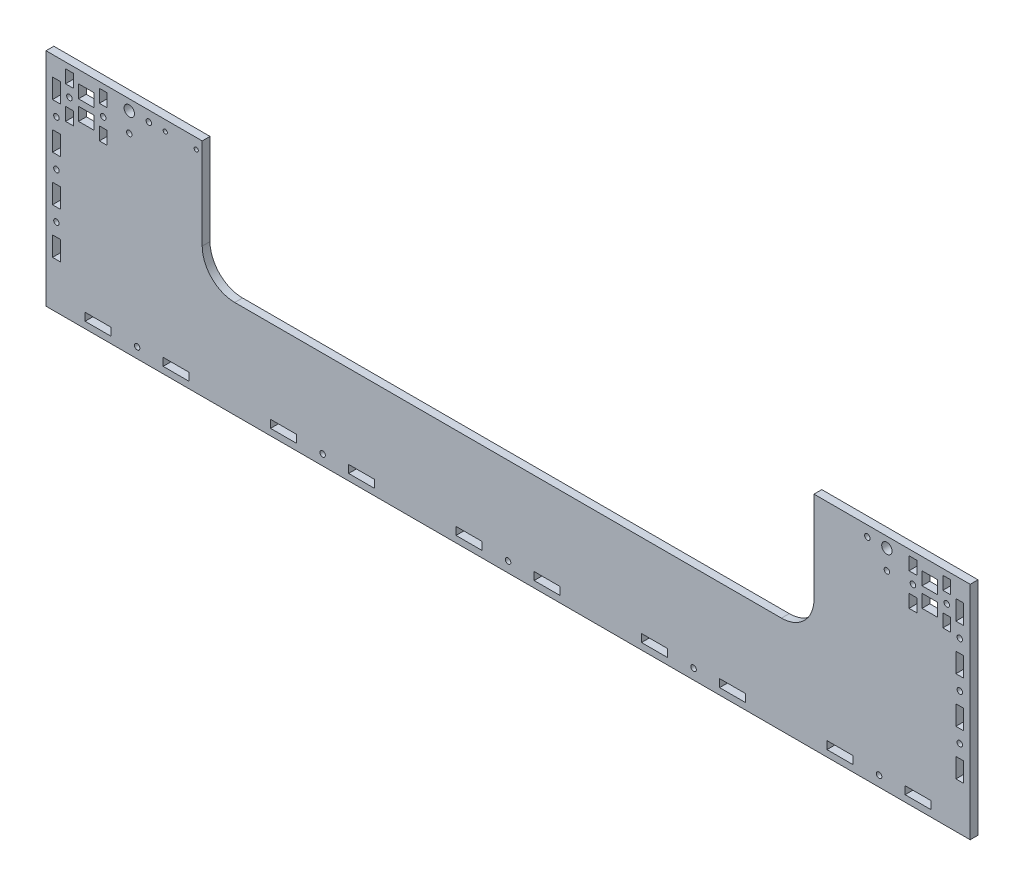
ISO-10303-21;
HEADER;
FILE_DESCRIPTION(('STEP AP214'),'2;1');
FILE_NAME('part.step','',(''),(''),'','','');
FILE_SCHEMA(('AUTOMOTIVE_DESIGN { 1 0 10303 214 1 1 1 1 }'));
ENDSEC;
DATA;
#1=APPLICATION_CONTEXT('core data for automotive mechanical design processes');
#2=APPLICATION_PROTOCOL_DEFINITION('international standard','automotive_design',2000,#1);
#3=PRODUCT_CONTEXT('',#1,'mechanical');
#4=PRODUCT('Part','Part','',(#3));
#5=PRODUCT_RELATED_PRODUCT_CATEGORY('part','',(#4));
#6=PRODUCT_DEFINITION_FORMATION('','',#4);
#7=PRODUCT_DEFINITION_CONTEXT('part definition',#1,'design');
#8=PRODUCT_DEFINITION('design','',#6,#7);
#9=PRODUCT_DEFINITION_SHAPE('','',#8);
#10=(LENGTH_UNIT() NAMED_UNIT(*) SI_UNIT(.MILLI.,.METRE.));
#11=(NAMED_UNIT(*) PLANE_ANGLE_UNIT() SI_UNIT($,.RADIAN.));
#12=(NAMED_UNIT(*) SI_UNIT($,.STERADIAN.) SOLID_ANGLE_UNIT());
#13=UNCERTAINTY_MEASURE_WITH_UNIT(LENGTH_MEASURE(1.E-05),#10,'distance_accuracy_value','');
#14=(GEOMETRIC_REPRESENTATION_CONTEXT(3) GLOBAL_UNCERTAINTY_ASSIGNED_CONTEXT((#13)) GLOBAL_UNIT_ASSIGNED_CONTEXT((#10,
#11,#12)) REPRESENTATION_CONTEXT('',''));
#15=CARTESIAN_POINT('',(0.,0.,0.));
#16=DIRECTION('',(0.,0.,1.));
#17=DIRECTION('',(1.,0.,0.));
#18=AXIS2_PLACEMENT_3D('',#15,#16,#17);
#19=CARTESIAN_POINT('',(-355.,170.,6.));
#20=DIRECTION('',(0.,-1.,0.));
#21=DIRECTION('',(1.,0.,0.));
#22=AXIS2_PLACEMENT_3D('',#19,#20,#21);
#23=PLANE('',#22);
#24=DIRECTION('',(-1.,0.,0.));
#25=VECTOR('',#24,1.);
#26=CARTESIAN_POINT('',(-355.,170.,6.));
#27=LINE('',#26,#25);
#28=CARTESIAN_POINT('',(-235.,170.,6.));
#29=VERTEX_POINT('',#28);
#30=CARTESIAN_POINT('',(-355.,170.,6.));
#31=VERTEX_POINT('',#30);
#32=EDGE_CURVE('E1971',#29,#31,#27,.T.);
#33=ORIENTED_EDGE('',*,*,#32,.F.);
#34=DIRECTION('',(0.,0.,1.));
#35=VECTOR('',#34,1.);
#36=CARTESIAN_POINT('',(-235.,170.,0.));
#37=LINE('',#36,#35);
#38=CARTESIAN_POINT('',(-235.,170.,0.));
#39=VERTEX_POINT('',#38);
#40=EDGE_CURVE('E1280',#39,#29,#37,.T.);
#41=ORIENTED_EDGE('',*,*,#40,.F.);
#42=DIRECTION('',(-1.,0.,0.));
#43=VECTOR('',#42,1.);
#44=CARTESIAN_POINT('',(-355.,170.,0.));
#45=LINE('',#44,#43);
#46=CARTESIAN_POINT('',(-355.,170.,0.));
#47=VERTEX_POINT('',#46);
#48=EDGE_CURVE('E1982',#39,#47,#45,.T.);
#49=ORIENTED_EDGE('',*,*,#48,.T.);
#50=DIRECTION('',(0.,0.,-1.));
#51=VECTOR('',#50,1.);
#52=CARTESIAN_POINT('',(-355.,170.,6.));
#53=LINE('',#52,#51);
#54=EDGE_CURVE('E1975',#31,#47,#53,.T.);
#55=ORIENTED_EDGE('',*,*,#54,.F.);
#56=EDGE_LOOP('',(#33,#41,#49,#55));
#57=FACE_BOUND('',#56,.T.);
#58=ADVANCED_FACE('F37',(#57),#23,.F.);
#59=CARTESIAN_POINT('',(0.,0.,6.));
#60=DIRECTION('',(0.,0.,1.));
#61=DIRECTION('',(1.,0.,0.));
#62=AXIS2_PLACEMENT_3D('',#59,#60,#61);
#63=PLANE('',#62);
#64=CARTESIAN_POINT('',(-263.4,162.,6.));
#65=DIRECTION('',(0.,0.,1.));
#66=DIRECTION('',(1.,0.,0.));
#67=AXIS2_PLACEMENT_3D('',#64,#65,#66);
#68=CIRCLE('',#67,1.59999999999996);
#69=CARTESIAN_POINT('',(-261.8,162.,6.));
#70=VERTEX_POINT('',#69);
#71=EDGE_CURVE('E3562',#70,#70,#68,.T.);
#72=ORIENTED_EDGE('',*,*,#71,.F.);
#73=EDGE_LOOP('',(#72));
#74=FACE_BOUND('',#73,.T.);
#75=CARTESIAN_POINT('',(-239.6,162.,6.));
#76=DIRECTION('',(0.,0.,1.));
#77=DIRECTION('',(1.,0.,0.));
#78=AXIS2_PLACEMENT_3D('',#75,#76,#77);
#79=CIRCLE('',#78,1.59999999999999);
#80=CARTESIAN_POINT('',(-238.,162.,6.));
#81=VERTEX_POINT('',#80);
#82=EDGE_CURVE('E858',#81,#81,#79,.T.);
#83=ORIENTED_EDGE('',*,*,#82,.F.);
#84=EDGE_LOOP('',(#83));
#85=FACE_BOUND('',#84,.T.);
#86=DIRECTION('',(-1.,0.,0.));
#87=VECTOR('',#86,1.);
#88=CARTESIAN_POINT('',(330.,160.5,6.));
#89=LINE('',#88,#87);
#90=CARTESIAN_POINT('',(330.,160.5,6.));
#91=VERTEX_POINT('',#90);
#92=CARTESIAN_POINT('',(318.,160.5,6.));
#93=VERTEX_POINT('',#92);
#94=EDGE_CURVE('E52',#91,#93,#89,.T.);
#95=ORIENTED_EDGE('',*,*,#94,.F.);
#96=DIRECTION('',(0.,1.,0.));
#97=VECTOR('',#96,1.);
#98=CARTESIAN_POINT('',(330.,160.5,6.));
#99=LINE('',#98,#97);
#100=CARTESIAN_POINT('',(330.,150.5,6.));
#101=VERTEX_POINT('',#100);
#102=EDGE_CURVE('E852',#101,#91,#99,.T.);
#103=ORIENTED_EDGE('',*,*,#102,.F.);
#104=DIRECTION('',(1.,0.,0.));
#105=VECTOR('',#104,1.);
#106=CARTESIAN_POINT('',(330.,150.5,6.));
#107=LINE('',#106,#105);
#108=CARTESIAN_POINT('',(318.,150.5,6.));
#109=VERTEX_POINT('',#108);
#110=EDGE_CURVE('E855',#109,#101,#107,.T.);
#111=ORIENTED_EDGE('',*,*,#110,.F.);
#112=DIRECTION('',(0.,-1.,0.));
#113=VECTOR('',#112,1.);
#114=CARTESIAN_POINT('',(318.,160.5,6.));
#115=LINE('',#114,#113);
#116=EDGE_CURVE('E864',#93,#109,#115,.T.);
#117=ORIENTED_EDGE('',*,*,#116,.F.);
#118=EDGE_LOOP('',(#95,#103,#111,#117));
#119=FACE_BOUND('',#118,.T.);
#120=DIRECTION('',(-1.,0.,0.));
#121=VECTOR('',#120,1.);
#122=CARTESIAN_POINT('',(330.,145.5,6.));
#123=LINE('',#122,#121);
#124=CARTESIAN_POINT('',(330.,145.5,6.));
#125=VERTEX_POINT('',#124);
#126=CARTESIAN_POINT('',(318.,145.5,6.));
#127=VERTEX_POINT('',#126);
#128=EDGE_CURVE('E871',#125,#127,#123,.T.);
#129=ORIENTED_EDGE('',*,*,#128,.F.);
#130=DIRECTION('',(0.,1.,0.));
#131=VECTOR('',#130,1.);
#132=CARTESIAN_POINT('',(330.,145.5,6.));
#133=LINE('',#132,#131);
#134=CARTESIAN_POINT('',(330.,135.5,6.));
#135=VERTEX_POINT('',#134);
#136=EDGE_CURVE('E879',#135,#125,#133,.T.);
#137=ORIENTED_EDGE('',*,*,#136,.F.);
#138=DIRECTION('',(1.,0.,0.));
#139=VECTOR('',#138,1.);
#140=CARTESIAN_POINT('',(330.,135.5,6.));
#141=LINE('',#140,#139);
#142=CARTESIAN_POINT('',(318.,135.5,6.));
#143=VERTEX_POINT('',#142);
#144=EDGE_CURVE('E893',#143,#135,#141,.T.);
#145=ORIENTED_EDGE('',*,*,#144,.F.);
#146=DIRECTION('',(0.,-1.,0.));
#147=VECTOR('',#146,1.);
#148=CARTESIAN_POINT('',(318.,145.5,6.));
#149=LINE('',#148,#147);
#150=EDGE_CURVE('E890',#127,#143,#149,.T.);
#151=ORIENTED_EDGE('',*,*,#150,.F.);
#152=EDGE_LOOP('',(#129,#137,#145,#151));
#153=FACE_BOUND('',#152,.T.);
#154=DIRECTION('',(-1.,0.,0.));
#155=VECTOR('',#154,1.);
#156=CARTESIAN_POINT('',(340.,165.5,6.));
#157=LINE('',#156,#155);
#158=CARTESIAN_POINT('',(340.,165.5,6.));
#159=VERTEX_POINT('',#158);
#160=CARTESIAN_POINT('',(334.,165.5,6.));
#161=VERTEX_POINT('',#160);
#162=EDGE_CURVE('E900',#159,#161,#157,.T.);
#163=ORIENTED_EDGE('',*,*,#162,.F.);
#164=DIRECTION('',(0.,1.,0.));
#165=VECTOR('',#164,1.);
#166=CARTESIAN_POINT('',(340.,165.5,6.));
#167=LINE('',#166,#165);
#168=CARTESIAN_POINT('',(340.,155.5,6.));
#169=VERTEX_POINT('',#168);
#170=EDGE_CURVE('E911',#169,#159,#167,.T.);
#171=ORIENTED_EDGE('',*,*,#170,.F.);
#172=DIRECTION('',(1.,0.,0.));
#173=VECTOR('',#172,1.);
#174=CARTESIAN_POINT('',(340.,155.5,6.));
#175=LINE('',#174,#173);
#176=CARTESIAN_POINT('',(334.,155.5,6.));
#177=VERTEX_POINT('',#176);
#178=EDGE_CURVE('E925',#177,#169,#175,.T.);
#179=ORIENTED_EDGE('',*,*,#178,.F.);
#180=DIRECTION('',(0.,-1.,0.));
#181=VECTOR('',#180,1.);
#182=CARTESIAN_POINT('',(334.,165.5,6.));
#183=LINE('',#182,#181);
#184=EDGE_CURVE('E922',#161,#177,#183,.T.);
#185=ORIENTED_EDGE('',*,*,#184,.F.);
#186=EDGE_LOOP('',(#163,#171,#179,#185));
#187=FACE_BOUND('',#186,.T.);
#188=DIRECTION('',(-1.,0.,0.));
#189=VECTOR('',#188,1.);
#190=CARTESIAN_POINT('',(340.,140.5,6.));
#191=LINE('',#190,#189);
#192=CARTESIAN_POINT('',(340.,140.5,6.));
#193=VERTEX_POINT('',#192);
#194=CARTESIAN_POINT('',(334.,140.5,6.));
#195=VERTEX_POINT('',#194);
#196=EDGE_CURVE('E932',#193,#195,#191,.T.);
#197=ORIENTED_EDGE('',*,*,#196,.F.);
#198=DIRECTION('',(0.,1.,0.));
#199=VECTOR('',#198,1.);
#200=CARTESIAN_POINT('',(340.,140.5,6.));
#201=LINE('',#200,#199);
#202=CARTESIAN_POINT('',(340.,130.5,6.));
#203=VERTEX_POINT('',#202);
#204=EDGE_CURVE('E943',#203,#193,#201,.T.);
#205=ORIENTED_EDGE('',*,*,#204,.F.);
#206=DIRECTION('',(1.,0.,0.));
#207=VECTOR('',#206,1.);
#208=CARTESIAN_POINT('',(340.,130.5,6.));
#209=LINE('',#208,#207);
#210=CARTESIAN_POINT('',(334.,130.5,6.));
#211=VERTEX_POINT('',#210);
#212=EDGE_CURVE('E957',#211,#203,#209,.T.);
#213=ORIENTED_EDGE('',*,*,#212,.F.);
#214=DIRECTION('',(0.,-1.,0.));
#215=VECTOR('',#214,1.);
#216=CARTESIAN_POINT('',(334.,140.5,6.));
#217=LINE('',#216,#215);
#218=EDGE_CURVE('E954',#195,#211,#217,.T.);
#219=ORIENTED_EDGE('',*,*,#218,.F.);
#220=EDGE_LOOP('',(#197,#205,#213,#219));
#221=FACE_BOUND('',#220,.T.);
#222=DIRECTION('',(-1.,0.,0.));
#223=VECTOR('',#222,1.);
#224=CARTESIAN_POINT('',(314.,165.5,6.));
#225=LINE('',#224,#223);
#226=CARTESIAN_POINT('',(314.,165.5,6.));
#227=VERTEX_POINT('',#226);
#228=CARTESIAN_POINT('',(308.,165.5,6.));
#229=VERTEX_POINT('',#228);
#230=EDGE_CURVE('E964',#227,#229,#225,.T.);
#231=ORIENTED_EDGE('',*,*,#230,.F.);
#232=DIRECTION('',(0.,1.,0.));
#233=VECTOR('',#232,1.);
#234=CARTESIAN_POINT('',(314.,165.5,6.));
#235=LINE('',#234,#233);
#236=CARTESIAN_POINT('',(314.,155.5,6.));
#237=VERTEX_POINT('',#236);
#238=EDGE_CURVE('E975',#237,#227,#235,.T.);
#239=ORIENTED_EDGE('',*,*,#238,.F.);
#240=DIRECTION('',(1.,0.,0.));
#241=VECTOR('',#240,1.);
#242=CARTESIAN_POINT('',(314.,155.5,6.));
#243=LINE('',#242,#241);
#244=CARTESIAN_POINT('',(308.,155.5,6.));
#245=VERTEX_POINT('',#244);
#246=EDGE_CURVE('E989',#245,#237,#243,.T.);
#247=ORIENTED_EDGE('',*,*,#246,.F.);
#248=DIRECTION('',(0.,-1.,0.));
#249=VECTOR('',#248,1.);
#250=CARTESIAN_POINT('',(308.,165.5,6.));
#251=LINE('',#250,#249);
#252=EDGE_CURVE('E986',#229,#245,#251,.T.);
#253=ORIENTED_EDGE('',*,*,#252,.F.);
#254=EDGE_LOOP('',(#231,#239,#247,#253));
#255=FACE_BOUND('',#254,.T.);
#256=DIRECTION('',(-1.,0.,0.));
#257=VECTOR('',#256,1.);
#258=CARTESIAN_POINT('',(314.,140.5,6.));
#259=LINE('',#258,#257);
#260=CARTESIAN_POINT('',(314.,140.5,6.));
#261=VERTEX_POINT('',#260);
#262=CARTESIAN_POINT('',(308.,140.5,6.));
#263=VERTEX_POINT('',#262);
#264=EDGE_CURVE('E996',#261,#263,#259,.T.);
#265=ORIENTED_EDGE('',*,*,#264,.F.);
#266=DIRECTION('',(0.,1.,0.));
#267=VECTOR('',#266,1.);
#268=CARTESIAN_POINT('',(314.,140.5,6.));
#269=LINE('',#268,#267);
#270=CARTESIAN_POINT('',(314.,130.5,6.));
#271=VERTEX_POINT('',#270);
#272=EDGE_CURVE('E1007',#271,#261,#269,.T.);
#273=ORIENTED_EDGE('',*,*,#272,.F.);
#274=DIRECTION('',(1.,0.,0.));
#275=VECTOR('',#274,1.);
#276=CARTESIAN_POINT('',(314.,130.5,6.));
#277=LINE('',#276,#275);
#278=CARTESIAN_POINT('',(308.,130.5,6.));
#279=VERTEX_POINT('',#278);
#280=EDGE_CURVE('E1021',#279,#271,#277,.T.);
#281=ORIENTED_EDGE('',*,*,#280,.F.);
#282=DIRECTION('',(0.,-1.,0.));
#283=VECTOR('',#282,1.);
#284=CARTESIAN_POINT('',(308.,140.5,6.));
#285=LINE('',#284,#283);
#286=EDGE_CURVE('E1018',#263,#279,#285,.T.);
#287=ORIENTED_EDGE('',*,*,#286,.F.);
#288=EDGE_LOOP('',(#265,#273,#281,#287));
#289=FACE_BOUND('',#288,.T.);
#290=CARTESIAN_POINT('',(337.,148.,6.));
#291=DIRECTION('',(0.,0.,1.));
#292=DIRECTION('',(-1.,0.,0.));
#293=AXIS2_PLACEMENT_3D('',#290,#291,#292);
#294=CIRCLE('',#293,2.09999999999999);
#295=CARTESIAN_POINT('',(334.9,148.,6.));
#296=VERTEX_POINT('',#295);
#297=EDGE_CURVE('E1028',#296,#296,#294,.T.);
#298=ORIENTED_EDGE('',*,*,#297,.F.);
#299=EDGE_LOOP('',(#298));
#300=FACE_BOUND('',#299,.T.);
#301=CARTESIAN_POINT('',(311.,148.,6.));
#302=DIRECTION('',(0.,0.,1.));
#303=DIRECTION('',(-1.,0.,0.));
#304=AXIS2_PLACEMENT_3D('',#301,#302,#303);
#305=CIRCLE('',#304,2.09999999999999);
#306=CARTESIAN_POINT('',(308.9,148.,6.));
#307=VERTEX_POINT('',#306);
#308=EDGE_CURVE('E1038',#307,#307,#305,.T.);
#309=ORIENTED_EDGE('',*,*,#308,.F.);
#310=EDGE_LOOP('',(#309));
#311=FACE_BOUND('',#310,.T.);
#312=CARTESIAN_POINT('',(-311.,148.,6.));
#313=DIRECTION('',(0.,0.,1.));
#314=DIRECTION('',(1.,0.,0.));
#315=AXIS2_PLACEMENT_3D('',#312,#313,#314);
#316=CIRCLE('',#315,2.09999999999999);
#317=CARTESIAN_POINT('',(-308.9,148.,6.));
#318=VERTEX_POINT('',#317);
#319=EDGE_CURVE('E1044',#318,#318,#316,.T.);
#320=ORIENTED_EDGE('',*,*,#319,.F.);
#321=EDGE_LOOP('',(#320));
#322=FACE_BOUND('',#321,.T.);
#323=CARTESIAN_POINT('',(-337.,148.,6.));
#324=DIRECTION('',(0.,0.,1.));
#325=DIRECTION('',(1.,0.,0.));
#326=AXIS2_PLACEMENT_3D('',#323,#324,#325);
#327=CIRCLE('',#326,2.09999999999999);
#328=CARTESIAN_POINT('',(-334.9,148.,6.));
#329=VERTEX_POINT('',#328);
#330=EDGE_CURVE('E1050',#329,#329,#327,.T.);
#331=ORIENTED_EDGE('',*,*,#330,.F.);
#332=EDGE_LOOP('',(#331));
#333=FACE_BOUND('',#332,.T.);
#334=DIRECTION('',(0.,-1.,0.));
#335=VECTOR('',#334,1.);
#336=CARTESIAN_POINT('',(-314.,140.5,6.));
#337=LINE('',#336,#335);
#338=CARTESIAN_POINT('',(-314.,140.5,6.));
#339=VERTEX_POINT('',#338);
#340=CARTESIAN_POINT('',(-314.,130.5,6.));
#341=VERTEX_POINT('',#340);
#342=EDGE_CURVE('E1056',#339,#341,#337,.T.);
#343=ORIENTED_EDGE('',*,*,#342,.F.);
#344=DIRECTION('',(-1.,0.,0.));
#345=VECTOR('',#344,1.);
#346=CARTESIAN_POINT('',(-314.,140.5,6.));
#347=LINE('',#346,#345);
#348=CARTESIAN_POINT('',(-308.,140.5,6.));
#349=VERTEX_POINT('',#348);
#350=EDGE_CURVE('E1063',#349,#339,#347,.T.);
#351=ORIENTED_EDGE('',*,*,#350,.F.);
#352=DIRECTION('',(0.,1.,0.));
#353=VECTOR('',#352,1.);
#354=CARTESIAN_POINT('',(-308.,140.5,6.));
#355=LINE('',#354,#353);
#356=CARTESIAN_POINT('',(-308.,130.5,6.));
#357=VERTEX_POINT('',#356);
#358=EDGE_CURVE('E1077',#357,#349,#355,.T.);
#359=ORIENTED_EDGE('',*,*,#358,.F.);
#360=DIRECTION('',(1.,0.,0.));
#361=VECTOR('',#360,1.);
#362=CARTESIAN_POINT('',(-314.,130.5,6.));
#363=LINE('',#362,#361);
#364=EDGE_CURVE('E1074',#341,#357,#363,.T.);
#365=ORIENTED_EDGE('',*,*,#364,.F.);
#366=EDGE_LOOP('',(#343,#351,#359,#365));
#367=FACE_BOUND('',#366,.T.);
#368=DIRECTION('',(0.,-1.,0.));
#369=VECTOR('',#368,1.);
#370=CARTESIAN_POINT('',(-314.,165.5,6.));
#371=LINE('',#370,#369);
#372=CARTESIAN_POINT('',(-314.,165.5,6.));
#373=VERTEX_POINT('',#372);
#374=CARTESIAN_POINT('',(-314.,155.5,6.));
#375=VERTEX_POINT('',#374);
#376=EDGE_CURVE('E1084',#373,#375,#371,.T.);
#377=ORIENTED_EDGE('',*,*,#376,.F.);
#378=DIRECTION('',(-1.,0.,0.));
#379=VECTOR('',#378,1.);
#380=CARTESIAN_POINT('',(-314.,165.5,6.));
#381=LINE('',#380,#379);
#382=CARTESIAN_POINT('',(-308.,165.5,6.));
#383=VERTEX_POINT('',#382);
#384=EDGE_CURVE('E1095',#383,#373,#381,.T.);
#385=ORIENTED_EDGE('',*,*,#384,.F.);
#386=DIRECTION('',(0.,1.,0.));
#387=VECTOR('',#386,1.);
#388=CARTESIAN_POINT('',(-308.,165.5,6.));
#389=LINE('',#388,#387);
#390=CARTESIAN_POINT('',(-308.,155.5,6.));
#391=VERTEX_POINT('',#390);
#392=EDGE_CURVE('E1109',#391,#383,#389,.T.);
#393=ORIENTED_EDGE('',*,*,#392,.F.);
#394=DIRECTION('',(1.,0.,0.));
#395=VECTOR('',#394,1.);
#396=CARTESIAN_POINT('',(-314.,155.5,6.));
#397=LINE('',#396,#395);
#398=EDGE_CURVE('E1106',#375,#391,#397,.T.);
#399=ORIENTED_EDGE('',*,*,#398,.F.);
#400=EDGE_LOOP('',(#377,#385,#393,#399));
#401=FACE_BOUND('',#400,.T.);
#402=DIRECTION('',(0.,-1.,0.));
#403=VECTOR('',#402,1.);
#404=CARTESIAN_POINT('',(-340.,140.5,6.));
#405=LINE('',#404,#403);
#406=CARTESIAN_POINT('',(-340.,140.5,6.));
#407=VERTEX_POINT('',#406);
#408=CARTESIAN_POINT('',(-340.,130.5,6.));
#409=VERTEX_POINT('',#408);
#410=EDGE_CURVE('E1116',#407,#409,#405,.T.);
#411=ORIENTED_EDGE('',*,*,#410,.F.);
#412=DIRECTION('',(-1.,0.,0.));
#413=VECTOR('',#412,1.);
#414=CARTESIAN_POINT('',(-340.,140.5,6.));
#415=LINE('',#414,#413);
#416=CARTESIAN_POINT('',(-334.,140.5,6.));
#417=VERTEX_POINT('',#416);
#418=EDGE_CURVE('E1127',#417,#407,#415,.T.);
#419=ORIENTED_EDGE('',*,*,#418,.F.);
#420=DIRECTION('',(0.,1.,0.));
#421=VECTOR('',#420,1.);
#422=CARTESIAN_POINT('',(-334.,140.5,6.));
#423=LINE('',#422,#421);
#424=CARTESIAN_POINT('',(-334.,130.5,6.));
#425=VERTEX_POINT('',#424);
#426=EDGE_CURVE('E1141',#425,#417,#423,.T.);
#427=ORIENTED_EDGE('',*,*,#426,.F.);
#428=DIRECTION('',(1.,0.,0.));
#429=VECTOR('',#428,1.);
#430=CARTESIAN_POINT('',(-340.,130.5,6.));
#431=LINE('',#430,#429);
#432=EDGE_CURVE('E1138',#409,#425,#431,.T.);
#433=ORIENTED_EDGE('',*,*,#432,.F.);
#434=EDGE_LOOP('',(#411,#419,#427,#433));
#435=FACE_BOUND('',#434,.T.);
#436=DIRECTION('',(0.,-1.,0.));
#437=VECTOR('',#436,1.);
#438=CARTESIAN_POINT('',(-340.,165.5,6.));
#439=LINE('',#438,#437);
#440=CARTESIAN_POINT('',(-340.,165.5,6.));
#441=VERTEX_POINT('',#440);
#442=CARTESIAN_POINT('',(-340.,155.5,6.));
#443=VERTEX_POINT('',#442);
#444=EDGE_CURVE('E1148',#441,#443,#439,.T.);
#445=ORIENTED_EDGE('',*,*,#444,.F.);
#446=DIRECTION('',(-1.,0.,0.));
#447=VECTOR('',#446,1.);
#448=CARTESIAN_POINT('',(-340.,165.5,6.));
#449=LINE('',#448,#447);
#450=CARTESIAN_POINT('',(-334.,165.5,6.));
#451=VERTEX_POINT('',#450);
#452=EDGE_CURVE('E1159',#451,#441,#449,.T.);
#453=ORIENTED_EDGE('',*,*,#452,.F.);
#454=DIRECTION('',(0.,1.,0.));
#455=VECTOR('',#454,1.);
#456=CARTESIAN_POINT('',(-334.,165.5,6.));
#457=LINE('',#456,#455);
#458=CARTESIAN_POINT('',(-334.,155.5,6.));
#459=VERTEX_POINT('',#458);
#460=EDGE_CURVE('E1173',#459,#451,#457,.T.);
#461=ORIENTED_EDGE('',*,*,#460,.F.);
#462=DIRECTION('',(1.,0.,0.));
#463=VECTOR('',#462,1.);
#464=CARTESIAN_POINT('',(-340.,155.5,6.));
#465=LINE('',#464,#463);
#466=EDGE_CURVE('E1170',#443,#459,#465,.T.);
#467=ORIENTED_EDGE('',*,*,#466,.F.);
#468=EDGE_LOOP('',(#445,#453,#461,#467));
#469=FACE_BOUND('',#468,.T.);
#470=DIRECTION('',(0.,-1.,0.));
#471=VECTOR('',#470,1.);
#472=CARTESIAN_POINT('',(-330.,145.5,6.));
#473=LINE('',#472,#471);
#474=CARTESIAN_POINT('',(-330.,145.5,6.));
#475=VERTEX_POINT('',#474);
#476=CARTESIAN_POINT('',(-330.,135.5,6.));
#477=VERTEX_POINT('',#476);
#478=EDGE_CURVE('E1180',#475,#477,#473,.T.);
#479=ORIENTED_EDGE('',*,*,#478,.F.);
#480=DIRECTION('',(-1.,0.,0.));
#481=VECTOR('',#480,1.);
#482=CARTESIAN_POINT('',(-330.,145.5,6.));
#483=LINE('',#482,#481);
#484=CARTESIAN_POINT('',(-318.,145.5,6.));
#485=VERTEX_POINT('',#484);
#486=EDGE_CURVE('E1191',#485,#475,#483,.T.);
#487=ORIENTED_EDGE('',*,*,#486,.F.);
#488=DIRECTION('',(0.,1.,0.));
#489=VECTOR('',#488,1.);
#490=CARTESIAN_POINT('',(-318.,145.5,6.));
#491=LINE('',#490,#489);
#492=CARTESIAN_POINT('',(-318.,135.5,6.));
#493=VERTEX_POINT('',#492);
#494=EDGE_CURVE('E1205',#493,#485,#491,.T.);
#495=ORIENTED_EDGE('',*,*,#494,.F.);
#496=DIRECTION('',(1.,0.,0.));
#497=VECTOR('',#496,1.);
#498=CARTESIAN_POINT('',(-330.,135.5,6.));
#499=LINE('',#498,#497);
#500=EDGE_CURVE('E1202',#477,#493,#499,.T.);
#501=ORIENTED_EDGE('',*,*,#500,.F.);
#502=EDGE_LOOP('',(#479,#487,#495,#501));
#503=FACE_BOUND('',#502,.T.);
#504=DIRECTION('',(0.,-1.,0.));
#505=VECTOR('',#504,1.);
#506=CARTESIAN_POINT('',(-330.,160.5,6.));
#507=LINE('',#506,#505);
#508=CARTESIAN_POINT('',(-330.,160.5,6.));
#509=VERTEX_POINT('',#508);
#510=CARTESIAN_POINT('',(-330.,150.5,6.));
#511=VERTEX_POINT('',#510);
#512=EDGE_CURVE('E1212',#509,#511,#507,.T.);
#513=ORIENTED_EDGE('',*,*,#512,.F.);
#514=DIRECTION('',(-1.,0.,0.));
#515=VECTOR('',#514,1.);
#516=CARTESIAN_POINT('',(-330.,160.5,6.));
#517=LINE('',#516,#515);
#518=CARTESIAN_POINT('',(-318.,160.5,6.));
#519=VERTEX_POINT('',#518);
#520=EDGE_CURVE('E1223',#519,#509,#517,.T.);
#521=ORIENTED_EDGE('',*,*,#520,.F.);
#522=DIRECTION('',(0.,1.,0.));
#523=VECTOR('',#522,1.);
#524=CARTESIAN_POINT('',(-318.,160.5,6.));
#525=LINE('',#524,#523);
#526=CARTESIAN_POINT('',(-318.,150.5,6.));
#527=VERTEX_POINT('',#526);
#528=EDGE_CURVE('E1237',#527,#519,#525,.T.);
#529=ORIENTED_EDGE('',*,*,#528,.F.);
#530=DIRECTION('',(1.,0.,0.));
#531=VECTOR('',#530,1.);
#532=CARTESIAN_POINT('',(-330.,150.5,6.));
#533=LINE('',#532,#531);
#534=EDGE_CURVE('E1234',#511,#527,#533,.T.);
#535=ORIENTED_EDGE('',*,*,#534,.F.);
#536=EDGE_LOOP('',(#513,#521,#529,#535));
#537=FACE_BOUND('',#536,.T.);
#538=DIRECTION('',(0.,-1.,0.));
#539=VECTOR('',#538,1.);
#540=CARTESIAN_POINT('',(-235.,170.,6.));
#541=LINE('',#540,#539);
#542=CARTESIAN_POINT('',(-235.,100.,6.));
#543=VERTEX_POINT('',#542);
#544=EDGE_CURVE('E1244',#29,#543,#541,.T.);
#545=ORIENTED_EDGE('',*,*,#544,.F.);
#546=ORIENTED_EDGE('',*,*,#32,.T.);
#547=DIRECTION('',(0.,-1.,0.));
#548=VECTOR('',#547,1.);
#549=CARTESIAN_POINT('',(-355.,170.,6.));
#550=LINE('',#549,#548);
#551=CARTESIAN_POINT('',(-355.,0.,6.));
#552=VERTEX_POINT('',#551);
#553=EDGE_CURVE('E1963',#31,#552,#550,.T.);
#554=ORIENTED_EDGE('',*,*,#553,.T.);
#555=DIRECTION('',(1.,0.,0.));
#556=VECTOR('',#555,1.);
#557=CARTESIAN_POINT('',(-355.,0.,6.));
#558=LINE('',#557,#556);
#559=CARTESIAN_POINT('',(355.,1.30424884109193E-13,6.));
#560=VERTEX_POINT('',#559);
#561=EDGE_CURVE('E1966',#552,#560,#558,.T.);
#562=ORIENTED_EDGE('',*,*,#561,.T.);
#563=DIRECTION('',(0.,1.,0.));
#564=VECTOR('',#563,1.);
#565=CARTESIAN_POINT('',(355.,170.,6.));
#566=LINE('',#565,#564);
#567=CARTESIAN_POINT('',(355.,170.,6.));
#568=VERTEX_POINT('',#567);
#569=EDGE_CURVE('E1969',#560,#568,#566,.T.);
#570=ORIENTED_EDGE('',*,*,#569,.T.);
#571=CARTESIAN_POINT('',(235.,170.,6.));
#572=VERTEX_POINT('',#571);
#573=EDGE_CURVE('E1972',#568,#572,#27,.T.);
#574=ORIENTED_EDGE('',*,*,#573,.T.);
#575=DIRECTION('',(0.,1.,0.));
#576=VECTOR('',#575,1.);
#577=CARTESIAN_POINT('',(235.,170.,6.));
#578=LINE('',#577,#576);
#579=CARTESIAN_POINT('',(235.,100.,6.));
#580=VERTEX_POINT('',#579);
#581=EDGE_CURVE('E1255',#580,#572,#578,.T.);
#582=ORIENTED_EDGE('',*,*,#581,.F.);
#583=CARTESIAN_POINT('',(210.,100.,6.));
#584=DIRECTION('',(0.,0.,1.));
#585=DIRECTION('',(1.,0.,0.));
#586=AXIS2_PLACEMENT_3D('',#583,#584,#585);
#587=CIRCLE('',#586,25.);
#588=CARTESIAN_POINT('',(210.,75.0000000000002,6.));
#589=VERTEX_POINT('',#588);
#590=EDGE_CURVE('E1276',#589,#580,#587,.T.);
#591=ORIENTED_EDGE('',*,*,#590,.F.);
#592=DIRECTION('',(1.,0.,0.));
#593=VECTOR('',#592,1.);
#594=CARTESIAN_POINT('',(-210.,75.0000000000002,6.));
#595=LINE('',#594,#593);
#596=CARTESIAN_POINT('',(-210.,75.0000000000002,6.));
#597=VERTEX_POINT('',#596);
#598=EDGE_CURVE('E1273',#597,#589,#595,.T.);
#599=ORIENTED_EDGE('',*,*,#598,.F.);
#600=CARTESIAN_POINT('',(-210.,100.,6.));
#601=DIRECTION('',(0.,0.,1.));
#602=DIRECTION('',(1.,0.,0.));
#603=AXIS2_PLACEMENT_3D('',#600,#601,#602);
#604=CIRCLE('',#603,25.);
#605=EDGE_CURVE('E1270',#543,#597,#604,.T.);
#606=ORIENTED_EDGE('',*,*,#605,.F.);
#607=EDGE_LOOP('',(#545,#546,#554,#562,#570,#574,#582,#591,#599,#606));
#608=FACE_BOUND('',#607,.T.);
#609=CARTESIAN_POINT('',(291.,162.,6.));
#610=DIRECTION('',(0.,0.,1.));
#611=DIRECTION('',(-1.,0.,0.));
#612=AXIS2_PLACEMENT_3D('',#609,#610,#611);
#613=CIRCLE('',#612,3.99999999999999);
#614=CARTESIAN_POINT('',(287.,162.,6.));
#615=VERTEX_POINT('',#614);
#616=EDGE_CURVE('E1282',#615,#615,#613,.T.);
#617=ORIENTED_EDGE('',*,*,#616,.F.);
#618=EDGE_LOOP('',(#617));
#619=FACE_BOUND('',#618,.T.);
#620=CARTESIAN_POINT('',(291.,147.,6.));
#621=DIRECTION('',(0.,0.,1.));
#622=DIRECTION('',(-1.,0.,0.));
#623=AXIS2_PLACEMENT_3D('',#620,#621,#622);
#624=CIRCLE('',#623,2.09999999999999);
#625=CARTESIAN_POINT('',(288.9,147.,6.));
#626=VERTEX_POINT('',#625);
#627=EDGE_CURVE('E1296',#626,#626,#624,.T.);
#628=ORIENTED_EDGE('',*,*,#627,.F.);
#629=EDGE_LOOP('',(#628));
#630=FACE_BOUND('',#629,.T.);
#631=CARTESIAN_POINT('',(276.,162.,6.));
#632=DIRECTION('',(0.,0.,1.));
#633=DIRECTION('',(-1.,0.,0.));
#634=AXIS2_PLACEMENT_3D('',#631,#632,#633);
#635=CIRCLE('',#634,2.09999999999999);
#636=CARTESIAN_POINT('',(273.9,162.,6.));
#637=VERTEX_POINT('',#636);
#638=EDGE_CURVE('E1302',#637,#637,#635,.T.);
#639=ORIENTED_EDGE('',*,*,#638,.F.);
#640=EDGE_LOOP('',(#639));
#641=FACE_BOUND('',#640,.T.);
#642=CARTESIAN_POINT('',(-276.,162.,6.));
#643=DIRECTION('',(0.,0.,1.));
#644=DIRECTION('',(1.,0.,0.));
#645=AXIS2_PLACEMENT_3D('',#642,#643,#644);
#646=CIRCLE('',#645,2.09999999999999);
#647=CARTESIAN_POINT('',(-273.9,162.,6.));
#648=VERTEX_POINT('',#647);
#649=EDGE_CURVE('E1308',#648,#648,#646,.T.);
#650=ORIENTED_EDGE('',*,*,#649,.F.);
#651=EDGE_LOOP('',(#650));
#652=FACE_BOUND('',#651,.T.);
#653=CARTESIAN_POINT('',(-291.,147.,6.));
#654=DIRECTION('',(0.,0.,1.));
#655=DIRECTION('',(1.,0.,0.));
#656=AXIS2_PLACEMENT_3D('',#653,#654,#655);
#657=CIRCLE('',#656,2.09999999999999);
#658=CARTESIAN_POINT('',(-288.9,147.,6.));
#659=VERTEX_POINT('',#658);
#660=EDGE_CURVE('E1314',#659,#659,#657,.T.);
#661=ORIENTED_EDGE('',*,*,#660,.F.);
#662=EDGE_LOOP('',(#661));
#663=FACE_BOUND('',#662,.T.);
#664=CARTESIAN_POINT('',(-291.,162.,6.));
#665=DIRECTION('',(0.,0.,1.));
#666=DIRECTION('',(1.,0.,0.));
#667=AXIS2_PLACEMENT_3D('',#664,#665,#666);
#668=CIRCLE('',#667,3.99999999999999);
#669=CARTESIAN_POINT('',(-287.,162.,6.));
#670=VERTEX_POINT('',#669);
#671=EDGE_CURVE('E1320',#670,#670,#668,.T.);
#672=ORIENTED_EDGE('',*,*,#671,.F.);
#673=EDGE_LOOP('',(#672));
#674=FACE_BOUND('',#673,.T.);
#675=DIRECTION('',(-1.,0.,0.));
#676=VECTOR('',#675,1.);
#677=CARTESIAN_POINT('',(325.,11.,6.));
#678=LINE('',#677,#676);
#679=CARTESIAN_POINT('',(325.,11.,6.));
#680=VERTEX_POINT('',#679);
#681=CARTESIAN_POINT('',(305.,11.,6.));
#682=VERTEX_POINT('',#681);
#683=EDGE_CURVE('E1326',#680,#682,#678,.T.);
#684=ORIENTED_EDGE('',*,*,#683,.F.);
#685=DIRECTION('',(0.,1.,0.));
#686=VECTOR('',#685,1.);
#687=CARTESIAN_POINT('',(325.,11.,6.));
#688=LINE('',#687,#686);
#689=CARTESIAN_POINT('',(325.,5.,6.));
#690=VERTEX_POINT('',#689);
#691=EDGE_CURVE('E1333',#690,#680,#688,.T.);
#692=ORIENTED_EDGE('',*,*,#691,.F.);
#693=DIRECTION('',(1.,0.,0.));
#694=VECTOR('',#693,1.);
#695=CARTESIAN_POINT('',(325.,5.,6.));
#696=LINE('',#695,#694);
#697=CARTESIAN_POINT('',(305.,5.,6.));
#698=VERTEX_POINT('',#697);
#699=EDGE_CURVE('E1347',#698,#690,#696,.T.);
#700=ORIENTED_EDGE('',*,*,#699,.F.);
#701=DIRECTION('',(0.,-1.,0.));
#702=VECTOR('',#701,1.);
#703=CARTESIAN_POINT('',(305.,11.,6.));
#704=LINE('',#703,#702);
#705=EDGE_CURVE('E1344',#682,#698,#704,.T.);
#706=ORIENTED_EDGE('',*,*,#705,.F.);
#707=EDGE_LOOP('',(#684,#692,#700,#706));
#708=FACE_BOUND('',#707,.T.);
#709=DIRECTION('',(-1.,0.,0.));
#710=VECTOR('',#709,1.);
#711=CARTESIAN_POINT('',(265.,11.,6.));
#712=LINE('',#711,#710);
#713=CARTESIAN_POINT('',(265.,11.,6.));
#714=VERTEX_POINT('',#713);
#715=CARTESIAN_POINT('',(245.,11.,6.));
#716=VERTEX_POINT('',#715);
#717=EDGE_CURVE('E1354',#714,#716,#712,.T.);
#718=ORIENTED_EDGE('',*,*,#717,.F.);
#719=DIRECTION('',(0.,1.,0.));
#720=VECTOR('',#719,1.);
#721=CARTESIAN_POINT('',(265.,11.,6.));
#722=LINE('',#721,#720);
#723=CARTESIAN_POINT('',(265.,5.00000000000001,6.));
#724=VERTEX_POINT('',#723);
#725=EDGE_CURVE('E1365',#724,#714,#722,.T.);
#726=ORIENTED_EDGE('',*,*,#725,.F.);
#727=DIRECTION('',(1.,0.,0.));
#728=VECTOR('',#727,1.);
#729=CARTESIAN_POINT('',(265.,5.00000000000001,6.));
#730=LINE('',#729,#728);
#731=CARTESIAN_POINT('',(245.,5.00000000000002,6.));
#732=VERTEX_POINT('',#731);
#733=EDGE_CURVE('E1379',#732,#724,#730,.T.);
#734=ORIENTED_EDGE('',*,*,#733,.F.);
#735=DIRECTION('',(0.,-1.,0.));
#736=VECTOR('',#735,1.);
#737=CARTESIAN_POINT('',(245.,11.,6.));
#738=LINE('',#737,#736);
#739=EDGE_CURVE('E1376',#716,#732,#738,.T.);
#740=ORIENTED_EDGE('',*,*,#739,.F.);
#741=EDGE_LOOP('',(#718,#726,#734,#740));
#742=FACE_BOUND('',#741,.T.);
#743=DIRECTION('',(-1.,0.,0.));
#744=VECTOR('',#743,1.);
#745=CARTESIAN_POINT('',(182.5,11.,6.));
#746=LINE('',#745,#744);
#747=CARTESIAN_POINT('',(182.5,11.,6.));
#748=VERTEX_POINT('',#747);
#749=CARTESIAN_POINT('',(162.5,11.,6.));
#750=VERTEX_POINT('',#749);
#751=EDGE_CURVE('E1386',#748,#750,#746,.T.);
#752=ORIENTED_EDGE('',*,*,#751,.F.);
#753=DIRECTION('',(0.,1.,0.));
#754=VECTOR('',#753,1.);
#755=CARTESIAN_POINT('',(182.5,11.,6.));
#756=LINE('',#755,#754);
#757=CARTESIAN_POINT('',(182.5,5.,6.));
#758=VERTEX_POINT('',#757);
#759=EDGE_CURVE('E1397',#758,#748,#756,.T.);
#760=ORIENTED_EDGE('',*,*,#759,.F.);
#761=DIRECTION('',(1.,0.,0.));
#762=VECTOR('',#761,1.);
#763=CARTESIAN_POINT('',(182.5,5.,6.));
#764=LINE('',#763,#762);
#765=CARTESIAN_POINT('',(162.5,5.,6.));
#766=VERTEX_POINT('',#765);
#767=EDGE_CURVE('E1411',#766,#758,#764,.T.);
#768=ORIENTED_EDGE('',*,*,#767,.F.);
#769=DIRECTION('',(0.,-1.,0.));
#770=VECTOR('',#769,1.);
#771=CARTESIAN_POINT('',(162.5,11.,6.));
#772=LINE('',#771,#770);
#773=EDGE_CURVE('E1408',#750,#766,#772,.T.);
#774=ORIENTED_EDGE('',*,*,#773,.F.);
#775=EDGE_LOOP('',(#752,#760,#768,#774));
#776=FACE_BOUND('',#775,.T.);
#777=DIRECTION('',(-1.,0.,0.));
#778=VECTOR('',#777,1.);
#779=CARTESIAN_POINT('',(122.5,11.,6.));
#780=LINE('',#779,#778);
#781=CARTESIAN_POINT('',(122.5,11.,6.));
#782=VERTEX_POINT('',#781);
#783=CARTESIAN_POINT('',(102.5,11.,6.));
#784=VERTEX_POINT('',#783);
#785=EDGE_CURVE('E1418',#782,#784,#780,.T.);
#786=ORIENTED_EDGE('',*,*,#785,.F.);
#787=DIRECTION('',(0.,1.,0.));
#788=VECTOR('',#787,1.);
#789=CARTESIAN_POINT('',(122.5,11.,6.));
#790=LINE('',#789,#788);
#791=CARTESIAN_POINT('',(122.5,5.,6.));
#792=VERTEX_POINT('',#791);
#793=EDGE_CURVE('E1429',#792,#782,#790,.T.);
#794=ORIENTED_EDGE('',*,*,#793,.F.);
#795=DIRECTION('',(1.,0.,0.));
#796=VECTOR('',#795,1.);
#797=CARTESIAN_POINT('',(122.5,5.,6.));
#798=LINE('',#797,#796);
#799=CARTESIAN_POINT('',(102.5,5.,6.));
#800=VERTEX_POINT('',#799);
#801=EDGE_CURVE('E1443',#800,#792,#798,.T.);
#802=ORIENTED_EDGE('',*,*,#801,.F.);
#803=DIRECTION('',(0.,-1.,0.));
#804=VECTOR('',#803,1.);
#805=CARTESIAN_POINT('',(102.5,11.,6.));
#806=LINE('',#805,#804);
#807=EDGE_CURVE('E1440',#784,#800,#806,.T.);
#808=ORIENTED_EDGE('',*,*,#807,.F.);
#809=EDGE_LOOP('',(#786,#794,#802,#808));
#810=FACE_BOUND('',#809,.T.);
#811=DIRECTION('',(-1.,0.,0.));
#812=VECTOR('',#811,1.);
#813=CARTESIAN_POINT('',(40.,11.,6.));
#814=LINE('',#813,#812);
#815=CARTESIAN_POINT('',(40.,11.,6.));
#816=VERTEX_POINT('',#815);
#817=CARTESIAN_POINT('',(20.,11.,6.));
#818=VERTEX_POINT('',#817);
#819=EDGE_CURVE('E1450',#816,#818,#814,.T.);
#820=ORIENTED_EDGE('',*,*,#819,.F.);
#821=DIRECTION('',(0.,1.,0.));
#822=VECTOR('',#821,1.);
#823=CARTESIAN_POINT('',(40.,11.,6.));
#824=LINE('',#823,#822);
#825=CARTESIAN_POINT('',(40.,5.,6.));
#826=VERTEX_POINT('',#825);
#827=EDGE_CURVE('E1461',#826,#816,#824,.T.);
#828=ORIENTED_EDGE('',*,*,#827,.F.);
#829=DIRECTION('',(1.,0.,0.));
#830=VECTOR('',#829,1.);
#831=CARTESIAN_POINT('',(40.,5.,6.));
#832=LINE('',#831,#830);
#833=CARTESIAN_POINT('',(20.,5.,6.));
#834=VERTEX_POINT('',#833);
#835=EDGE_CURVE('E1475',#834,#826,#832,.T.);
#836=ORIENTED_EDGE('',*,*,#835,.F.);
#837=DIRECTION('',(0.,-1.,0.));
#838=VECTOR('',#837,1.);
#839=CARTESIAN_POINT('',(20.,11.,6.));
#840=LINE('',#839,#838);
#841=EDGE_CURVE('E1472',#818,#834,#840,.T.);
#842=ORIENTED_EDGE('',*,*,#841,.F.);
#843=EDGE_LOOP('',(#820,#828,#836,#842));
#844=FACE_BOUND('',#843,.T.);
#845=CARTESIAN_POINT('',(285.,8.00000000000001,6.));
#846=DIRECTION('',(0.,0.,1.));
#847=DIRECTION('',(-1.,0.,0.));
#848=AXIS2_PLACEMENT_3D('',#845,#846,#847);
#849=CIRCLE('',#848,2.09999999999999);
#850=CARTESIAN_POINT('',(282.9,8.00000000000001,6.));
#851=VERTEX_POINT('',#850);
#852=EDGE_CURVE('E1482',#851,#851,#849,.T.);
#853=ORIENTED_EDGE('',*,*,#852,.F.);
#854=EDGE_LOOP('',(#853));
#855=FACE_BOUND('',#854,.T.);
#856=CARTESIAN_POINT('',(142.5,8.,6.));
#857=DIRECTION('',(0.,0.,1.));
#858=DIRECTION('',(-1.,0.,0.));
#859=AXIS2_PLACEMENT_3D('',#856,#857,#858);
#860=CIRCLE('',#859,2.09999999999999);
#861=CARTESIAN_POINT('',(140.4,8.,6.));
#862=VERTEX_POINT('',#861);
#863=EDGE_CURVE('E1492',#862,#862,#860,.T.);
#864=ORIENTED_EDGE('',*,*,#863,.F.);
#865=EDGE_LOOP('',(#864));
#866=FACE_BOUND('',#865,.T.);
#867=CARTESIAN_POINT('',(0.,8.,6.));
#868=DIRECTION('',(0.,0.,1.));
#869=DIRECTION('',(1.,0.,0.));
#870=AXIS2_PLACEMENT_3D('',#867,#868,#869);
#871=CIRCLE('',#870,2.1);
#872=CARTESIAN_POINT('',(2.1,8.,6.));
#873=VERTEX_POINT('',#872);
#874=EDGE_CURVE('E1498',#873,#873,#871,.T.);
#875=ORIENTED_EDGE('',*,*,#874,.F.);
#876=EDGE_LOOP('',(#875));
#877=FACE_BOUND('',#876,.T.);
#878=CARTESIAN_POINT('',(-142.5,8.,6.));
#879=DIRECTION('',(0.,0.,1.));
#880=DIRECTION('',(1.,0.,0.));
#881=AXIS2_PLACEMENT_3D('',#878,#879,#880);
#882=CIRCLE('',#881,2.09999999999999);
#883=CARTESIAN_POINT('',(-140.4,8.,6.));
#884=VERTEX_POINT('',#883);
#885=EDGE_CURVE('E1504',#884,#884,#882,.T.);
#886=ORIENTED_EDGE('',*,*,#885,.F.);
#887=EDGE_LOOP('',(#886));
#888=FACE_BOUND('',#887,.T.);
#889=CARTESIAN_POINT('',(-285.,8.00000000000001,6.));
#890=DIRECTION('',(0.,0.,1.));
#891=DIRECTION('',(1.,0.,0.));
#892=AXIS2_PLACEMENT_3D('',#889,#890,#891);
#893=CIRCLE('',#892,2.09999999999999);
#894=CARTESIAN_POINT('',(-282.9,8.00000000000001,6.));
#895=VERTEX_POINT('',#894);
#896=EDGE_CURVE('E1510',#895,#895,#893,.T.);
#897=ORIENTED_EDGE('',*,*,#896,.F.);
#898=EDGE_LOOP('',(#897));
#899=FACE_BOUND('',#898,.T.);
#900=DIRECTION('',(0.,-1.,0.));
#901=VECTOR('',#900,1.);
#902=CARTESIAN_POINT('',(-40.,11.,6.));
#903=LINE('',#902,#901);
#904=CARTESIAN_POINT('',(-40.,11.,6.));
#905=VERTEX_POINT('',#904);
#906=CARTESIAN_POINT('',(-40.,5.,6.));
#907=VERTEX_POINT('',#906);
#908=EDGE_CURVE('E1516',#905,#907,#903,.T.);
#909=ORIENTED_EDGE('',*,*,#908,.F.);
#910=DIRECTION('',(-1.,0.,0.));
#911=VECTOR('',#910,1.);
#912=CARTESIAN_POINT('',(-40.,11.,6.));
#913=LINE('',#912,#911);
#914=CARTESIAN_POINT('',(-20.,11.,6.));
#915=VERTEX_POINT('',#914);
#916=EDGE_CURVE('E1523',#915,#905,#913,.T.);
#917=ORIENTED_EDGE('',*,*,#916,.F.);
#918=DIRECTION('',(0.,1.,0.));
#919=VECTOR('',#918,1.);
#920=CARTESIAN_POINT('',(-20.,11.,6.));
#921=LINE('',#920,#919);
#922=CARTESIAN_POINT('',(-20.,5.,6.));
#923=VERTEX_POINT('',#922);
#924=EDGE_CURVE('E1537',#923,#915,#921,.T.);
#925=ORIENTED_EDGE('',*,*,#924,.F.);
#926=DIRECTION('',(1.,0.,0.));
#927=VECTOR('',#926,1.);
#928=CARTESIAN_POINT('',(-40.,5.,6.));
#929=LINE('',#928,#927);
#930=EDGE_CURVE('E1534',#907,#923,#929,.T.);
#931=ORIENTED_EDGE('',*,*,#930,.F.);
#932=EDGE_LOOP('',(#909,#917,#925,#931));
#933=FACE_BOUND('',#932,.T.);
#934=DIRECTION('',(0.,-1.,0.));
#935=VECTOR('',#934,1.);
#936=CARTESIAN_POINT('',(-122.5,11.,6.));
#937=LINE('',#936,#935);
#938=CARTESIAN_POINT('',(-122.5,11.,6.));
#939=VERTEX_POINT('',#938);
#940=CARTESIAN_POINT('',(-122.5,5.,6.));
#941=VERTEX_POINT('',#940);
#942=EDGE_CURVE('E1544',#939,#941,#937,.T.);
#943=ORIENTED_EDGE('',*,*,#942,.F.);
#944=DIRECTION('',(-1.,0.,0.));
#945=VECTOR('',#944,1.);
#946=CARTESIAN_POINT('',(-122.5,11.,6.));
#947=LINE('',#946,#945);
#948=CARTESIAN_POINT('',(-102.5,11.,6.));
#949=VERTEX_POINT('',#948);
#950=EDGE_CURVE('E1555',#949,#939,#947,.T.);
#951=ORIENTED_EDGE('',*,*,#950,.F.);
#952=DIRECTION('',(0.,1.,0.));
#953=VECTOR('',#952,1.);
#954=CARTESIAN_POINT('',(-102.5,11.,6.));
#955=LINE('',#954,#953);
#956=CARTESIAN_POINT('',(-102.5,5.,6.));
#957=VERTEX_POINT('',#956);
#958=EDGE_CURVE('E1569',#957,#949,#955,.T.);
#959=ORIENTED_EDGE('',*,*,#958,.F.);
#960=DIRECTION('',(1.,0.,0.));
#961=VECTOR('',#960,1.);
#962=CARTESIAN_POINT('',(-122.5,5.,6.));
#963=LINE('',#962,#961);
#964=EDGE_CURVE('E1566',#941,#957,#963,.T.);
#965=ORIENTED_EDGE('',*,*,#964,.F.);
#966=EDGE_LOOP('',(#943,#951,#959,#965));
#967=FACE_BOUND('',#966,.T.);
#968=DIRECTION('',(0.,-1.,0.));
#969=VECTOR('',#968,1.);
#970=CARTESIAN_POINT('',(-182.5,11.,6.));
#971=LINE('',#970,#969);
#972=CARTESIAN_POINT('',(-182.5,11.,6.));
#973=VERTEX_POINT('',#972);
#974=CARTESIAN_POINT('',(-182.5,5.,6.));
#975=VERTEX_POINT('',#974);
#976=EDGE_CURVE('E1576',#973,#975,#971,.T.);
#977=ORIENTED_EDGE('',*,*,#976,.F.);
#978=DIRECTION('',(-1.,0.,0.));
#979=VECTOR('',#978,1.);
#980=CARTESIAN_POINT('',(-182.5,11.,6.));
#981=LINE('',#980,#979);
#982=CARTESIAN_POINT('',(-162.5,11.,6.));
#983=VERTEX_POINT('',#982);
#984=EDGE_CURVE('E1587',#983,#973,#981,.T.);
#985=ORIENTED_EDGE('',*,*,#984,.F.);
#986=DIRECTION('',(0.,1.,0.));
#987=VECTOR('',#986,1.);
#988=CARTESIAN_POINT('',(-162.5,11.,6.));
#989=LINE('',#988,#987);
#990=CARTESIAN_POINT('',(-162.5,5.,6.));
#991=VERTEX_POINT('',#990);
#992=EDGE_CURVE('E1601',#991,#983,#989,.T.);
#993=ORIENTED_EDGE('',*,*,#992,.F.);
#994=DIRECTION('',(1.,0.,0.));
#995=VECTOR('',#994,1.);
#996=CARTESIAN_POINT('',(-182.5,5.,6.));
#997=LINE('',#996,#995);
#998=EDGE_CURVE('E1598',#975,#991,#997,.T.);
#999=ORIENTED_EDGE('',*,*,#998,.F.);
#1000=EDGE_LOOP('',(#977,#985,#993,#999));
#1001=FACE_BOUND('',#1000,.T.);
#1002=DIRECTION('',(0.,-1.,0.));
#1003=VECTOR('',#1002,1.);
#1004=CARTESIAN_POINT('',(-265.,11.,6.));
#1005=LINE('',#1004,#1003);
#1006=CARTESIAN_POINT('',(-265.,11.,6.));
#1007=VERTEX_POINT('',#1006);
#1008=CARTESIAN_POINT('',(-265.,5.00000000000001,6.));
#1009=VERTEX_POINT('',#1008);
#1010=EDGE_CURVE('E1608',#1007,#1009,#1005,.T.);
#1011=ORIENTED_EDGE('',*,*,#1010,.F.);
#1012=DIRECTION('',(-1.,0.,0.));
#1013=VECTOR('',#1012,1.);
#1014=CARTESIAN_POINT('',(-265.,11.,6.));
#1015=LINE('',#1014,#1013);
#1016=CARTESIAN_POINT('',(-245.,11.,6.));
#1017=VERTEX_POINT('',#1016);
#1018=EDGE_CURVE('E1619',#1017,#1007,#1015,.T.);
#1019=ORIENTED_EDGE('',*,*,#1018,.F.);
#1020=DIRECTION('',(0.,1.,0.));
#1021=VECTOR('',#1020,1.);
#1022=CARTESIAN_POINT('',(-245.,11.,6.));
#1023=LINE('',#1022,#1021);
#1024=CARTESIAN_POINT('',(-245.,5.00000000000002,6.));
#1025=VERTEX_POINT('',#1024);
#1026=EDGE_CURVE('E1633',#1025,#1017,#1023,.T.);
#1027=ORIENTED_EDGE('',*,*,#1026,.F.);
#1028=DIRECTION('',(1.,0.,0.));
#1029=VECTOR('',#1028,1.);
#1030=CARTESIAN_POINT('',(-265.,5.00000000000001,6.));
#1031=LINE('',#1030,#1029);
#1032=EDGE_CURVE('E1630',#1009,#1025,#1031,.T.);
#1033=ORIENTED_EDGE('',*,*,#1032,.F.);
#1034=EDGE_LOOP('',(#1011,#1019,#1027,#1033));
#1035=FACE_BOUND('',#1034,.T.);
#1036=DIRECTION('',(0.,-1.,0.));
#1037=VECTOR('',#1036,1.);
#1038=CARTESIAN_POINT('',(-325.,11.,6.));
#1039=LINE('',#1038,#1037);
#1040=CARTESIAN_POINT('',(-325.,11.,6.));
#1041=VERTEX_POINT('',#1040);
#1042=CARTESIAN_POINT('',(-325.,5.,6.));
#1043=VERTEX_POINT('',#1042);
#1044=EDGE_CURVE('E1640',#1041,#1043,#1039,.T.);
#1045=ORIENTED_EDGE('',*,*,#1044,.F.);
#1046=DIRECTION('',(-1.,0.,0.));
#1047=VECTOR('',#1046,1.);
#1048=CARTESIAN_POINT('',(-325.,11.,6.));
#1049=LINE('',#1048,#1047);
#1050=CARTESIAN_POINT('',(-305.,11.,6.));
#1051=VERTEX_POINT('',#1050);
#1052=EDGE_CURVE('E1651',#1051,#1041,#1049,.T.);
#1053=ORIENTED_EDGE('',*,*,#1052,.F.);
#1054=DIRECTION('',(0.,1.,0.));
#1055=VECTOR('',#1054,1.);
#1056=CARTESIAN_POINT('',(-305.,11.,6.));
#1057=LINE('',#1056,#1055);
#1058=CARTESIAN_POINT('',(-305.,5.,6.));
#1059=VERTEX_POINT('',#1058);
#1060=EDGE_CURVE('E1665',#1059,#1051,#1057,.T.);
#1061=ORIENTED_EDGE('',*,*,#1060,.F.);
#1062=DIRECTION('',(1.,0.,0.));
#1063=VECTOR('',#1062,1.);
#1064=CARTESIAN_POINT('',(-325.,5.,6.));
#1065=LINE('',#1064,#1063);
#1066=EDGE_CURVE('E1662',#1043,#1059,#1065,.T.);
#1067=ORIENTED_EDGE('',*,*,#1066,.F.);
#1068=EDGE_LOOP('',(#1045,#1053,#1061,#1067));
#1069=FACE_BOUND('',#1068,.T.);
#1070=CARTESIAN_POINT('',(347.,95.0000000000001,6.));
#1071=DIRECTION('',(0.,0.,1.));
#1072=DIRECTION('',(-1.,0.,0.));
#1073=AXIS2_PLACEMENT_3D('',#1070,#1071,#1072);
#1074=CIRCLE('',#1073,2.09999999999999);
#1075=CARTESIAN_POINT('',(344.9,95.0000000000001,6.));
#1076=VERTEX_POINT('',#1075);
#1077=EDGE_CURVE('E1809',#1076,#1076,#1074,.T.);
#1078=ORIENTED_EDGE('',*,*,#1077,.F.);
#1079=EDGE_LOOP('',(#1078));
#1080=FACE_BOUND('',#1079,.T.);
#1081=CARTESIAN_POINT('',(-347.,60.,6.));
#1082=DIRECTION('',(0.,0.,1.));
#1083=DIRECTION('',(1.,0.,0.));
#1084=AXIS2_PLACEMENT_3D('',#1081,#1082,#1083);
#1085=CIRCLE('',#1084,2.09999999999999);
#1086=CARTESIAN_POINT('',(-344.9,60.,6.));
#1087=VERTEX_POINT('',#1086);
#1088=EDGE_CURVE('E1821',#1087,#1087,#1085,.T.);
#1089=ORIENTED_EDGE('',*,*,#1088,.F.);
#1090=EDGE_LOOP('',(#1089));
#1091=FACE_BOUND('',#1090,.T.);
#1092=CARTESIAN_POINT('',(-347.,130.,6.));
#1093=DIRECTION('',(0.,0.,1.));
#1094=DIRECTION('',(1.,0.,0.));
#1095=AXIS2_PLACEMENT_3D('',#1092,#1093,#1094);
#1096=CIRCLE('',#1095,2.09999999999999);
#1097=CARTESIAN_POINT('',(-344.9,130.,6.));
#1098=VERTEX_POINT('',#1097);
#1099=EDGE_CURVE('E1864',#1098,#1098,#1096,.T.);
#1100=ORIENTED_EDGE('',*,*,#1099,.F.);
#1101=EDGE_LOOP('',(#1100));
#1102=FACE_BOUND('',#1101,.T.);
#1103=DIRECTION('',(1.,0.,0.));
#1104=VECTOR('',#1103,1.);
#1105=CARTESIAN_POINT('',(-350.,140.,6.));
#1106=LINE('',#1105,#1104);
#1107=CARTESIAN_POINT('',(-350.,140.,6.));
#1108=VERTEX_POINT('',#1107);
#1109=CARTESIAN_POINT('',(-344.,140.,6.));
#1110=VERTEX_POINT('',#1109);
#1111=EDGE_CURVE('E1934',#1108,#1110,#1106,.T.);
#1112=ORIENTED_EDGE('',*,*,#1111,.F.);
#1113=DIRECTION('',(0.,-1.,0.));
#1114=VECTOR('',#1113,1.);
#1115=CARTESIAN_POINT('',(-350.,155.,6.));
#1116=LINE('',#1115,#1114);
#1117=CARTESIAN_POINT('',(-350.,155.,6.));
#1118=VERTEX_POINT('',#1117);
#1119=EDGE_CURVE('E1932',#1118,#1108,#1116,.T.);
#1120=ORIENTED_EDGE('',*,*,#1119,.F.);
#1121=DIRECTION('',(-1.,0.,0.));
#1122=VECTOR('',#1121,1.);
#1123=CARTESIAN_POINT('',(-350.,155.,6.));
#1124=LINE('',#1123,#1122);
#1125=CARTESIAN_POINT('',(-344.,155.,6.));
#1126=VERTEX_POINT('',#1125);
#1127=EDGE_CURVE('E1940',#1126,#1118,#1124,.T.);
#1128=ORIENTED_EDGE('',*,*,#1127,.F.);
#1129=DIRECTION('',(0.,1.,0.));
#1130=VECTOR('',#1129,1.);
#1131=CARTESIAN_POINT('',(-344.,155.,6.));
#1132=LINE('',#1131,#1130);
#1133=EDGE_CURVE('E1937',#1110,#1126,#1132,.T.);
#1134=ORIENTED_EDGE('',*,*,#1133,.F.);
#1135=EDGE_LOOP('',(#1112,#1120,#1128,#1134));
#1136=FACE_BOUND('',#1135,.T.);
#1137=DIRECTION('',(1.,0.,0.));
#1138=VECTOR('',#1137,1.);
#1139=CARTESIAN_POINT('',(-350.000000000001,105.,6.));
#1140=LINE('',#1139,#1138);
#1141=CARTESIAN_POINT('',(-350.000000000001,105.,6.));
#1142=VERTEX_POINT('',#1141);
#1143=CARTESIAN_POINT('',(-343.999999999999,105.,6.));
#1144=VERTEX_POINT('',#1143);
#1145=EDGE_CURVE('E1903',#1142,#1144,#1140,.T.);
#1146=ORIENTED_EDGE('',*,*,#1145,.F.);
#1147=DIRECTION('',(0.,-1.,0.));
#1148=VECTOR('',#1147,1.);
#1149=CARTESIAN_POINT('',(-350.000000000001,120.,6.));
#1150=LINE('',#1149,#1148);
#1151=CARTESIAN_POINT('',(-350.000000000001,120.,6.));
#1152=VERTEX_POINT('',#1151);
#1153=EDGE_CURVE('E1901',#1152,#1142,#1150,.T.);
#1154=ORIENTED_EDGE('',*,*,#1153,.F.);
#1155=DIRECTION('',(-1.,0.,0.));
#1156=VECTOR('',#1155,1.);
#1157=CARTESIAN_POINT('',(-350.000000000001,120.,6.));
#1158=LINE('',#1157,#1156);
#1159=CARTESIAN_POINT('',(-343.999999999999,120.,6.));
#1160=VERTEX_POINT('',#1159);
#1161=EDGE_CURVE('E1909',#1160,#1152,#1158,.T.);
#1162=ORIENTED_EDGE('',*,*,#1161,.F.);
#1163=DIRECTION('',(0.,1.,0.));
#1164=VECTOR('',#1163,1.);
#1165=CARTESIAN_POINT('',(-343.999999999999,120.,6.));
#1166=LINE('',#1165,#1164);
#1167=EDGE_CURVE('E1906',#1144,#1160,#1166,.T.);
#1168=ORIENTED_EDGE('',*,*,#1167,.F.);
#1169=EDGE_LOOP('',(#1146,#1154,#1162,#1168));
#1170=FACE_BOUND('',#1169,.T.);
#1171=DIRECTION('',(1.,0.,0.));
#1172=VECTOR('',#1171,1.);
#1173=CARTESIAN_POINT('',(-350.,70.,6.));
#1174=LINE('',#1173,#1172);
#1175=CARTESIAN_POINT('',(-350.,70.,6.));
#1176=VERTEX_POINT('',#1175);
#1177=CARTESIAN_POINT('',(-344.,70.,6.));
#1178=VERTEX_POINT('',#1177);
#1179=EDGE_CURVE('E1872',#1176,#1178,#1174,.T.);
#1180=ORIENTED_EDGE('',*,*,#1179,.F.);
#1181=DIRECTION('',(0.,-1.,0.));
#1182=VECTOR('',#1181,1.);
#1183=CARTESIAN_POINT('',(-350.,85.,6.));
#1184=LINE('',#1183,#1182);
#1185=CARTESIAN_POINT('',(-350.,85.,6.));
#1186=VERTEX_POINT('',#1185);
#1187=EDGE_CURVE('E1870',#1186,#1176,#1184,.T.);
#1188=ORIENTED_EDGE('',*,*,#1187,.F.);
#1189=DIRECTION('',(-1.,0.,0.));
#1190=VECTOR('',#1189,1.);
#1191=CARTESIAN_POINT('',(-350.,85.,6.));
#1192=LINE('',#1191,#1190);
#1193=CARTESIAN_POINT('',(-344.,85.,6.));
#1194=VERTEX_POINT('',#1193);
#1195=EDGE_CURVE('E1878',#1194,#1186,#1192,.T.);
#1196=ORIENTED_EDGE('',*,*,#1195,.F.);
#1197=DIRECTION('',(0.,1.,0.));
#1198=VECTOR('',#1197,1.);
#1199=CARTESIAN_POINT('',(-344.,85.,6.));
#1200=LINE('',#1199,#1198);
#1201=EDGE_CURVE('E1875',#1178,#1194,#1200,.T.);
#1202=ORIENTED_EDGE('',*,*,#1201,.F.);
#1203=EDGE_LOOP('',(#1180,#1188,#1196,#1202));
#1204=FACE_BOUND('',#1203,.T.);
#1205=CARTESIAN_POINT('',(-347.,95.,6.));
#1206=DIRECTION('',(0.,0.,1.));
#1207=DIRECTION('',(1.,0.,0.));
#1208=AXIS2_PLACEMENT_3D('',#1205,#1206,#1207);
#1209=CIRCLE('',#1208,2.09999999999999);
#1210=CARTESIAN_POINT('',(-344.9,95.,6.));
#1211=VERTEX_POINT('',#1210);
#1212=EDGE_CURVE('E1858',#1211,#1211,#1209,.T.);
#1213=ORIENTED_EDGE('',*,*,#1212,.F.);
#1214=EDGE_LOOP('',(#1213));
#1215=FACE_BOUND('',#1214,.T.);
#1216=DIRECTION('',(1.,0.,0.));
#1217=VECTOR('',#1216,1.);
#1218=CARTESIAN_POINT('',(-350.,35.,6.));
#1219=LINE('',#1218,#1217);
#1220=CARTESIAN_POINT('',(-350.,35.,6.));
#1221=VERTEX_POINT('',#1220);
#1222=CARTESIAN_POINT('',(-344.,35.,6.));
#1223=VERTEX_POINT('',#1222);
#1224=EDGE_CURVE('E1829',#1221,#1223,#1219,.T.);
#1225=ORIENTED_EDGE('',*,*,#1224,.F.);
#1226=DIRECTION('',(0.,-1.,0.));
#1227=VECTOR('',#1226,1.);
#1228=CARTESIAN_POINT('',(-350.,50.,6.));
#1229=LINE('',#1228,#1227);
#1230=CARTESIAN_POINT('',(-350.,50.,6.));
#1231=VERTEX_POINT('',#1230);
#1232=EDGE_CURVE('E1827',#1231,#1221,#1229,.T.);
#1233=ORIENTED_EDGE('',*,*,#1232,.F.);
#1234=DIRECTION('',(-1.,0.,0.));
#1235=VECTOR('',#1234,1.);
#1236=CARTESIAN_POINT('',(-350.,50.,6.));
#1237=LINE('',#1236,#1235);
#1238=CARTESIAN_POINT('',(-344.,50.,6.));
#1239=VERTEX_POINT('',#1238);
#1240=EDGE_CURVE('E1835',#1239,#1231,#1237,.T.);
#1241=ORIENTED_EDGE('',*,*,#1240,.F.);
#1242=DIRECTION('',(0.,1.,0.));
#1243=VECTOR('',#1242,1.);
#1244=CARTESIAN_POINT('',(-344.,50.,6.));
#1245=LINE('',#1244,#1243);
#1246=EDGE_CURVE('E1832',#1223,#1239,#1245,.T.);
#1247=ORIENTED_EDGE('',*,*,#1246,.F.);
#1248=EDGE_LOOP('',(#1225,#1233,#1241,#1247));
#1249=FACE_BOUND('',#1248,.T.);
#1250=CARTESIAN_POINT('',(347.,60.0000000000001,6.));
#1251=DIRECTION('',(0.,0.,1.));
#1252=DIRECTION('',(-1.,0.,0.));
#1253=AXIS2_PLACEMENT_3D('',#1250,#1251,#1252);
#1254=CIRCLE('',#1253,2.09999999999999);
#1255=CARTESIAN_POINT('',(344.9,60.0000000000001,6.));
#1256=VERTEX_POINT('',#1255);
#1257=EDGE_CURVE('E1815',#1256,#1256,#1254,.T.);
#1258=ORIENTED_EDGE('',*,*,#1257,.F.);
#1259=EDGE_LOOP('',(#1258));
#1260=FACE_BOUND('',#1259,.T.);
#1261=CARTESIAN_POINT('',(347.,130.,6.));
#1262=DIRECTION('',(0.,0.,1.));
#1263=DIRECTION('',(-1.,0.,0.));
#1264=AXIS2_PLACEMENT_3D('',#1261,#1262,#1263);
#1265=CIRCLE('',#1264,2.09999999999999);
#1266=CARTESIAN_POINT('',(344.9,130.,6.));
#1267=VERTEX_POINT('',#1266);
#1268=EDGE_CURVE('E1803',#1267,#1267,#1265,.T.);
#1269=ORIENTED_EDGE('',*,*,#1268,.F.);
#1270=EDGE_LOOP('',(#1269));
#1271=FACE_BOUND('',#1270,.T.);
#1272=DIRECTION('',(0.,-1.,0.));
#1273=VECTOR('',#1272,1.);
#1274=CARTESIAN_POINT('',(344.,50.0000000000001,6.));
#1275=LINE('',#1274,#1273);
#1276=CARTESIAN_POINT('',(344.,50.0000000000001,6.));
#1277=VERTEX_POINT('',#1276);
#1278=CARTESIAN_POINT('',(344.,35.0000000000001,6.));
#1279=VERTEX_POINT('',#1278);
#1280=EDGE_CURVE('E1774',#1277,#1279,#1275,.T.);
#1281=ORIENTED_EDGE('',*,*,#1280,.F.);
#1282=DIRECTION('',(-1.,0.,0.));
#1283=VECTOR('',#1282,1.);
#1284=CARTESIAN_POINT('',(350.,50.0000000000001,6.));
#1285=LINE('',#1284,#1283);
#1286=CARTESIAN_POINT('',(350.,50.0000000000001,6.));
#1287=VERTEX_POINT('',#1286);
#1288=EDGE_CURVE('E1772',#1287,#1277,#1285,.T.);
#1289=ORIENTED_EDGE('',*,*,#1288,.F.);
#1290=DIRECTION('',(0.,1.,0.));
#1291=VECTOR('',#1290,1.);
#1292=CARTESIAN_POINT('',(350.,50.0000000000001,6.));
#1293=LINE('',#1292,#1291);
#1294=CARTESIAN_POINT('',(350.,35.0000000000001,6.));
#1295=VERTEX_POINT('',#1294);
#1296=EDGE_CURVE('E1780',#1295,#1287,#1293,.T.);
#1297=ORIENTED_EDGE('',*,*,#1296,.F.);
#1298=DIRECTION('',(1.,0.,0.));
#1299=VECTOR('',#1298,1.);
#1300=CARTESIAN_POINT('',(350.,35.0000000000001,6.));
#1301=LINE('',#1300,#1299);
#1302=EDGE_CURVE('E1777',#1279,#1295,#1301,.T.);
#1303=ORIENTED_EDGE('',*,*,#1302,.F.);
#1304=EDGE_LOOP('',(#1281,#1289,#1297,#1303));
#1305=FACE_BOUND('',#1304,.T.);
#1306=DIRECTION('',(0.,-1.,0.));
#1307=VECTOR('',#1306,1.);
#1308=CARTESIAN_POINT('',(344.,85.0000000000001,6.));
#1309=LINE('',#1308,#1307);
#1310=CARTESIAN_POINT('',(344.,85.0000000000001,6.));
#1311=VERTEX_POINT('',#1310);
#1312=CARTESIAN_POINT('',(344.,70.0000000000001,6.));
#1313=VERTEX_POINT('',#1312);
#1314=EDGE_CURVE('E1743',#1311,#1313,#1309,.T.);
#1315=ORIENTED_EDGE('',*,*,#1314,.F.);
#1316=DIRECTION('',(-1.,0.,0.));
#1317=VECTOR('',#1316,1.);
#1318=CARTESIAN_POINT('',(350.,85.0000000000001,6.));
#1319=LINE('',#1318,#1317);
#1320=CARTESIAN_POINT('',(350.,85.0000000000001,6.));
#1321=VERTEX_POINT('',#1320);
#1322=EDGE_CURVE('E1741',#1321,#1311,#1319,.T.);
#1323=ORIENTED_EDGE('',*,*,#1322,.F.);
#1324=DIRECTION('',(0.,1.,0.));
#1325=VECTOR('',#1324,1.);
#1326=CARTESIAN_POINT('',(350.,85.0000000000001,6.));
#1327=LINE('',#1326,#1325);
#1328=CARTESIAN_POINT('',(350.,70.0000000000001,6.));
#1329=VERTEX_POINT('',#1328);
#1330=EDGE_CURVE('E1749',#1329,#1321,#1327,.T.);
#1331=ORIENTED_EDGE('',*,*,#1330,.F.);
#1332=DIRECTION('',(1.,0.,0.));
#1333=VECTOR('',#1332,1.);
#1334=CARTESIAN_POINT('',(350.,70.0000000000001,6.));
#1335=LINE('',#1334,#1333);
#1336=EDGE_CURVE('E1746',#1313,#1329,#1335,.T.);
#1337=ORIENTED_EDGE('',*,*,#1336,.F.);
#1338=EDGE_LOOP('',(#1315,#1323,#1331,#1337));
#1339=FACE_BOUND('',#1338,.T.);
#1340=DIRECTION('',(0.,-1.,0.));
#1341=VECTOR('',#1340,1.);
#1342=CARTESIAN_POINT('',(343.999999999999,120.,6.));
#1343=LINE('',#1342,#1341);
#1344=CARTESIAN_POINT('',(343.999999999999,120.,6.));
#1345=VERTEX_POINT('',#1344);
#1346=CARTESIAN_POINT('',(343.999999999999,105.,6.));
#1347=VERTEX_POINT('',#1346);
#1348=EDGE_CURVE('E1712',#1345,#1347,#1343,.T.);
#1349=ORIENTED_EDGE('',*,*,#1348,.F.);
#1350=DIRECTION('',(-1.,0.,0.));
#1351=VECTOR('',#1350,1.);
#1352=CARTESIAN_POINT('',(350.000000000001,120.,6.));
#1353=LINE('',#1352,#1351);
#1354=CARTESIAN_POINT('',(350.000000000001,120.,6.));
#1355=VERTEX_POINT('',#1354);
#1356=EDGE_CURVE('E1710',#1355,#1345,#1353,.T.);
#1357=ORIENTED_EDGE('',*,*,#1356,.F.);
#1358=DIRECTION('',(0.,1.,0.));
#1359=VECTOR('',#1358,1.);
#1360=CARTESIAN_POINT('',(350.000000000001,120.,6.));
#1361=LINE('',#1360,#1359);
#1362=CARTESIAN_POINT('',(350.000000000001,105.,6.));
#1363=VERTEX_POINT('',#1362);
#1364=EDGE_CURVE('E1718',#1363,#1355,#1361,.T.);
#1365=ORIENTED_EDGE('',*,*,#1364,.F.);
#1366=DIRECTION('',(1.,0.,0.));
#1367=VECTOR('',#1366,1.);
#1368=CARTESIAN_POINT('',(350.000000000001,105.,6.));
#1369=LINE('',#1368,#1367);
#1370=EDGE_CURVE('E1715',#1347,#1363,#1369,.T.);
#1371=ORIENTED_EDGE('',*,*,#1370,.F.);
#1372=EDGE_LOOP('',(#1349,#1357,#1365,#1371));
#1373=FACE_BOUND('',#1372,.T.);
#1374=DIRECTION('',(0.,-1.,0.));
#1375=VECTOR('',#1374,1.);
#1376=CARTESIAN_POINT('',(344.,155.,6.));
#1377=LINE('',#1376,#1375);
#1378=CARTESIAN_POINT('',(344.,155.,6.));
#1379=VERTEX_POINT('',#1378);
#1380=CARTESIAN_POINT('',(344.,140.,6.));
#1381=VERTEX_POINT('',#1380);
#1382=EDGE_CURVE('E1681',#1379,#1381,#1377,.T.);
#1383=ORIENTED_EDGE('',*,*,#1382,.F.);
#1384=DIRECTION('',(-1.,0.,0.));
#1385=VECTOR('',#1384,1.);
#1386=CARTESIAN_POINT('',(350.,155.,6.));
#1387=LINE('',#1386,#1385);
#1388=CARTESIAN_POINT('',(350.,155.,6.));
#1389=VERTEX_POINT('',#1388);
#1390=EDGE_CURVE('E1679',#1389,#1379,#1387,.T.);
#1391=ORIENTED_EDGE('',*,*,#1390,.F.);
#1392=DIRECTION('',(0.,1.,0.));
#1393=VECTOR('',#1392,1.);
#1394=CARTESIAN_POINT('',(350.,155.,6.));
#1395=LINE('',#1394,#1393);
#1396=CARTESIAN_POINT('',(350.,140.,6.));
#1397=VERTEX_POINT('',#1396);
#1398=EDGE_CURVE('E1687',#1397,#1389,#1395,.T.);
#1399=ORIENTED_EDGE('',*,*,#1398,.F.);
#1400=DIRECTION('',(1.,0.,0.));
#1401=VECTOR('',#1400,1.);
#1402=CARTESIAN_POINT('',(350.,140.,6.));
#1403=LINE('',#1402,#1401);
#1404=EDGE_CURVE('E1684',#1381,#1397,#1403,.T.);
#1405=ORIENTED_EDGE('',*,*,#1404,.F.);
#1406=EDGE_LOOP('',(#1383,#1391,#1399,#1405));
#1407=FACE_BOUND('',#1406,.T.);
#1408=ADVANCED_FACE('F2009',(#74,#85,#119,#153,#187,#221,#255,#289,#300,#311,#322,#333,#367,
#401,#435,#469,#503,#537,#608,#619,#630,#641,#652,#663,#674,#708,#742,#776,#810,#844,#855,#866,
#877,#888,#899,#933,#967,#1001,#1035,#1069,#1080,#1091,#1102,#1136,#1170,#1204,#1215,#1249,
#1260,#1271,#1305,#1339,#1373,#1407),#63,.T.);
#1409=CARTESIAN_POINT('',(0.,0.,0.));
#1410=DIRECTION('',(0.,0.,1.));
#1411=DIRECTION('',(1.,0.,0.));
#1412=AXIS2_PLACEMENT_3D('',#1409,#1410,#1411);
#1413=PLANE('',#1412);
#1414=CARTESIAN_POINT('',(-263.4,162.,0.));
#1415=DIRECTION('',(0.,0.,1.));
#1416=DIRECTION('',(1.,0.,0.));
#1417=AXIS2_PLACEMENT_3D('',#1414,#1415,#1416);
#1418=CIRCLE('',#1417,1.59999999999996);
#1419=CARTESIAN_POINT('',(-261.8,162.,0.));
#1420=VERTEX_POINT('',#1419);
#1421=EDGE_CURVE('E3559',#1420,#1420,#1418,.T.);
#1422=ORIENTED_EDGE('',*,*,#1421,.T.);
#1423=EDGE_LOOP('',(#1422));
#1424=FACE_BOUND('',#1423,.T.);
#1425=CARTESIAN_POINT('',(-239.6,162.,0.));
#1426=DIRECTION('',(0.,0.,1.));
#1427=DIRECTION('',(1.,0.,0.));
#1428=AXIS2_PLACEMENT_3D('',#1425,#1426,#1427);
#1429=CIRCLE('',#1428,1.59999999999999);
#1430=CARTESIAN_POINT('',(-238.,162.,0.));
#1431=VERTEX_POINT('',#1430);
#1432=EDGE_CURVE('E865',#1431,#1431,#1429,.T.);
#1433=ORIENTED_EDGE('',*,*,#1432,.T.);
#1434=EDGE_LOOP('',(#1433));
#1435=FACE_BOUND('',#1434,.T.);
#1436=DIRECTION('',(0.,1.,0.));
#1437=VECTOR('',#1436,1.);
#1438=CARTESIAN_POINT('',(330.,160.5,0.));
#1439=LINE('',#1438,#1437);
#1440=CARTESIAN_POINT('',(330.,150.5,0.));
#1441=VERTEX_POINT('',#1440);
#1442=CARTESIAN_POINT('',(330.,160.5,0.));
#1443=VERTEX_POINT('',#1442);
#1444=EDGE_CURVE('E842',#1441,#1443,#1439,.T.);
#1445=ORIENTED_EDGE('',*,*,#1444,.T.);
#1446=DIRECTION('',(-1.,0.,0.));
#1447=VECTOR('',#1446,1.);
#1448=CARTESIAN_POINT('',(330.,160.5,0.));
#1449=LINE('',#1448,#1447);
#1450=CARTESIAN_POINT('',(318.,160.5,0.));
#1451=VERTEX_POINT('',#1450);
#1452=EDGE_CURVE('E836',#1443,#1451,#1449,.T.);
#1453=ORIENTED_EDGE('',*,*,#1452,.T.);
#1454=DIRECTION('',(0.,-1.,0.));
#1455=VECTOR('',#1454,1.);
#1456=CARTESIAN_POINT('',(318.,160.5,0.));
#1457=LINE('',#1456,#1455);
#1458=CARTESIAN_POINT('',(318.,150.5,0.));
#1459=VERTEX_POINT('',#1458);
#1460=EDGE_CURVE('E845',#1451,#1459,#1457,.T.);
#1461=ORIENTED_EDGE('',*,*,#1460,.T.);
#1462=DIRECTION('',(1.,0.,0.));
#1463=VECTOR('',#1462,1.);
#1464=CARTESIAN_POINT('',(330.,150.5,0.));
#1465=LINE('',#1464,#1463);
#1466=EDGE_CURVE('E60',#1459,#1441,#1465,.T.);
#1467=ORIENTED_EDGE('',*,*,#1466,.T.);
#1468=EDGE_LOOP('',(#1445,#1453,#1461,#1467));
#1469=FACE_BOUND('',#1468,.T.);
#1470=DIRECTION('',(0.,1.,0.));
#1471=VECTOR('',#1470,1.);
#1472=CARTESIAN_POINT('',(330.,145.5,0.));
#1473=LINE('',#1472,#1471);
#1474=CARTESIAN_POINT('',(330.,135.5,0.));
#1475=VERTEX_POINT('',#1474);
#1476=CARTESIAN_POINT('',(330.,145.5,0.));
#1477=VERTEX_POINT('',#1476);
#1478=EDGE_CURVE('E885',#1475,#1477,#1473,.T.);
#1479=ORIENTED_EDGE('',*,*,#1478,.T.);
#1480=DIRECTION('',(-1.,0.,0.));
#1481=VECTOR('',#1480,1.);
#1482=CARTESIAN_POINT('',(330.,145.5,0.));
#1483=LINE('',#1482,#1481);
#1484=CARTESIAN_POINT('',(318.,145.5,0.));
#1485=VERTEX_POINT('',#1484);
#1486=EDGE_CURVE('E875',#1477,#1485,#1483,.T.);
#1487=ORIENTED_EDGE('',*,*,#1486,.T.);
#1488=DIRECTION('',(0.,-1.,0.));
#1489=VECTOR('',#1488,1.);
#1490=CARTESIAN_POINT('',(318.,145.5,0.));
#1491=LINE('',#1490,#1489);
#1492=CARTESIAN_POINT('',(318.,135.5,0.));
#1493=VERTEX_POINT('',#1492);
#1494=EDGE_CURVE('E878',#1485,#1493,#1491,.T.);
#1495=ORIENTED_EDGE('',*,*,#1494,.T.);
#1496=DIRECTION('',(1.,0.,0.));
#1497=VECTOR('',#1496,1.);
#1498=CARTESIAN_POINT('',(330.,135.5,0.));
#1499=LINE('',#1498,#1497);
#1500=EDGE_CURVE('E882',#1493,#1475,#1499,.T.);
#1501=ORIENTED_EDGE('',*,*,#1500,.T.);
#1502=EDGE_LOOP('',(#1479,#1487,#1495,#1501));
#1503=FACE_BOUND('',#1502,.T.);
#1504=DIRECTION('',(0.,1.,0.));
#1505=VECTOR('',#1504,1.);
#1506=CARTESIAN_POINT('',(340.,165.5,0.));
#1507=LINE('',#1506,#1505);
#1508=CARTESIAN_POINT('',(340.,155.5,0.));
#1509=VERTEX_POINT('',#1508);
#1510=CARTESIAN_POINT('',(340.,165.5,0.));
#1511=VERTEX_POINT('',#1510);
#1512=EDGE_CURVE('E917',#1509,#1511,#1507,.T.);
#1513=ORIENTED_EDGE('',*,*,#1512,.T.);
#1514=DIRECTION('',(-1.,0.,0.));
#1515=VECTOR('',#1514,1.);
#1516=CARTESIAN_POINT('',(340.,165.5,0.));
#1517=LINE('',#1516,#1515);
#1518=CARTESIAN_POINT('',(334.,165.5,0.));
#1519=VERTEX_POINT('',#1518);
#1520=EDGE_CURVE('E907',#1511,#1519,#1517,.T.);
#1521=ORIENTED_EDGE('',*,*,#1520,.T.);
#1522=DIRECTION('',(0.,-1.,0.));
#1523=VECTOR('',#1522,1.);
#1524=CARTESIAN_POINT('',(334.,165.5,0.));
#1525=LINE('',#1524,#1523);
#1526=CARTESIAN_POINT('',(334.,155.5,0.));
#1527=VERTEX_POINT('',#1526);
#1528=EDGE_CURVE('E910',#1519,#1527,#1525,.T.);
#1529=ORIENTED_EDGE('',*,*,#1528,.T.);
#1530=DIRECTION('',(1.,0.,0.));
#1531=VECTOR('',#1530,1.);
#1532=CARTESIAN_POINT('',(340.,155.5,0.));
#1533=LINE('',#1532,#1531);
#1534=EDGE_CURVE('E914',#1527,#1509,#1533,.T.);
#1535=ORIENTED_EDGE('',*,*,#1534,.T.);
#1536=EDGE_LOOP('',(#1513,#1521,#1529,#1535));
#1537=FACE_BOUND('',#1536,.T.);
#1538=DIRECTION('',(0.,1.,0.));
#1539=VECTOR('',#1538,1.);
#1540=CARTESIAN_POINT('',(340.,140.5,0.));
#1541=LINE('',#1540,#1539);
#1542=CARTESIAN_POINT('',(340.,130.5,0.));
#1543=VERTEX_POINT('',#1542);
#1544=CARTESIAN_POINT('',(340.,140.5,0.));
#1545=VERTEX_POINT('',#1544);
#1546=EDGE_CURVE('E949',#1543,#1545,#1541,.T.);
#1547=ORIENTED_EDGE('',*,*,#1546,.T.);
#1548=DIRECTION('',(-1.,0.,0.));
#1549=VECTOR('',#1548,1.);
#1550=CARTESIAN_POINT('',(340.,140.5,0.));
#1551=LINE('',#1550,#1549);
#1552=CARTESIAN_POINT('',(334.,140.5,0.));
#1553=VERTEX_POINT('',#1552);
#1554=EDGE_CURVE('E939',#1545,#1553,#1551,.T.);
#1555=ORIENTED_EDGE('',*,*,#1554,.T.);
#1556=DIRECTION('',(0.,-1.,0.));
#1557=VECTOR('',#1556,1.);
#1558=CARTESIAN_POINT('',(334.,140.5,0.));
#1559=LINE('',#1558,#1557);
#1560=CARTESIAN_POINT('',(334.,130.5,0.));
#1561=VERTEX_POINT('',#1560);
#1562=EDGE_CURVE('E942',#1553,#1561,#1559,.T.);
#1563=ORIENTED_EDGE('',*,*,#1562,.T.);
#1564=DIRECTION('',(1.,0.,0.));
#1565=VECTOR('',#1564,1.);
#1566=CARTESIAN_POINT('',(340.,130.5,0.));
#1567=LINE('',#1566,#1565);
#1568=EDGE_CURVE('E946',#1561,#1543,#1567,.T.);
#1569=ORIENTED_EDGE('',*,*,#1568,.T.);
#1570=EDGE_LOOP('',(#1547,#1555,#1563,#1569));
#1571=FACE_BOUND('',#1570,.T.);
#1572=DIRECTION('',(0.,1.,0.));
#1573=VECTOR('',#1572,1.);
#1574=CARTESIAN_POINT('',(314.,165.5,0.));
#1575=LINE('',#1574,#1573);
#1576=CARTESIAN_POINT('',(314.,155.5,0.));
#1577=VERTEX_POINT('',#1576);
#1578=CARTESIAN_POINT('',(314.,165.5,0.));
#1579=VERTEX_POINT('',#1578);
#1580=EDGE_CURVE('E981',#1577,#1579,#1575,.T.);
#1581=ORIENTED_EDGE('',*,*,#1580,.T.);
#1582=DIRECTION('',(-1.,0.,0.));
#1583=VECTOR('',#1582,1.);
#1584=CARTESIAN_POINT('',(314.,165.5,0.));
#1585=LINE('',#1584,#1583);
#1586=CARTESIAN_POINT('',(308.,165.5,0.));
#1587=VERTEX_POINT('',#1586);
#1588=EDGE_CURVE('E971',#1579,#1587,#1585,.T.);
#1589=ORIENTED_EDGE('',*,*,#1588,.T.);
#1590=DIRECTION('',(0.,-1.,0.));
#1591=VECTOR('',#1590,1.);
#1592=CARTESIAN_POINT('',(308.,165.5,0.));
#1593=LINE('',#1592,#1591);
#1594=CARTESIAN_POINT('',(308.,155.5,0.));
#1595=VERTEX_POINT('',#1594);
#1596=EDGE_CURVE('E974',#1587,#1595,#1593,.T.);
#1597=ORIENTED_EDGE('',*,*,#1596,.T.);
#1598=DIRECTION('',(1.,0.,0.));
#1599=VECTOR('',#1598,1.);
#1600=CARTESIAN_POINT('',(314.,155.5,0.));
#1601=LINE('',#1600,#1599);
#1602=EDGE_CURVE('E978',#1595,#1577,#1601,.T.);
#1603=ORIENTED_EDGE('',*,*,#1602,.T.);
#1604=EDGE_LOOP('',(#1581,#1589,#1597,#1603));
#1605=FACE_BOUND('',#1604,.T.);
#1606=DIRECTION('',(0.,1.,0.));
#1607=VECTOR('',#1606,1.);
#1608=CARTESIAN_POINT('',(314.,140.5,0.));
#1609=LINE('',#1608,#1607);
#1610=CARTESIAN_POINT('',(314.,130.5,0.));
#1611=VERTEX_POINT('',#1610);
#1612=CARTESIAN_POINT('',(314.,140.5,0.));
#1613=VERTEX_POINT('',#1612);
#1614=EDGE_CURVE('E1013',#1611,#1613,#1609,.T.);
#1615=ORIENTED_EDGE('',*,*,#1614,.T.);
#1616=DIRECTION('',(-1.,0.,0.));
#1617=VECTOR('',#1616,1.);
#1618=CARTESIAN_POINT('',(314.,140.5,0.));
#1619=LINE('',#1618,#1617);
#1620=CARTESIAN_POINT('',(308.,140.5,0.));
#1621=VERTEX_POINT('',#1620);
#1622=EDGE_CURVE('E1003',#1613,#1621,#1619,.T.);
#1623=ORIENTED_EDGE('',*,*,#1622,.T.);
#1624=DIRECTION('',(0.,-1.,0.));
#1625=VECTOR('',#1624,1.);
#1626=CARTESIAN_POINT('',(308.,140.5,0.));
#1627=LINE('',#1626,#1625);
#1628=CARTESIAN_POINT('',(308.,130.5,0.));
#1629=VERTEX_POINT('',#1628);
#1630=EDGE_CURVE('E1006',#1621,#1629,#1627,.T.);
#1631=ORIENTED_EDGE('',*,*,#1630,.T.);
#1632=DIRECTION('',(1.,0.,0.));
#1633=VECTOR('',#1632,1.);
#1634=CARTESIAN_POINT('',(314.,130.5,0.));
#1635=LINE('',#1634,#1633);
#1636=EDGE_CURVE('E1010',#1629,#1611,#1635,.T.);
#1637=ORIENTED_EDGE('',*,*,#1636,.T.);
#1638=EDGE_LOOP('',(#1615,#1623,#1631,#1637));
#1639=FACE_BOUND('',#1638,.T.);
#1640=CARTESIAN_POINT('',(337.,148.,0.));
#1641=DIRECTION('',(0.,0.,1.));
#1642=DIRECTION('',(-1.,0.,0.));
#1643=AXIS2_PLACEMENT_3D('',#1640,#1641,#1642);
#1644=CIRCLE('',#1643,2.09999999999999);
#1645=CARTESIAN_POINT('',(334.9,148.,0.));
#1646=VERTEX_POINT('',#1645);
#1647=EDGE_CURVE('E1035',#1646,#1646,#1644,.T.);
#1648=ORIENTED_EDGE('',*,*,#1647,.T.);
#1649=EDGE_LOOP('',(#1648));
#1650=FACE_BOUND('',#1649,.T.);
#1651=CARTESIAN_POINT('',(311.,148.,0.));
#1652=DIRECTION('',(0.,0.,1.));
#1653=DIRECTION('',(-1.,0.,0.));
#1654=AXIS2_PLACEMENT_3D('',#1651,#1652,#1653);
#1655=CIRCLE('',#1654,2.09999999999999);
#1656=CARTESIAN_POINT('',(308.9,148.,0.));
#1657=VERTEX_POINT('',#1656);
#1658=EDGE_CURVE('E1041',#1657,#1657,#1655,.T.);
#1659=ORIENTED_EDGE('',*,*,#1658,.T.);
#1660=EDGE_LOOP('',(#1659));
#1661=FACE_BOUND('',#1660,.T.);
#1662=CARTESIAN_POINT('',(-311.,148.,0.));
#1663=DIRECTION('',(0.,0.,1.));
#1664=DIRECTION('',(1.,0.,0.));
#1665=AXIS2_PLACEMENT_3D('',#1662,#1663,#1664);
#1666=CIRCLE('',#1665,2.09999999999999);
#1667=CARTESIAN_POINT('',(-308.9,148.,0.));
#1668=VERTEX_POINT('',#1667);
#1669=EDGE_CURVE('E1047',#1668,#1668,#1666,.T.);
#1670=ORIENTED_EDGE('',*,*,#1669,.T.);
#1671=EDGE_LOOP('',(#1670));
#1672=FACE_BOUND('',#1671,.T.);
#1673=CARTESIAN_POINT('',(-337.,148.,0.));
#1674=DIRECTION('',(0.,0.,1.));
#1675=DIRECTION('',(1.,0.,0.));
#1676=AXIS2_PLACEMENT_3D('',#1673,#1674,#1675);
#1677=CIRCLE('',#1676,2.09999999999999);
#1678=CARTESIAN_POINT('',(-334.9,148.,0.));
#1679=VERTEX_POINT('',#1678);
#1680=EDGE_CURVE('E1053',#1679,#1679,#1677,.T.);
#1681=ORIENTED_EDGE('',*,*,#1680,.T.);
#1682=EDGE_LOOP('',(#1681));
#1683=FACE_BOUND('',#1682,.T.);
#1684=DIRECTION('',(-1.,0.,0.));
#1685=VECTOR('',#1684,1.);
#1686=CARTESIAN_POINT('',(-314.,140.5,0.));
#1687=LINE('',#1686,#1685);
#1688=CARTESIAN_POINT('',(-308.,140.5,0.));
#1689=VERTEX_POINT('',#1688);
#1690=CARTESIAN_POINT('',(-314.,140.5,0.));
#1691=VERTEX_POINT('',#1690);
#1692=EDGE_CURVE('E1069',#1689,#1691,#1687,.T.);
#1693=ORIENTED_EDGE('',*,*,#1692,.T.);
#1694=DIRECTION('',(0.,-1.,0.));
#1695=VECTOR('',#1694,1.);
#1696=CARTESIAN_POINT('',(-314.,140.5,0.));
#1697=LINE('',#1696,#1695);
#1698=CARTESIAN_POINT('',(-314.,130.5,0.));
#1699=VERTEX_POINT('',#1698);
#1700=EDGE_CURVE('E1059',#1691,#1699,#1697,.T.);
#1701=ORIENTED_EDGE('',*,*,#1700,.T.);
#1702=DIRECTION('',(1.,0.,0.));
#1703=VECTOR('',#1702,1.);
#1704=CARTESIAN_POINT('',(-314.,130.5,0.));
#1705=LINE('',#1704,#1703);
#1706=CARTESIAN_POINT('',(-308.,130.5,0.));
#1707=VERTEX_POINT('',#1706);
#1708=EDGE_CURVE('E1062',#1699,#1707,#1705,.T.);
#1709=ORIENTED_EDGE('',*,*,#1708,.T.);
#1710=DIRECTION('',(0.,1.,0.));
#1711=VECTOR('',#1710,1.);
#1712=CARTESIAN_POINT('',(-308.,140.5,0.));
#1713=LINE('',#1712,#1711);
#1714=EDGE_CURVE('E1066',#1707,#1689,#1713,.T.);
#1715=ORIENTED_EDGE('',*,*,#1714,.T.);
#1716=EDGE_LOOP('',(#1693,#1701,#1709,#1715));
#1717=FACE_BOUND('',#1716,.T.);
#1718=DIRECTION('',(-1.,0.,0.));
#1719=VECTOR('',#1718,1.);
#1720=CARTESIAN_POINT('',(-314.,165.5,0.));
#1721=LINE('',#1720,#1719);
#1722=CARTESIAN_POINT('',(-308.,165.5,0.));
#1723=VERTEX_POINT('',#1722);
#1724=CARTESIAN_POINT('',(-314.,165.5,0.));
#1725=VERTEX_POINT('',#1724);
#1726=EDGE_CURVE('E1101',#1723,#1725,#1721,.T.);
#1727=ORIENTED_EDGE('',*,*,#1726,.T.);
#1728=DIRECTION('',(0.,-1.,0.));
#1729=VECTOR('',#1728,1.);
#1730=CARTESIAN_POINT('',(-314.,165.5,0.));
#1731=LINE('',#1730,#1729);
#1732=CARTESIAN_POINT('',(-314.,155.5,0.));
#1733=VERTEX_POINT('',#1732);
#1734=EDGE_CURVE('E1091',#1725,#1733,#1731,.T.);
#1735=ORIENTED_EDGE('',*,*,#1734,.T.);
#1736=DIRECTION('',(1.,0.,0.));
#1737=VECTOR('',#1736,1.);
#1738=CARTESIAN_POINT('',(-314.,155.5,0.));
#1739=LINE('',#1738,#1737);
#1740=CARTESIAN_POINT('',(-308.,155.5,0.));
#1741=VERTEX_POINT('',#1740);
#1742=EDGE_CURVE('E1094',#1733,#1741,#1739,.T.);
#1743=ORIENTED_EDGE('',*,*,#1742,.T.);
#1744=DIRECTION('',(0.,1.,0.));
#1745=VECTOR('',#1744,1.);
#1746=CARTESIAN_POINT('',(-308.,165.5,0.));
#1747=LINE('',#1746,#1745);
#1748=EDGE_CURVE('E1098',#1741,#1723,#1747,.T.);
#1749=ORIENTED_EDGE('',*,*,#1748,.T.);
#1750=EDGE_LOOP('',(#1727,#1735,#1743,#1749));
#1751=FACE_BOUND('',#1750,.T.);
#1752=DIRECTION('',(-1.,0.,0.));
#1753=VECTOR('',#1752,1.);
#1754=CARTESIAN_POINT('',(-340.,140.5,0.));
#1755=LINE('',#1754,#1753);
#1756=CARTESIAN_POINT('',(-334.,140.5,0.));
#1757=VERTEX_POINT('',#1756);
#1758=CARTESIAN_POINT('',(-340.,140.5,0.));
#1759=VERTEX_POINT('',#1758);
#1760=EDGE_CURVE('E1133',#1757,#1759,#1755,.T.);
#1761=ORIENTED_EDGE('',*,*,#1760,.T.);
#1762=DIRECTION('',(0.,-1.,0.));
#1763=VECTOR('',#1762,1.);
#1764=CARTESIAN_POINT('',(-340.,140.5,0.));
#1765=LINE('',#1764,#1763);
#1766=CARTESIAN_POINT('',(-340.,130.5,0.));
#1767=VERTEX_POINT('',#1766);
#1768=EDGE_CURVE('E1123',#1759,#1767,#1765,.T.);
#1769=ORIENTED_EDGE('',*,*,#1768,.T.);
#1770=DIRECTION('',(1.,0.,0.));
#1771=VECTOR('',#1770,1.);
#1772=CARTESIAN_POINT('',(-340.,130.5,0.));
#1773=LINE('',#1772,#1771);
#1774=CARTESIAN_POINT('',(-334.,130.5,0.));
#1775=VERTEX_POINT('',#1774);
#1776=EDGE_CURVE('E1126',#1767,#1775,#1773,.T.);
#1777=ORIENTED_EDGE('',*,*,#1776,.T.);
#1778=DIRECTION('',(0.,1.,0.));
#1779=VECTOR('',#1778,1.);
#1780=CARTESIAN_POINT('',(-334.,140.5,0.));
#1781=LINE('',#1780,#1779);
#1782=EDGE_CURVE('E1130',#1775,#1757,#1781,.T.);
#1783=ORIENTED_EDGE('',*,*,#1782,.T.);
#1784=EDGE_LOOP('',(#1761,#1769,#1777,#1783));
#1785=FACE_BOUND('',#1784,.T.);
#1786=DIRECTION('',(-1.,0.,0.));
#1787=VECTOR('',#1786,1.);
#1788=CARTESIAN_POINT('',(-340.,165.5,0.));
#1789=LINE('',#1788,#1787);
#1790=CARTESIAN_POINT('',(-334.,165.5,0.));
#1791=VERTEX_POINT('',#1790);
#1792=CARTESIAN_POINT('',(-340.,165.5,0.));
#1793=VERTEX_POINT('',#1792);
#1794=EDGE_CURVE('E1165',#1791,#1793,#1789,.T.);
#1795=ORIENTED_EDGE('',*,*,#1794,.T.);
#1796=DIRECTION('',(0.,-1.,0.));
#1797=VECTOR('',#1796,1.);
#1798=CARTESIAN_POINT('',(-340.,165.5,0.));
#1799=LINE('',#1798,#1797);
#1800=CARTESIAN_POINT('',(-340.,155.5,0.));
#1801=VERTEX_POINT('',#1800);
#1802=EDGE_CURVE('E1155',#1793,#1801,#1799,.T.);
#1803=ORIENTED_EDGE('',*,*,#1802,.T.);
#1804=DIRECTION('',(1.,0.,0.));
#1805=VECTOR('',#1804,1.);
#1806=CARTESIAN_POINT('',(-340.,155.5,0.));
#1807=LINE('',#1806,#1805);
#1808=CARTESIAN_POINT('',(-334.,155.5,0.));
#1809=VERTEX_POINT('',#1808);
#1810=EDGE_CURVE('E1158',#1801,#1809,#1807,.T.);
#1811=ORIENTED_EDGE('',*,*,#1810,.T.);
#1812=DIRECTION('',(0.,1.,0.));
#1813=VECTOR('',#1812,1.);
#1814=CARTESIAN_POINT('',(-334.,165.5,0.));
#1815=LINE('',#1814,#1813);
#1816=EDGE_CURVE('E1162',#1809,#1791,#1815,.T.);
#1817=ORIENTED_EDGE('',*,*,#1816,.T.);
#1818=EDGE_LOOP('',(#1795,#1803,#1811,#1817));
#1819=FACE_BOUND('',#1818,.T.);
#1820=DIRECTION('',(-1.,0.,0.));
#1821=VECTOR('',#1820,1.);
#1822=CARTESIAN_POINT('',(-330.,145.5,0.));
#1823=LINE('',#1822,#1821);
#1824=CARTESIAN_POINT('',(-318.,145.5,0.));
#1825=VERTEX_POINT('',#1824);
#1826=CARTESIAN_POINT('',(-330.,145.5,0.));
#1827=VERTEX_POINT('',#1826);
#1828=EDGE_CURVE('E1197',#1825,#1827,#1823,.T.);
#1829=ORIENTED_EDGE('',*,*,#1828,.T.);
#1830=DIRECTION('',(0.,-1.,0.));
#1831=VECTOR('',#1830,1.);
#1832=CARTESIAN_POINT('',(-330.,145.5,0.));
#1833=LINE('',#1832,#1831);
#1834=CARTESIAN_POINT('',(-330.,135.5,0.));
#1835=VERTEX_POINT('',#1834);
#1836=EDGE_CURVE('E1187',#1827,#1835,#1833,.T.);
#1837=ORIENTED_EDGE('',*,*,#1836,.T.);
#1838=DIRECTION('',(1.,0.,0.));
#1839=VECTOR('',#1838,1.);
#1840=CARTESIAN_POINT('',(-330.,135.5,0.));
#1841=LINE('',#1840,#1839);
#1842=CARTESIAN_POINT('',(-318.,135.5,0.));
#1843=VERTEX_POINT('',#1842);
#1844=EDGE_CURVE('E1190',#1835,#1843,#1841,.T.);
#1845=ORIENTED_EDGE('',*,*,#1844,.T.);
#1846=DIRECTION('',(0.,1.,0.));
#1847=VECTOR('',#1846,1.);
#1848=CARTESIAN_POINT('',(-318.,145.5,0.));
#1849=LINE('',#1848,#1847);
#1850=EDGE_CURVE('E1194',#1843,#1825,#1849,.T.);
#1851=ORIENTED_EDGE('',*,*,#1850,.T.);
#1852=EDGE_LOOP('',(#1829,#1837,#1845,#1851));
#1853=FACE_BOUND('',#1852,.T.);
#1854=DIRECTION('',(-1.,0.,0.));
#1855=VECTOR('',#1854,1.);
#1856=CARTESIAN_POINT('',(-330.,160.5,0.));
#1857=LINE('',#1856,#1855);
#1858=CARTESIAN_POINT('',(-318.,160.5,0.));
#1859=VERTEX_POINT('',#1858);
#1860=CARTESIAN_POINT('',(-330.,160.5,0.));
#1861=VERTEX_POINT('',#1860);
#1862=EDGE_CURVE('E1229',#1859,#1861,#1857,.T.);
#1863=ORIENTED_EDGE('',*,*,#1862,.T.);
#1864=DIRECTION('',(0.,-1.,0.));
#1865=VECTOR('',#1864,1.);
#1866=CARTESIAN_POINT('',(-330.,160.5,0.));
#1867=LINE('',#1866,#1865);
#1868=CARTESIAN_POINT('',(-330.,150.5,0.));
#1869=VERTEX_POINT('',#1868);
#1870=EDGE_CURVE('E1219',#1861,#1869,#1867,.T.);
#1871=ORIENTED_EDGE('',*,*,#1870,.T.);
#1872=DIRECTION('',(1.,0.,0.));
#1873=VECTOR('',#1872,1.);
#1874=CARTESIAN_POINT('',(-330.,150.5,0.));
#1875=LINE('',#1874,#1873);
#1876=CARTESIAN_POINT('',(-318.,150.5,0.));
#1877=VERTEX_POINT('',#1876);
#1878=EDGE_CURVE('E1222',#1869,#1877,#1875,.T.);
#1879=ORIENTED_EDGE('',*,*,#1878,.T.);
#1880=DIRECTION('',(0.,1.,0.));
#1881=VECTOR('',#1880,1.);
#1882=CARTESIAN_POINT('',(-318.,160.5,0.));
#1883=LINE('',#1882,#1881);
#1884=EDGE_CURVE('E1226',#1877,#1859,#1883,.T.);
#1885=ORIENTED_EDGE('',*,*,#1884,.T.);
#1886=EDGE_LOOP('',(#1863,#1871,#1879,#1885));
#1887=FACE_BOUND('',#1886,.T.);
#1888=ORIENTED_EDGE('',*,*,#48,.F.);
#1889=DIRECTION('',(0.,-1.,0.));
#1890=VECTOR('',#1889,1.);
#1891=CARTESIAN_POINT('',(-235.,170.,0.));
#1892=LINE('',#1891,#1890);
#1893=CARTESIAN_POINT('',(-235.,100.,0.));
#1894=VERTEX_POINT('',#1893);
#1895=EDGE_CURVE('E1251',#39,#1894,#1892,.T.);
#1896=ORIENTED_EDGE('',*,*,#1895,.T.);
#1897=CARTESIAN_POINT('',(-210.,100.,0.));
#1898=DIRECTION('',(0.,0.,1.));
#1899=DIRECTION('',(1.,0.,0.));
#1900=AXIS2_PLACEMENT_3D('',#1897,#1898,#1899);
#1901=CIRCLE('',#1900,25.);
#1902=CARTESIAN_POINT('',(-210.,75.0000000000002,0.));
#1903=VERTEX_POINT('',#1902);
#1904=EDGE_CURVE('E1254',#1894,#1903,#1901,.T.);
#1905=ORIENTED_EDGE('',*,*,#1904,.T.);
#1906=DIRECTION('',(1.,0.,0.));
#1907=VECTOR('',#1906,1.);
#1908=CARTESIAN_POINT('',(-210.,75.0000000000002,0.));
#1909=LINE('',#1908,#1907);
#1910=CARTESIAN_POINT('',(210.,75.0000000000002,0.));
#1911=VERTEX_POINT('',#1910);
#1912=EDGE_CURVE('E1258',#1903,#1911,#1909,.T.);
#1913=ORIENTED_EDGE('',*,*,#1912,.T.);
#1914=CARTESIAN_POINT('',(210.,100.,0.));
#1915=DIRECTION('',(0.,0.,1.));
#1916=DIRECTION('',(1.,0.,0.));
#1917=AXIS2_PLACEMENT_3D('',#1914,#1915,#1916);
#1918=CIRCLE('',#1917,25.);
#1919=CARTESIAN_POINT('',(235.,100.,0.));
#1920=VERTEX_POINT('',#1919);
#1921=EDGE_CURVE('E1261',#1911,#1920,#1918,.T.);
#1922=ORIENTED_EDGE('',*,*,#1921,.T.);
#1923=DIRECTION('',(0.,1.,0.));
#1924=VECTOR('',#1923,1.);
#1925=CARTESIAN_POINT('',(235.,170.,0.));
#1926=LINE('',#1925,#1924);
#1927=CARTESIAN_POINT('',(235.,170.,0.));
#1928=VERTEX_POINT('',#1927);
#1929=EDGE_CURVE('E1264',#1920,#1928,#1926,.T.);
#1930=ORIENTED_EDGE('',*,*,#1929,.T.);
#1931=CARTESIAN_POINT('',(355.,170.,0.));
#1932=VERTEX_POINT('',#1931);
#1933=EDGE_CURVE('E1967',#1932,#1928,#45,.T.);
#1934=ORIENTED_EDGE('',*,*,#1933,.F.);
#1935=DIRECTION('',(0.,1.,0.));
#1936=VECTOR('',#1935,1.);
#1937=CARTESIAN_POINT('',(355.,170.,0.));
#1938=LINE('',#1937,#1936);
#1939=CARTESIAN_POINT('',(355.,1.30424884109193E-13,0.));
#1940=VERTEX_POINT('',#1939);
#1941=EDGE_CURVE('E1980',#1940,#1932,#1938,.T.);
#1942=ORIENTED_EDGE('',*,*,#1941,.F.);
#1943=DIRECTION('',(1.,0.,0.));
#1944=VECTOR('',#1943,1.);
#1945=CARTESIAN_POINT('',(-355.,0.,0.));
#1946=LINE('',#1945,#1944);
#1947=CARTESIAN_POINT('',(-355.,0.,0.));
#1948=VERTEX_POINT('',#1947);
#1949=EDGE_CURVE('E1978',#1948,#1940,#1946,.T.);
#1950=ORIENTED_EDGE('',*,*,#1949,.F.);
#1951=DIRECTION('',(0.,-1.,0.));
#1952=VECTOR('',#1951,1.);
#1953=CARTESIAN_POINT('',(-355.,170.,0.));
#1954=LINE('',#1953,#1952);
#1955=EDGE_CURVE('E1962',#47,#1948,#1954,.T.);
#1956=ORIENTED_EDGE('',*,*,#1955,.F.);
#1957=EDGE_LOOP('',(#1888,#1896,#1905,#1913,#1922,#1930,#1934,#1942,#1950,#1956));
#1958=FACE_BOUND('',#1957,.T.);
#1959=CARTESIAN_POINT('',(291.,162.,0.));
#1960=DIRECTION('',(0.,0.,1.));
#1961=DIRECTION('',(-1.,0.,0.));
#1962=AXIS2_PLACEMENT_3D('',#1959,#1960,#1961);
#1963=CIRCLE('',#1962,3.99999999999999);
#1964=CARTESIAN_POINT('',(287.,162.,0.));
#1965=VERTEX_POINT('',#1964);
#1966=EDGE_CURVE('E1293',#1965,#1965,#1963,.T.);
#1967=ORIENTED_EDGE('',*,*,#1966,.T.);
#1968=EDGE_LOOP('',(#1967));
#1969=FACE_BOUND('',#1968,.T.);
#1970=CARTESIAN_POINT('',(291.,147.,0.));
#1971=DIRECTION('',(0.,0.,1.));
#1972=DIRECTION('',(-1.,0.,0.));
#1973=AXIS2_PLACEMENT_3D('',#1970,#1971,#1972);
#1974=CIRCLE('',#1973,2.09999999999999);
#1975=CARTESIAN_POINT('',(288.9,147.,0.));
#1976=VERTEX_POINT('',#1975);
#1977=EDGE_CURVE('E1299',#1976,#1976,#1974,.T.);
#1978=ORIENTED_EDGE('',*,*,#1977,.T.);
#1979=EDGE_LOOP('',(#1978));
#1980=FACE_BOUND('',#1979,.T.);
#1981=CARTESIAN_POINT('',(276.,162.,0.));
#1982=DIRECTION('',(0.,0.,1.));
#1983=DIRECTION('',(-1.,0.,0.));
#1984=AXIS2_PLACEMENT_3D('',#1981,#1982,#1983);
#1985=CIRCLE('',#1984,2.09999999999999);
#1986=CARTESIAN_POINT('',(273.9,162.,0.));
#1987=VERTEX_POINT('',#1986);
#1988=EDGE_CURVE('E1305',#1987,#1987,#1985,.T.);
#1989=ORIENTED_EDGE('',*,*,#1988,.T.);
#1990=EDGE_LOOP('',(#1989));
#1991=FACE_BOUND('',#1990,.T.);
#1992=CARTESIAN_POINT('',(-276.,162.,0.));
#1993=DIRECTION('',(0.,0.,1.));
#1994=DIRECTION('',(1.,0.,0.));
#1995=AXIS2_PLACEMENT_3D('',#1992,#1993,#1994);
#1996=CIRCLE('',#1995,2.09999999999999);
#1997=CARTESIAN_POINT('',(-273.9,162.,0.));
#1998=VERTEX_POINT('',#1997);
#1999=EDGE_CURVE('E1311',#1998,#1998,#1996,.T.);
#2000=ORIENTED_EDGE('',*,*,#1999,.T.);
#2001=EDGE_LOOP('',(#2000));
#2002=FACE_BOUND('',#2001,.T.);
#2003=CARTESIAN_POINT('',(-291.,147.,0.));
#2004=DIRECTION('',(0.,0.,1.));
#2005=DIRECTION('',(1.,0.,0.));
#2006=AXIS2_PLACEMENT_3D('',#2003,#2004,#2005);
#2007=CIRCLE('',#2006,2.09999999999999);
#2008=CARTESIAN_POINT('',(-288.9,147.,0.));
#2009=VERTEX_POINT('',#2008);
#2010=EDGE_CURVE('E1317',#2009,#2009,#2007,.T.);
#2011=ORIENTED_EDGE('',*,*,#2010,.T.);
#2012=EDGE_LOOP('',(#2011));
#2013=FACE_BOUND('',#2012,.T.);
#2014=CARTESIAN_POINT('',(-291.,162.,0.));
#2015=DIRECTION('',(0.,0.,1.));
#2016=DIRECTION('',(1.,0.,0.));
#2017=AXIS2_PLACEMENT_3D('',#2014,#2015,#2016);
#2018=CIRCLE('',#2017,3.99999999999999);
#2019=CARTESIAN_POINT('',(-287.,162.,0.));
#2020=VERTEX_POINT('',#2019);
#2021=EDGE_CURVE('E1323',#2020,#2020,#2018,.T.);
#2022=ORIENTED_EDGE('',*,*,#2021,.T.);
#2023=EDGE_LOOP('',(#2022));
#2024=FACE_BOUND('',#2023,.T.);
#2025=DIRECTION('',(0.,1.,0.));
#2026=VECTOR('',#2025,1.);
#2027=CARTESIAN_POINT('',(325.,11.,0.));
#2028=LINE('',#2027,#2026);
#2029=CARTESIAN_POINT('',(325.,5.,0.));
#2030=VERTEX_POINT('',#2029);
#2031=CARTESIAN_POINT('',(325.,11.,0.));
#2032=VERTEX_POINT('',#2031);
#2033=EDGE_CURVE('E1339',#2030,#2032,#2028,.T.);
#2034=ORIENTED_EDGE('',*,*,#2033,.T.);
#2035=DIRECTION('',(-1.,0.,0.));
#2036=VECTOR('',#2035,1.);
#2037=CARTESIAN_POINT('',(325.,11.,0.));
#2038=LINE('',#2037,#2036);
#2039=CARTESIAN_POINT('',(305.,11.,0.));
#2040=VERTEX_POINT('',#2039);
#2041=EDGE_CURVE('E1329',#2032,#2040,#2038,.T.);
#2042=ORIENTED_EDGE('',*,*,#2041,.T.);
#2043=DIRECTION('',(0.,-1.,0.));
#2044=VECTOR('',#2043,1.);
#2045=CARTESIAN_POINT('',(305.,11.,0.));
#2046=LINE('',#2045,#2044);
#2047=CARTESIAN_POINT('',(305.,5.,0.));
#2048=VERTEX_POINT('',#2047);
#2049=EDGE_CURVE('E1332',#2040,#2048,#2046,.T.);
#2050=ORIENTED_EDGE('',*,*,#2049,.T.);
#2051=DIRECTION('',(1.,0.,0.));
#2052=VECTOR('',#2051,1.);
#2053=CARTESIAN_POINT('',(325.,5.,0.));
#2054=LINE('',#2053,#2052);
#2055=EDGE_CURVE('E1336',#2048,#2030,#2054,.T.);
#2056=ORIENTED_EDGE('',*,*,#2055,.T.);
#2057=EDGE_LOOP('',(#2034,#2042,#2050,#2056));
#2058=FACE_BOUND('',#2057,.T.);
#2059=DIRECTION('',(0.,1.,0.));
#2060=VECTOR('',#2059,1.);
#2061=CARTESIAN_POINT('',(265.,11.,0.));
#2062=LINE('',#2061,#2060);
#2063=CARTESIAN_POINT('',(265.,5.00000000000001,0.));
#2064=VERTEX_POINT('',#2063);
#2065=CARTESIAN_POINT('',(265.,11.,0.));
#2066=VERTEX_POINT('',#2065);
#2067=EDGE_CURVE('E1371',#2064,#2066,#2062,.T.);
#2068=ORIENTED_EDGE('',*,*,#2067,.T.);
#2069=DIRECTION('',(-1.,0.,0.));
#2070=VECTOR('',#2069,1.);
#2071=CARTESIAN_POINT('',(265.,11.,0.));
#2072=LINE('',#2071,#2070);
#2073=CARTESIAN_POINT('',(245.,11.,0.));
#2074=VERTEX_POINT('',#2073);
#2075=EDGE_CURVE('E1361',#2066,#2074,#2072,.T.);
#2076=ORIENTED_EDGE('',*,*,#2075,.T.);
#2077=DIRECTION('',(0.,-1.,0.));
#2078=VECTOR('',#2077,1.);
#2079=CARTESIAN_POINT('',(245.,11.,0.));
#2080=LINE('',#2079,#2078);
#2081=CARTESIAN_POINT('',(245.,5.00000000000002,0.));
#2082=VERTEX_POINT('',#2081);
#2083=EDGE_CURVE('E1364',#2074,#2082,#2080,.T.);
#2084=ORIENTED_EDGE('',*,*,#2083,.T.);
#2085=DIRECTION('',(1.,0.,0.));
#2086=VECTOR('',#2085,1.);
#2087=CARTESIAN_POINT('',(265.,5.00000000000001,0.));
#2088=LINE('',#2087,#2086);
#2089=EDGE_CURVE('E1368',#2082,#2064,#2088,.T.);
#2090=ORIENTED_EDGE('',*,*,#2089,.T.);
#2091=EDGE_LOOP('',(#2068,#2076,#2084,#2090));
#2092=FACE_BOUND('',#2091,.T.);
#2093=DIRECTION('',(0.,1.,0.));
#2094=VECTOR('',#2093,1.);
#2095=CARTESIAN_POINT('',(182.5,11.,0.));
#2096=LINE('',#2095,#2094);
#2097=CARTESIAN_POINT('',(182.5,5.,0.));
#2098=VERTEX_POINT('',#2097);
#2099=CARTESIAN_POINT('',(182.5,11.,0.));
#2100=VERTEX_POINT('',#2099);
#2101=EDGE_CURVE('E1403',#2098,#2100,#2096,.T.);
#2102=ORIENTED_EDGE('',*,*,#2101,.T.);
#2103=DIRECTION('',(-1.,0.,0.));
#2104=VECTOR('',#2103,1.);
#2105=CARTESIAN_POINT('',(182.5,11.,0.));
#2106=LINE('',#2105,#2104);
#2107=CARTESIAN_POINT('',(162.5,11.,0.));
#2108=VERTEX_POINT('',#2107);
#2109=EDGE_CURVE('E1393',#2100,#2108,#2106,.T.);
#2110=ORIENTED_EDGE('',*,*,#2109,.T.);
#2111=DIRECTION('',(0.,-1.,0.));
#2112=VECTOR('',#2111,1.);
#2113=CARTESIAN_POINT('',(162.5,11.,0.));
#2114=LINE('',#2113,#2112);
#2115=CARTESIAN_POINT('',(162.5,5.,0.));
#2116=VERTEX_POINT('',#2115);
#2117=EDGE_CURVE('E1396',#2108,#2116,#2114,.T.);
#2118=ORIENTED_EDGE('',*,*,#2117,.T.);
#2119=DIRECTION('',(1.,0.,0.));
#2120=VECTOR('',#2119,1.);
#2121=CARTESIAN_POINT('',(182.5,5.,0.));
#2122=LINE('',#2121,#2120);
#2123=EDGE_CURVE('E1400',#2116,#2098,#2122,.T.);
#2124=ORIENTED_EDGE('',*,*,#2123,.T.);
#2125=EDGE_LOOP('',(#2102,#2110,#2118,#2124));
#2126=FACE_BOUND('',#2125,.T.);
#2127=DIRECTION('',(0.,1.,0.));
#2128=VECTOR('',#2127,1.);
#2129=CARTESIAN_POINT('',(122.5,11.,0.));
#2130=LINE('',#2129,#2128);
#2131=CARTESIAN_POINT('',(122.5,5.,0.));
#2132=VERTEX_POINT('',#2131);
#2133=CARTESIAN_POINT('',(122.5,11.,0.));
#2134=VERTEX_POINT('',#2133);
#2135=EDGE_CURVE('E1435',#2132,#2134,#2130,.T.);
#2136=ORIENTED_EDGE('',*,*,#2135,.T.);
#2137=DIRECTION('',(-1.,0.,0.));
#2138=VECTOR('',#2137,1.);
#2139=CARTESIAN_POINT('',(122.5,11.,0.));
#2140=LINE('',#2139,#2138);
#2141=CARTESIAN_POINT('',(102.5,11.,0.));
#2142=VERTEX_POINT('',#2141);
#2143=EDGE_CURVE('E1425',#2134,#2142,#2140,.T.);
#2144=ORIENTED_EDGE('',*,*,#2143,.T.);
#2145=DIRECTION('',(0.,-1.,0.));
#2146=VECTOR('',#2145,1.);
#2147=CARTESIAN_POINT('',(102.5,11.,0.));
#2148=LINE('',#2147,#2146);
#2149=CARTESIAN_POINT('',(102.5,5.,0.));
#2150=VERTEX_POINT('',#2149);
#2151=EDGE_CURVE('E1428',#2142,#2150,#2148,.T.);
#2152=ORIENTED_EDGE('',*,*,#2151,.T.);
#2153=DIRECTION('',(1.,0.,0.));
#2154=VECTOR('',#2153,1.);
#2155=CARTESIAN_POINT('',(122.5,5.,0.));
#2156=LINE('',#2155,#2154);
#2157=EDGE_CURVE('E1432',#2150,#2132,#2156,.T.);
#2158=ORIENTED_EDGE('',*,*,#2157,.T.);
#2159=EDGE_LOOP('',(#2136,#2144,#2152,#2158));
#2160=FACE_BOUND('',#2159,.T.);
#2161=DIRECTION('',(0.,1.,0.));
#2162=VECTOR('',#2161,1.);
#2163=CARTESIAN_POINT('',(40.,11.,0.));
#2164=LINE('',#2163,#2162);
#2165=CARTESIAN_POINT('',(40.,5.,0.));
#2166=VERTEX_POINT('',#2165);
#2167=CARTESIAN_POINT('',(40.,11.,0.));
#2168=VERTEX_POINT('',#2167);
#2169=EDGE_CURVE('E1467',#2166,#2168,#2164,.T.);
#2170=ORIENTED_EDGE('',*,*,#2169,.T.);
#2171=DIRECTION('',(-1.,0.,0.));
#2172=VECTOR('',#2171,1.);
#2173=CARTESIAN_POINT('',(40.,11.,0.));
#2174=LINE('',#2173,#2172);
#2175=CARTESIAN_POINT('',(20.,11.,0.));
#2176=VERTEX_POINT('',#2175);
#2177=EDGE_CURVE('E1457',#2168,#2176,#2174,.T.);
#2178=ORIENTED_EDGE('',*,*,#2177,.T.);
#2179=DIRECTION('',(0.,-1.,0.));
#2180=VECTOR('',#2179,1.);
#2181=CARTESIAN_POINT('',(20.,11.,0.));
#2182=LINE('',#2181,#2180);
#2183=CARTESIAN_POINT('',(20.,5.,0.));
#2184=VERTEX_POINT('',#2183);
#2185=EDGE_CURVE('E1460',#2176,#2184,#2182,.T.);
#2186=ORIENTED_EDGE('',*,*,#2185,.T.);
#2187=DIRECTION('',(1.,0.,0.));
#2188=VECTOR('',#2187,1.);
#2189=CARTESIAN_POINT('',(40.,5.,0.));
#2190=LINE('',#2189,#2188);
#2191=EDGE_CURVE('E1464',#2184,#2166,#2190,.T.);
#2192=ORIENTED_EDGE('',*,*,#2191,.T.);
#2193=EDGE_LOOP('',(#2170,#2178,#2186,#2192));
#2194=FACE_BOUND('',#2193,.T.);
#2195=CARTESIAN_POINT('',(285.,8.00000000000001,0.));
#2196=DIRECTION('',(0.,0.,1.));
#2197=DIRECTION('',(-1.,0.,0.));
#2198=AXIS2_PLACEMENT_3D('',#2195,#2196,#2197);
#2199=CIRCLE('',#2198,2.09999999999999);
#2200=CARTESIAN_POINT('',(282.9,8.00000000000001,0.));
#2201=VERTEX_POINT('',#2200);
#2202=EDGE_CURVE('E1489',#2201,#2201,#2199,.T.);
#2203=ORIENTED_EDGE('',*,*,#2202,.T.);
#2204=EDGE_LOOP('',(#2203));
#2205=FACE_BOUND('',#2204,.T.);
#2206=CARTESIAN_POINT('',(142.5,8.,0.));
#2207=DIRECTION('',(0.,0.,1.));
#2208=DIRECTION('',(-1.,0.,0.));
#2209=AXIS2_PLACEMENT_3D('',#2206,#2207,#2208);
#2210=CIRCLE('',#2209,2.09999999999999);
#2211=CARTESIAN_POINT('',(140.4,8.,0.));
#2212=VERTEX_POINT('',#2211);
#2213=EDGE_CURVE('E1495',#2212,#2212,#2210,.T.);
#2214=ORIENTED_EDGE('',*,*,#2213,.T.);
#2215=EDGE_LOOP('',(#2214));
#2216=FACE_BOUND('',#2215,.T.);
#2217=CARTESIAN_POINT('',(0.,8.,0.));
#2218=DIRECTION('',(0.,0.,1.));
#2219=DIRECTION('',(1.,0.,0.));
#2220=AXIS2_PLACEMENT_3D('',#2217,#2218,#2219);
#2221=CIRCLE('',#2220,2.1);
#2222=CARTESIAN_POINT('',(2.1,8.,0.));
#2223=VERTEX_POINT('',#2222);
#2224=EDGE_CURVE('E1501',#2223,#2223,#2221,.T.);
#2225=ORIENTED_EDGE('',*,*,#2224,.T.);
#2226=EDGE_LOOP('',(#2225));
#2227=FACE_BOUND('',#2226,.T.);
#2228=CARTESIAN_POINT('',(-142.5,8.,0.));
#2229=DIRECTION('',(0.,0.,1.));
#2230=DIRECTION('',(1.,0.,0.));
#2231=AXIS2_PLACEMENT_3D('',#2228,#2229,#2230);
#2232=CIRCLE('',#2231,2.09999999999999);
#2233=CARTESIAN_POINT('',(-140.4,8.,0.));
#2234=VERTEX_POINT('',#2233);
#2235=EDGE_CURVE('E1507',#2234,#2234,#2232,.T.);
#2236=ORIENTED_EDGE('',*,*,#2235,.T.);
#2237=EDGE_LOOP('',(#2236));
#2238=FACE_BOUND('',#2237,.T.);
#2239=CARTESIAN_POINT('',(-285.,8.00000000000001,0.));
#2240=DIRECTION('',(0.,0.,1.));
#2241=DIRECTION('',(1.,0.,0.));
#2242=AXIS2_PLACEMENT_3D('',#2239,#2240,#2241);
#2243=CIRCLE('',#2242,2.09999999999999);
#2244=CARTESIAN_POINT('',(-282.9,8.00000000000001,0.));
#2245=VERTEX_POINT('',#2244);
#2246=EDGE_CURVE('E1513',#2245,#2245,#2243,.T.);
#2247=ORIENTED_EDGE('',*,*,#2246,.T.);
#2248=EDGE_LOOP('',(#2247));
#2249=FACE_BOUND('',#2248,.T.);
#2250=DIRECTION('',(-1.,0.,0.));
#2251=VECTOR('',#2250,1.);
#2252=CARTESIAN_POINT('',(-40.,11.,0.));
#2253=LINE('',#2252,#2251);
#2254=CARTESIAN_POINT('',(-20.,11.,0.));
#2255=VERTEX_POINT('',#2254);
#2256=CARTESIAN_POINT('',(-40.,11.,0.));
#2257=VERTEX_POINT('',#2256);
#2258=EDGE_CURVE('E1529',#2255,#2257,#2253,.T.);
#2259=ORIENTED_EDGE('',*,*,#2258,.T.);
#2260=DIRECTION('',(0.,-1.,0.));
#2261=VECTOR('',#2260,1.);
#2262=CARTESIAN_POINT('',(-40.,11.,0.));
#2263=LINE('',#2262,#2261);
#2264=CARTESIAN_POINT('',(-40.,5.,0.));
#2265=VERTEX_POINT('',#2264);
#2266=EDGE_CURVE('E1519',#2257,#2265,#2263,.T.);
#2267=ORIENTED_EDGE('',*,*,#2266,.T.);
#2268=DIRECTION('',(1.,0.,0.));
#2269=VECTOR('',#2268,1.);
#2270=CARTESIAN_POINT('',(-40.,5.,0.));
#2271=LINE('',#2270,#2269);
#2272=CARTESIAN_POINT('',(-20.,5.,0.));
#2273=VERTEX_POINT('',#2272);
#2274=EDGE_CURVE('E1522',#2265,#2273,#2271,.T.);
#2275=ORIENTED_EDGE('',*,*,#2274,.T.);
#2276=DIRECTION('',(0.,1.,0.));
#2277=VECTOR('',#2276,1.);
#2278=CARTESIAN_POINT('',(-20.,11.,0.));
#2279=LINE('',#2278,#2277);
#2280=EDGE_CURVE('E1526',#2273,#2255,#2279,.T.);
#2281=ORIENTED_EDGE('',*,*,#2280,.T.);
#2282=EDGE_LOOP('',(#2259,#2267,#2275,#2281));
#2283=FACE_BOUND('',#2282,.T.);
#2284=DIRECTION('',(-1.,0.,0.));
#2285=VECTOR('',#2284,1.);
#2286=CARTESIAN_POINT('',(-122.5,11.,0.));
#2287=LINE('',#2286,#2285);
#2288=CARTESIAN_POINT('',(-102.5,11.,0.));
#2289=VERTEX_POINT('',#2288);
#2290=CARTESIAN_POINT('',(-122.5,11.,0.));
#2291=VERTEX_POINT('',#2290);
#2292=EDGE_CURVE('E1561',#2289,#2291,#2287,.T.);
#2293=ORIENTED_EDGE('',*,*,#2292,.T.);
#2294=DIRECTION('',(0.,-1.,0.));
#2295=VECTOR('',#2294,1.);
#2296=CARTESIAN_POINT('',(-122.5,11.,0.));
#2297=LINE('',#2296,#2295);
#2298=CARTESIAN_POINT('',(-122.5,5.,0.));
#2299=VERTEX_POINT('',#2298);
#2300=EDGE_CURVE('E1551',#2291,#2299,#2297,.T.);
#2301=ORIENTED_EDGE('',*,*,#2300,.T.);
#2302=DIRECTION('',(1.,0.,0.));
#2303=VECTOR('',#2302,1.);
#2304=CARTESIAN_POINT('',(-122.5,5.,0.));
#2305=LINE('',#2304,#2303);
#2306=CARTESIAN_POINT('',(-102.5,5.,0.));
#2307=VERTEX_POINT('',#2306);
#2308=EDGE_CURVE('E1554',#2299,#2307,#2305,.T.);
#2309=ORIENTED_EDGE('',*,*,#2308,.T.);
#2310=DIRECTION('',(0.,1.,0.));
#2311=VECTOR('',#2310,1.);
#2312=CARTESIAN_POINT('',(-102.5,11.,0.));
#2313=LINE('',#2312,#2311);
#2314=EDGE_CURVE('E1558',#2307,#2289,#2313,.T.);
#2315=ORIENTED_EDGE('',*,*,#2314,.T.);
#2316=EDGE_LOOP('',(#2293,#2301,#2309,#2315));
#2317=FACE_BOUND('',#2316,.T.);
#2318=DIRECTION('',(-1.,0.,0.));
#2319=VECTOR('',#2318,1.);
#2320=CARTESIAN_POINT('',(-182.5,11.,0.));
#2321=LINE('',#2320,#2319);
#2322=CARTESIAN_POINT('',(-162.5,11.,0.));
#2323=VERTEX_POINT('',#2322);
#2324=CARTESIAN_POINT('',(-182.5,11.,0.));
#2325=VERTEX_POINT('',#2324);
#2326=EDGE_CURVE('E1593',#2323,#2325,#2321,.T.);
#2327=ORIENTED_EDGE('',*,*,#2326,.T.);
#2328=DIRECTION('',(0.,-1.,0.));
#2329=VECTOR('',#2328,1.);
#2330=CARTESIAN_POINT('',(-182.5,11.,0.));
#2331=LINE('',#2330,#2329);
#2332=CARTESIAN_POINT('',(-182.5,5.,0.));
#2333=VERTEX_POINT('',#2332);
#2334=EDGE_CURVE('E1583',#2325,#2333,#2331,.T.);
#2335=ORIENTED_EDGE('',*,*,#2334,.T.);
#2336=DIRECTION('',(1.,0.,0.));
#2337=VECTOR('',#2336,1.);
#2338=CARTESIAN_POINT('',(-182.5,5.,0.));
#2339=LINE('',#2338,#2337);
#2340=CARTESIAN_POINT('',(-162.5,5.,0.));
#2341=VERTEX_POINT('',#2340);
#2342=EDGE_CURVE('E1586',#2333,#2341,#2339,.T.);
#2343=ORIENTED_EDGE('',*,*,#2342,.T.);
#2344=DIRECTION('',(0.,1.,0.));
#2345=VECTOR('',#2344,1.);
#2346=CARTESIAN_POINT('',(-162.5,11.,0.));
#2347=LINE('',#2346,#2345);
#2348=EDGE_CURVE('E1590',#2341,#2323,#2347,.T.);
#2349=ORIENTED_EDGE('',*,*,#2348,.T.);
#2350=EDGE_LOOP('',(#2327,#2335,#2343,#2349));
#2351=FACE_BOUND('',#2350,.T.);
#2352=DIRECTION('',(-1.,0.,0.));
#2353=VECTOR('',#2352,1.);
#2354=CARTESIAN_POINT('',(-265.,11.,0.));
#2355=LINE('',#2354,#2353);
#2356=CARTESIAN_POINT('',(-245.,11.,0.));
#2357=VERTEX_POINT('',#2356);
#2358=CARTESIAN_POINT('',(-265.,11.,0.));
#2359=VERTEX_POINT('',#2358);
#2360=EDGE_CURVE('E1625',#2357,#2359,#2355,.T.);
#2361=ORIENTED_EDGE('',*,*,#2360,.T.);
#2362=DIRECTION('',(0.,-1.,0.));
#2363=VECTOR('',#2362,1.);
#2364=CARTESIAN_POINT('',(-265.,11.,0.));
#2365=LINE('',#2364,#2363);
#2366=CARTESIAN_POINT('',(-265.,5.00000000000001,0.));
#2367=VERTEX_POINT('',#2366);
#2368=EDGE_CURVE('E1615',#2359,#2367,#2365,.T.);
#2369=ORIENTED_EDGE('',*,*,#2368,.T.);
#2370=DIRECTION('',(1.,0.,0.));
#2371=VECTOR('',#2370,1.);
#2372=CARTESIAN_POINT('',(-265.,5.00000000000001,0.));
#2373=LINE('',#2372,#2371);
#2374=CARTESIAN_POINT('',(-245.,5.00000000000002,0.));
#2375=VERTEX_POINT('',#2374);
#2376=EDGE_CURVE('E1618',#2367,#2375,#2373,.T.);
#2377=ORIENTED_EDGE('',*,*,#2376,.T.);
#2378=DIRECTION('',(0.,1.,0.));
#2379=VECTOR('',#2378,1.);
#2380=CARTESIAN_POINT('',(-245.,11.,0.));
#2381=LINE('',#2380,#2379);
#2382=EDGE_CURVE('E1622',#2375,#2357,#2381,.T.);
#2383=ORIENTED_EDGE('',*,*,#2382,.T.);
#2384=EDGE_LOOP('',(#2361,#2369,#2377,#2383));
#2385=FACE_BOUND('',#2384,.T.);
#2386=DIRECTION('',(-1.,0.,0.));
#2387=VECTOR('',#2386,1.);
#2388=CARTESIAN_POINT('',(-325.,11.,0.));
#2389=LINE('',#2388,#2387);
#2390=CARTESIAN_POINT('',(-305.,11.,0.));
#2391=VERTEX_POINT('',#2390);
#2392=CARTESIAN_POINT('',(-325.,11.,0.));
#2393=VERTEX_POINT('',#2392);
#2394=EDGE_CURVE('E1657',#2391,#2393,#2389,.T.);
#2395=ORIENTED_EDGE('',*,*,#2394,.T.);
#2396=DIRECTION('',(0.,-1.,0.));
#2397=VECTOR('',#2396,1.);
#2398=CARTESIAN_POINT('',(-325.,11.,0.));
#2399=LINE('',#2398,#2397);
#2400=CARTESIAN_POINT('',(-325.,5.,0.));
#2401=VERTEX_POINT('',#2400);
#2402=EDGE_CURVE('E1647',#2393,#2401,#2399,.T.);
#2403=ORIENTED_EDGE('',*,*,#2402,.T.);
#2404=DIRECTION('',(1.,0.,0.));
#2405=VECTOR('',#2404,1.);
#2406=CARTESIAN_POINT('',(-325.,5.,0.));
#2407=LINE('',#2406,#2405);
#2408=CARTESIAN_POINT('',(-305.,5.,0.));
#2409=VERTEX_POINT('',#2408);
#2410=EDGE_CURVE('E1650',#2401,#2409,#2407,.T.);
#2411=ORIENTED_EDGE('',*,*,#2410,.T.);
#2412=DIRECTION('',(0.,1.,0.));
#2413=VECTOR('',#2412,1.);
#2414=CARTESIAN_POINT('',(-305.,11.,0.));
#2415=LINE('',#2414,#2413);
#2416=EDGE_CURVE('E1654',#2409,#2391,#2415,.T.);
#2417=ORIENTED_EDGE('',*,*,#2416,.T.);
#2418=EDGE_LOOP('',(#2395,#2403,#2411,#2417));
#2419=FACE_BOUND('',#2418,.T.);
#2420=DIRECTION('',(-1.,0.,0.));
#2421=VECTOR('',#2420,1.);
#2422=CARTESIAN_POINT('',(350.000000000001,120.,0.));
#2423=LINE('',#2422,#2421);
#2424=CARTESIAN_POINT('',(350.000000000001,120.,0.));
#2425=VERTEX_POINT('',#2424);
#2426=CARTESIAN_POINT('',(343.999999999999,120.,0.));
#2427=VERTEX_POINT('',#2426);
#2428=EDGE_CURVE('E1709',#2425,#2427,#2423,.T.);
#2429=ORIENTED_EDGE('',*,*,#2428,.T.);
#2430=DIRECTION('',(0.,-1.,0.));
#2431=VECTOR('',#2430,1.);
#2432=CARTESIAN_POINT('',(343.999999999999,120.,0.));
#2433=LINE('',#2432,#2431);
#2434=CARTESIAN_POINT('',(343.999999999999,105.,0.));
#2435=VERTEX_POINT('',#2434);
#2436=EDGE_CURVE('E1723',#2427,#2435,#2433,.T.);
#2437=ORIENTED_EDGE('',*,*,#2436,.T.);
#2438=DIRECTION('',(1.,0.,0.));
#2439=VECTOR('',#2438,1.);
#2440=CARTESIAN_POINT('',(350.000000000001,105.,0.));
#2441=LINE('',#2440,#2439);
#2442=CARTESIAN_POINT('',(350.000000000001,105.,0.));
#2443=VERTEX_POINT('',#2442);
#2444=EDGE_CURVE('E1726',#2435,#2443,#2441,.T.);
#2445=ORIENTED_EDGE('',*,*,#2444,.T.);
#2446=DIRECTION('',(0.,1.,0.));
#2447=VECTOR('',#2446,1.);
#2448=CARTESIAN_POINT('',(350.000000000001,120.,0.));
#2449=LINE('',#2448,#2447);
#2450=EDGE_CURVE('E1713',#2443,#2425,#2449,.T.);
#2451=ORIENTED_EDGE('',*,*,#2450,.T.);
#2452=EDGE_LOOP('',(#2429,#2437,#2445,#2451));
#2453=FACE_BOUND('',#2452,.T.);
#2454=DIRECTION('',(-1.,0.,0.));
#2455=VECTOR('',#2454,1.);
#2456=CARTESIAN_POINT('',(350.,50.0000000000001,0.));
#2457=LINE('',#2456,#2455);
#2458=CARTESIAN_POINT('',(350.,50.0000000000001,0.));
#2459=VERTEX_POINT('',#2458);
#2460=CARTESIAN_POINT('',(344.,50.0000000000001,0.));
#2461=VERTEX_POINT('',#2460);
#2462=EDGE_CURVE('E1771',#2459,#2461,#2457,.T.);
#2463=ORIENTED_EDGE('',*,*,#2462,.T.);
#2464=DIRECTION('',(0.,-1.,0.));
#2465=VECTOR('',#2464,1.);
#2466=CARTESIAN_POINT('',(344.,50.0000000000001,0.));
#2467=LINE('',#2466,#2465);
#2468=CARTESIAN_POINT('',(344.,35.0000000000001,0.));
#2469=VERTEX_POINT('',#2468);
#2470=EDGE_CURVE('E1785',#2461,#2469,#2467,.T.);
#2471=ORIENTED_EDGE('',*,*,#2470,.T.);
#2472=DIRECTION('',(1.,0.,0.));
#2473=VECTOR('',#2472,1.);
#2474=CARTESIAN_POINT('',(350.,35.0000000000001,0.));
#2475=LINE('',#2474,#2473);
#2476=CARTESIAN_POINT('',(350.,35.0000000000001,0.));
#2477=VERTEX_POINT('',#2476);
#2478=EDGE_CURVE('E1788',#2469,#2477,#2475,.T.);
#2479=ORIENTED_EDGE('',*,*,#2478,.T.);
#2480=DIRECTION('',(0.,1.,0.));
#2481=VECTOR('',#2480,1.);
#2482=CARTESIAN_POINT('',(350.,50.0000000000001,0.));
#2483=LINE('',#2482,#2481);
#2484=EDGE_CURVE('E1775',#2477,#2459,#2483,.T.);
#2485=ORIENTED_EDGE('',*,*,#2484,.T.);
#2486=EDGE_LOOP('',(#2463,#2471,#2479,#2485));
#2487=FACE_BOUND('',#2486,.T.);
#2488=CARTESIAN_POINT('',(-347.,95.,0.));
#2489=DIRECTION('',(0.,0.,1.));
#2490=DIRECTION('',(1.,0.,0.));
#2491=AXIS2_PLACEMENT_3D('',#2488,#2489,#2490);
#2492=CIRCLE('',#2491,2.09999999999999);
#2493=CARTESIAN_POINT('',(-344.9,95.,0.));
#2494=VERTEX_POINT('',#2493);
#2495=EDGE_CURVE('E1857',#2494,#2494,#2492,.T.);
#2496=ORIENTED_EDGE('',*,*,#2495,.T.);
#2497=EDGE_LOOP('',(#2496));
#2498=FACE_BOUND('',#2497,.T.);
#2499=CARTESIAN_POINT('',(-347.,130.,0.));
#2500=DIRECTION('',(0.,0.,1.));
#2501=DIRECTION('',(1.,0.,0.));
#2502=AXIS2_PLACEMENT_3D('',#2499,#2500,#2501);
#2503=CIRCLE('',#2502,2.09999999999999);
#2504=CARTESIAN_POINT('',(-344.9,130.,0.));
#2505=VERTEX_POINT('',#2504);
#2506=EDGE_CURVE('E1861',#2505,#2505,#2503,.T.);
#2507=ORIENTED_EDGE('',*,*,#2506,.T.);
#2508=EDGE_LOOP('',(#2507));
#2509=FACE_BOUND('',#2508,.T.);
#2510=DIRECTION('',(0.,-1.,0.));
#2511=VECTOR('',#2510,1.);
#2512=CARTESIAN_POINT('',(-350.,85.,0.));
#2513=LINE('',#2512,#2511);
#2514=CARTESIAN_POINT('',(-350.,85.,0.));
#2515=VERTEX_POINT('',#2514);
#2516=CARTESIAN_POINT('',(-350.,70.,0.));
#2517=VERTEX_POINT('',#2516);
#2518=EDGE_CURVE('E1867',#2515,#2517,#2513,.T.);
#2519=ORIENTED_EDGE('',*,*,#2518,.T.);
#2520=DIRECTION('',(1.,0.,0.));
#2521=VECTOR('',#2520,1.);
#2522=CARTESIAN_POINT('',(-350.,70.,0.));
#2523=LINE('',#2522,#2521);
#2524=CARTESIAN_POINT('',(-344.,70.,0.));
#2525=VERTEX_POINT('',#2524);
#2526=EDGE_CURVE('E1883',#2517,#2525,#2523,.T.);
#2527=ORIENTED_EDGE('',*,*,#2526,.T.);
#2528=DIRECTION('',(0.,1.,0.));
#2529=VECTOR('',#2528,1.);
#2530=CARTESIAN_POINT('',(-344.,85.,0.));
#2531=LINE('',#2530,#2529);
#2532=CARTESIAN_POINT('',(-344.,85.,0.));
#2533=VERTEX_POINT('',#2532);
#2534=EDGE_CURVE('E1886',#2525,#2533,#2531,.T.);
#2535=ORIENTED_EDGE('',*,*,#2534,.T.);
#2536=DIRECTION('',(-1.,0.,0.));
#2537=VECTOR('',#2536,1.);
#2538=CARTESIAN_POINT('',(-350.,85.,0.));
#2539=LINE('',#2538,#2537);
#2540=EDGE_CURVE('E1873',#2533,#2515,#2539,.T.);
#2541=ORIENTED_EDGE('',*,*,#2540,.T.);
#2542=EDGE_LOOP('',(#2519,#2527,#2535,#2541));
#2543=FACE_BOUND('',#2542,.T.);
#2544=DIRECTION('',(0.,-1.,0.));
#2545=VECTOR('',#2544,1.);
#2546=CARTESIAN_POINT('',(-350.,155.,0.));
#2547=LINE('',#2546,#2545);
#2548=CARTESIAN_POINT('',(-350.,155.,0.));
#2549=VERTEX_POINT('',#2548);
#2550=CARTESIAN_POINT('',(-350.,140.,0.));
#2551=VERTEX_POINT('',#2550);
#2552=EDGE_CURVE('E1931',#2549,#2551,#2547,.T.);
#2553=ORIENTED_EDGE('',*,*,#2552,.T.);
#2554=DIRECTION('',(1.,0.,0.));
#2555=VECTOR('',#2554,1.);
#2556=CARTESIAN_POINT('',(-350.,140.,0.));
#2557=LINE('',#2556,#2555);
#2558=CARTESIAN_POINT('',(-344.,140.,0.));
#2559=VERTEX_POINT('',#2558);
#2560=EDGE_CURVE('E1945',#2551,#2559,#2557,.T.);
#2561=ORIENTED_EDGE('',*,*,#2560,.T.);
#2562=DIRECTION('',(0.,1.,0.));
#2563=VECTOR('',#2562,1.);
#2564=CARTESIAN_POINT('',(-344.,155.,0.));
#2565=LINE('',#2564,#2563);
#2566=CARTESIAN_POINT('',(-344.,155.,0.));
#2567=VERTEX_POINT('',#2566);
#2568=EDGE_CURVE('E1948',#2559,#2567,#2565,.T.);
#2569=ORIENTED_EDGE('',*,*,#2568,.T.);
#2570=DIRECTION('',(-1.,0.,0.));
#2571=VECTOR('',#2570,1.);
#2572=CARTESIAN_POINT('',(-350.,155.,0.));
#2573=LINE('',#2572,#2571);
#2574=EDGE_CURVE('E1935',#2567,#2549,#2573,.T.);
#2575=ORIENTED_EDGE('',*,*,#2574,.T.);
#2576=EDGE_LOOP('',(#2553,#2561,#2569,#2575));
#2577=FACE_BOUND('',#2576,.T.);
#2578=DIRECTION('',(0.,-1.,0.));
#2579=VECTOR('',#2578,1.);
#2580=CARTESIAN_POINT('',(-350.000000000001,120.,0.));
#2581=LINE('',#2580,#2579);
#2582=CARTESIAN_POINT('',(-350.000000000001,120.,0.));
#2583=VERTEX_POINT('',#2582);
#2584=CARTESIAN_POINT('',(-350.000000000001,105.,0.));
#2585=VERTEX_POINT('',#2584);
#2586=EDGE_CURVE('E1900',#2583,#2585,#2581,.T.);
#2587=ORIENTED_EDGE('',*,*,#2586,.T.);
#2588=DIRECTION('',(1.,0.,0.));
#2589=VECTOR('',#2588,1.);
#2590=CARTESIAN_POINT('',(-350.000000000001,105.,0.));
#2591=LINE('',#2590,#2589);
#2592=CARTESIAN_POINT('',(-343.999999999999,105.,0.));
#2593=VERTEX_POINT('',#2592);
#2594=EDGE_CURVE('E1914',#2585,#2593,#2591,.T.);
#2595=ORIENTED_EDGE('',*,*,#2594,.T.);
#2596=DIRECTION('',(0.,1.,0.));
#2597=VECTOR('',#2596,1.);
#2598=CARTESIAN_POINT('',(-343.999999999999,120.,0.));
#2599=LINE('',#2598,#2597);
#2600=CARTESIAN_POINT('',(-343.999999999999,120.,0.));
#2601=VERTEX_POINT('',#2600);
#2602=EDGE_CURVE('E1917',#2593,#2601,#2599,.T.);
#2603=ORIENTED_EDGE('',*,*,#2602,.T.);
#2604=DIRECTION('',(-1.,0.,0.));
#2605=VECTOR('',#2604,1.);
#2606=CARTESIAN_POINT('',(-350.000000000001,120.,0.));
#2607=LINE('',#2606,#2605);
#2608=EDGE_CURVE('E1904',#2601,#2583,#2607,.T.);
#2609=ORIENTED_EDGE('',*,*,#2608,.T.);
#2610=EDGE_LOOP('',(#2587,#2595,#2603,#2609));
#2611=FACE_BOUND('',#2610,.T.);
#2612=DIRECTION('',(0.,-1.,0.));
#2613=VECTOR('',#2612,1.);
#2614=CARTESIAN_POINT('',(-350.,50.,0.));
#2615=LINE('',#2614,#2613);
#2616=CARTESIAN_POINT('',(-350.,50.,0.));
#2617=VERTEX_POINT('',#2616);
#2618=CARTESIAN_POINT('',(-350.,35.,0.));
#2619=VERTEX_POINT('',#2618);
#2620=EDGE_CURVE('E1824',#2617,#2619,#2615,.T.);
#2621=ORIENTED_EDGE('',*,*,#2620,.T.);
#2622=DIRECTION('',(1.,0.,0.));
#2623=VECTOR('',#2622,1.);
#2624=CARTESIAN_POINT('',(-350.,35.,0.));
#2625=LINE('',#2624,#2623);
#2626=CARTESIAN_POINT('',(-344.,35.,0.));
#2627=VERTEX_POINT('',#2626);
#2628=EDGE_CURVE('E1840',#2619,#2627,#2625,.T.);
#2629=ORIENTED_EDGE('',*,*,#2628,.T.);
#2630=DIRECTION('',(0.,1.,0.));
#2631=VECTOR('',#2630,1.);
#2632=CARTESIAN_POINT('',(-344.,50.,0.));
#2633=LINE('',#2632,#2631);
#2634=CARTESIAN_POINT('',(-344.,50.,0.));
#2635=VERTEX_POINT('',#2634);
#2636=EDGE_CURVE('E1843',#2627,#2635,#2633,.T.);
#2637=ORIENTED_EDGE('',*,*,#2636,.T.);
#2638=DIRECTION('',(-1.,0.,0.));
#2639=VECTOR('',#2638,1.);
#2640=CARTESIAN_POINT('',(-350.,50.,0.));
#2641=LINE('',#2640,#2639);
#2642=EDGE_CURVE('E1830',#2635,#2617,#2641,.T.);
#2643=ORIENTED_EDGE('',*,*,#2642,.T.);
#2644=EDGE_LOOP('',(#2621,#2629,#2637,#2643));
#2645=FACE_BOUND('',#2644,.T.);
#2646=CARTESIAN_POINT('',(-347.,60.,0.));
#2647=DIRECTION('',(0.,0.,1.));
#2648=DIRECTION('',(1.,0.,0.));
#2649=AXIS2_PLACEMENT_3D('',#2646,#2647,#2648);
#2650=CIRCLE('',#2649,2.09999999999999);
#2651=CARTESIAN_POINT('',(-344.9,60.,0.));
#2652=VERTEX_POINT('',#2651);
#2653=EDGE_CURVE('E1818',#2652,#2652,#2650,.T.);
#2654=ORIENTED_EDGE('',*,*,#2653,.T.);
#2655=EDGE_LOOP('',(#2654));
#2656=FACE_BOUND('',#2655,.T.);
#2657=CARTESIAN_POINT('',(347.,60.0000000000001,0.));
#2658=DIRECTION('',(0.,0.,1.));
#2659=DIRECTION('',(-1.,0.,0.));
#2660=AXIS2_PLACEMENT_3D('',#2657,#2658,#2659);
#2661=CIRCLE('',#2660,2.09999999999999);
#2662=CARTESIAN_POINT('',(344.9,60.0000000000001,0.));
#2663=VERTEX_POINT('',#2662);
#2664=EDGE_CURVE('E1812',#2663,#2663,#2661,.T.);
#2665=ORIENTED_EDGE('',*,*,#2664,.T.);
#2666=EDGE_LOOP('',(#2665));
#2667=FACE_BOUND('',#2666,.T.);
#2668=CARTESIAN_POINT('',(347.,95.0000000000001,0.));
#2669=DIRECTION('',(0.,0.,1.));
#2670=DIRECTION('',(-1.,0.,0.));
#2671=AXIS2_PLACEMENT_3D('',#2668,#2669,#2670);
#2672=CIRCLE('',#2671,2.09999999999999);
#2673=CARTESIAN_POINT('',(344.9,95.0000000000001,0.));
#2674=VERTEX_POINT('',#2673);
#2675=EDGE_CURVE('E1806',#2674,#2674,#2672,.T.);
#2676=ORIENTED_EDGE('',*,*,#2675,.T.);
#2677=EDGE_LOOP('',(#2676));
#2678=FACE_BOUND('',#2677,.T.);
#2679=CARTESIAN_POINT('',(347.,130.,0.));
#2680=DIRECTION('',(0.,0.,1.));
#2681=DIRECTION('',(-1.,0.,0.));
#2682=AXIS2_PLACEMENT_3D('',#2679,#2680,#2681);
#2683=CIRCLE('',#2682,2.09999999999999);
#2684=CARTESIAN_POINT('',(344.9,130.,0.));
#2685=VERTEX_POINT('',#2684);
#2686=EDGE_CURVE('E1802',#2685,#2685,#2683,.T.);
#2687=ORIENTED_EDGE('',*,*,#2686,.T.);
#2688=EDGE_LOOP('',(#2687));
#2689=FACE_BOUND('',#2688,.T.);
#2690=DIRECTION('',(-1.,0.,0.));
#2691=VECTOR('',#2690,1.);
#2692=CARTESIAN_POINT('',(350.,85.0000000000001,0.));
#2693=LINE('',#2692,#2691);
#2694=CARTESIAN_POINT('',(350.,85.0000000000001,0.));
#2695=VERTEX_POINT('',#2694);
#2696=CARTESIAN_POINT('',(344.,85.0000000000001,0.));
#2697=VERTEX_POINT('',#2696);
#2698=EDGE_CURVE('E1740',#2695,#2697,#2693,.T.);
#2699=ORIENTED_EDGE('',*,*,#2698,.T.);
#2700=DIRECTION('',(0.,-1.,0.));
#2701=VECTOR('',#2700,1.);
#2702=CARTESIAN_POINT('',(344.,85.0000000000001,0.));
#2703=LINE('',#2702,#2701);
#2704=CARTESIAN_POINT('',(344.,70.0000000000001,0.));
#2705=VERTEX_POINT('',#2704);
#2706=EDGE_CURVE('E1754',#2697,#2705,#2703,.T.);
#2707=ORIENTED_EDGE('',*,*,#2706,.T.);
#2708=DIRECTION('',(1.,0.,0.));
#2709=VECTOR('',#2708,1.);
#2710=CARTESIAN_POINT('',(350.,70.0000000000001,0.));
#2711=LINE('',#2710,#2709);
#2712=CARTESIAN_POINT('',(350.,70.0000000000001,0.));
#2713=VERTEX_POINT('',#2712);
#2714=EDGE_CURVE('E1757',#2705,#2713,#2711,.T.);
#2715=ORIENTED_EDGE('',*,*,#2714,.T.);
#2716=DIRECTION('',(0.,1.,0.));
#2717=VECTOR('',#2716,1.);
#2718=CARTESIAN_POINT('',(350.,85.0000000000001,0.));
#2719=LINE('',#2718,#2717);
#2720=EDGE_CURVE('E1744',#2713,#2695,#2719,.T.);
#2721=ORIENTED_EDGE('',*,*,#2720,.T.);
#2722=EDGE_LOOP('',(#2699,#2707,#2715,#2721));
#2723=FACE_BOUND('',#2722,.T.);
#2724=DIRECTION('',(-1.,0.,0.));
#2725=VECTOR('',#2724,1.);
#2726=CARTESIAN_POINT('',(350.,155.,0.));
#2727=LINE('',#2726,#2725);
#2728=CARTESIAN_POINT('',(350.,155.,0.));
#2729=VERTEX_POINT('',#2728);
#2730=CARTESIAN_POINT('',(344.,155.,0.));
#2731=VERTEX_POINT('',#2730);
#2732=EDGE_CURVE('E1672',#2729,#2731,#2727,.T.);
#2733=ORIENTED_EDGE('',*,*,#2732,.T.);
#2734=DIRECTION('',(0.,-1.,0.));
#2735=VECTOR('',#2734,1.);
#2736=CARTESIAN_POINT('',(344.,155.,0.));
#2737=LINE('',#2736,#2735);
#2738=CARTESIAN_POINT('',(344.,140.,0.));
#2739=VERTEX_POINT('',#2738);
#2740=EDGE_CURVE('E1692',#2731,#2739,#2737,.T.);
#2741=ORIENTED_EDGE('',*,*,#2740,.T.);
#2742=DIRECTION('',(1.,0.,0.));
#2743=VECTOR('',#2742,1.);
#2744=CARTESIAN_POINT('',(350.,140.,0.));
#2745=LINE('',#2744,#2743);
#2746=CARTESIAN_POINT('',(350.,140.,0.));
#2747=VERTEX_POINT('',#2746);
#2748=EDGE_CURVE('E1695',#2739,#2747,#2745,.T.);
#2749=ORIENTED_EDGE('',*,*,#2748,.T.);
#2750=DIRECTION('',(0.,1.,0.));
#2751=VECTOR('',#2750,1.);
#2752=CARTESIAN_POINT('',(350.,155.,0.));
#2753=LINE('',#2752,#2751);
#2754=EDGE_CURVE('E1682',#2747,#2729,#2753,.T.);
#2755=ORIENTED_EDGE('',*,*,#2754,.T.);
#2756=EDGE_LOOP('',(#2733,#2741,#2749,#2755));
#2757=FACE_BOUND('',#2756,.T.);
#2758=ADVANCED_FACE('F849',(#1424,#1435,#1469,#1503,#1537,#1571,#1605,#1639,#1650,#1661,#1672,
#1683,#1717,#1751,#1785,#1819,#1853,#1887,#1958,#1969,#1980,#1991,#2002,#2013,#2024,#2058,#2092,
#2126,#2160,#2194,#2205,#2216,#2227,#2238,#2249,#2283,#2317,#2351,#2385,#2419,#2453,#2487,#2498,
#2509,#2543,#2577,#2611,#2645,#2656,#2667,#2678,#2689,#2723,#2757),#1413,.F.);
#2759=CARTESIAN_POINT('',(-355.,170.,6.));
#2760=DIRECTION('',(1.,0.,0.));
#2761=DIRECTION('',(0.,0.,-1.));
#2762=AXIS2_PLACEMENT_3D('',#2759,#2760,#2761);
#2763=PLANE('',#2762);
#2764=ORIENTED_EDGE('',*,*,#1955,.T.);
#2765=DIRECTION('',(0.,0.,-1.));
#2766=VECTOR('',#2765,1.);
#2767=CARTESIAN_POINT('',(-355.,0.,6.));
#2768=LINE('',#2767,#2766);
#2769=EDGE_CURVE('E11',#552,#1948,#2768,.T.);
#2770=ORIENTED_EDGE('',*,*,#2769,.F.);
#2771=ORIENTED_EDGE('',*,*,#553,.F.);
#2772=ORIENTED_EDGE('',*,*,#54,.T.);
#2773=EDGE_LOOP('',(#2764,#2770,#2771,#2772));
#2774=FACE_BOUND('',#2773,.T.);
#2775=ADVANCED_FACE('F39',(#2774),#2763,.F.);
#2776=CARTESIAN_POINT('',(-355.,0.,6.));
#2777=DIRECTION('',(0.,1.,0.));
#2778=DIRECTION('',(-1.,0.,0.));
#2779=AXIS2_PLACEMENT_3D('',#2776,#2777,#2778);
#2780=PLANE('',#2779);
#2781=ORIENTED_EDGE('',*,*,#1949,.T.);
#2782=DIRECTION('',(0.,0.,-1.));
#2783=VECTOR('',#2782,1.);
#2784=CARTESIAN_POINT('',(355.,1.30424884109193E-13,6.));
#2785=LINE('',#2784,#2783);
#2786=EDGE_CURVE('E45',#560,#1940,#2785,.T.);
#2787=ORIENTED_EDGE('',*,*,#2786,.F.);
#2788=ORIENTED_EDGE('',*,*,#561,.F.);
#2789=ORIENTED_EDGE('',*,*,#2769,.T.);
#2790=EDGE_LOOP('',(#2781,#2787,#2788,#2789));
#2791=FACE_BOUND('',#2790,.T.);
#2792=ADVANCED_FACE('F2014',(#2791),#2780,.F.);
#2793=CARTESIAN_POINT('',(355.,170.,6.));
#2794=DIRECTION('',(-1.,0.,0.));
#2795=DIRECTION('',(0.,-1.,0.));
#2796=AXIS2_PLACEMENT_3D('',#2793,#2794,#2795);
#2797=PLANE('',#2796);
#2798=ORIENTED_EDGE('',*,*,#1941,.T.);
#2799=DIRECTION('',(0.,0.,-1.));
#2800=VECTOR('',#2799,1.);
#2801=CARTESIAN_POINT('',(355.,170.,6.));
#2802=LINE('',#2801,#2800);
#2803=EDGE_CURVE('E1987',#568,#1932,#2802,.T.);
#2804=ORIENTED_EDGE('',*,*,#2803,.F.);
#2805=ORIENTED_EDGE('',*,*,#569,.F.);
#2806=ORIENTED_EDGE('',*,*,#2786,.T.);
#2807=EDGE_LOOP('',(#2798,#2804,#2805,#2806));
#2808=FACE_BOUND('',#2807,.T.);
#2809=ADVANCED_FACE('F1994',(#2808),#2797,.F.);
#2810=ORIENTED_EDGE('',*,*,#1933,.T.);
#2811=DIRECTION('',(0.,0.,1.));
#2812=VECTOR('',#2811,1.);
#2813=CARTESIAN_POINT('',(235.,170.,0.));
#2814=LINE('',#2813,#2812);
#2815=EDGE_CURVE('E1283',#1928,#572,#2814,.T.);
#2816=ORIENTED_EDGE('',*,*,#2815,.T.);
#2817=ORIENTED_EDGE('',*,*,#573,.F.);
#2818=ORIENTED_EDGE('',*,*,#2803,.T.);
#2819=EDGE_LOOP('',(#2810,#2816,#2817,#2818));
#2820=FACE_BOUND('',#2819,.T.);
#2821=ADVANCED_FACE('F2004',(#2820),#23,.F.);
#2822=CARTESIAN_POINT('',(-350.,155.,6.));
#2823=DIRECTION('',(1.,0.,0.));
#2824=DIRECTION('',(0.,0.,-1.));
#2825=AXIS2_PLACEMENT_3D('',#2822,#2823,#2824);
#2826=PLANE('',#2825);
#2827=ORIENTED_EDGE('',*,*,#2552,.F.);
#2828=DIRECTION('',(0.,0.,-1.));
#2829=VECTOR('',#2828,1.);
#2830=CARTESIAN_POINT('',(-350.,155.,6.));
#2831=LINE('',#2830,#2829);
#2832=EDGE_CURVE('E1942',#1118,#2549,#2831,.T.);
#2833=ORIENTED_EDGE('',*,*,#2832,.F.);
#2834=ORIENTED_EDGE('',*,*,#1119,.T.);
#2835=DIRECTION('',(0.,0.,-1.));
#2836=VECTOR('',#2835,1.);
#2837=CARTESIAN_POINT('',(-350.,140.,6.));
#2838=LINE('',#2837,#2836);
#2839=EDGE_CURVE('E1959',#1108,#2551,#2838,.T.);
#2840=ORIENTED_EDGE('',*,*,#2839,.T.);
#2841=EDGE_LOOP('',(#2827,#2833,#2834,#2840));
#2842=FACE_BOUND('',#2841,.T.);
#2843=ADVANCED_FACE('F2056',(#2842),#2826,.T.);
#2844=CARTESIAN_POINT('',(-350.,140.,6.));
#2845=DIRECTION('',(0.,1.,0.));
#2846=DIRECTION('',(0.,0.,1.));
#2847=AXIS2_PLACEMENT_3D('',#2844,#2845,#2846);
#2848=PLANE('',#2847);
#2849=ORIENTED_EDGE('',*,*,#2560,.F.);
#2850=ORIENTED_EDGE('',*,*,#2839,.F.);
#2851=ORIENTED_EDGE('',*,*,#1111,.T.);
#2852=DIRECTION('',(0.,0.,-1.));
#2853=VECTOR('',#2852,1.);
#2854=CARTESIAN_POINT('',(-344.,140.,6.));
#2855=LINE('',#2854,#2853);
#2856=EDGE_CURVE('E1957',#1110,#2559,#2855,.T.);
#2857=ORIENTED_EDGE('',*,*,#2856,.T.);
#2858=EDGE_LOOP('',(#2849,#2850,#2851,#2857));
#2859=FACE_BOUND('',#2858,.T.);
#2860=ADVANCED_FACE('F2061',(#2859),#2848,.T.);
#2861=CARTESIAN_POINT('',(-344.,155.,6.));
#2862=DIRECTION('',(-1.,0.,0.));
#2863=DIRECTION('',(0.,0.,1.));
#2864=AXIS2_PLACEMENT_3D('',#2861,#2862,#2863);
#2865=PLANE('',#2864);
#2866=ORIENTED_EDGE('',*,*,#2568,.F.);
#2867=ORIENTED_EDGE('',*,*,#2856,.F.);
#2868=ORIENTED_EDGE('',*,*,#1133,.T.);
#2869=DIRECTION('',(0.,0.,-1.));
#2870=VECTOR('',#2869,1.);
#2871=CARTESIAN_POINT('',(-344.,155.,6.));
#2872=LINE('',#2871,#2870);
#2873=EDGE_CURVE('E1955',#1126,#2567,#2872,.T.);
#2874=ORIENTED_EDGE('',*,*,#2873,.T.);
#2875=EDGE_LOOP('',(#2866,#2867,#2868,#2874));
#2876=FACE_BOUND('',#2875,.T.);
#2877=ADVANCED_FACE('F2082',(#2876),#2865,.T.);
#2878=CARTESIAN_POINT('',(-350.,155.,6.));
#2879=DIRECTION('',(0.,-1.,0.));
#2880=DIRECTION('',(1.,0.,0.));
#2881=AXIS2_PLACEMENT_3D('',#2878,#2879,#2880);
#2882=PLANE('',#2881);
#2883=ORIENTED_EDGE('',*,*,#2574,.F.);
#2884=ORIENTED_EDGE('',*,*,#2873,.F.);
#2885=ORIENTED_EDGE('',*,*,#1127,.T.);
#2886=ORIENTED_EDGE('',*,*,#2832,.T.);
#2887=EDGE_LOOP('',(#2883,#2884,#2885,#2886));
#2888=FACE_BOUND('',#2887,.T.);
#2889=ADVANCED_FACE('F2086',(#2888),#2882,.T.);
#2890=CARTESIAN_POINT('',(-350.000000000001,120.,6.));
#2891=DIRECTION('',(1.,0.,0.));
#2892=DIRECTION('',(0.,0.,-1.));
#2893=AXIS2_PLACEMENT_3D('',#2890,#2891,#2892);
#2894=PLANE('',#2893);
#2895=ORIENTED_EDGE('',*,*,#2586,.F.);
#2896=DIRECTION('',(0.,0.,-1.));
#2897=VECTOR('',#2896,1.);
#2898=CARTESIAN_POINT('',(-350.000000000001,120.,6.));
#2899=LINE('',#2898,#2897);
#2900=EDGE_CURVE('E1911',#1152,#2583,#2899,.T.);
#2901=ORIENTED_EDGE('',*,*,#2900,.F.);
#2902=ORIENTED_EDGE('',*,*,#1153,.T.);
#2903=DIRECTION('',(0.,0.,-1.));
#2904=VECTOR('',#2903,1.);
#2905=CARTESIAN_POINT('',(-350.000000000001,105.,6.));
#2906=LINE('',#2905,#2904);
#2907=EDGE_CURVE('E1928',#1142,#2585,#2906,.T.);
#2908=ORIENTED_EDGE('',*,*,#2907,.T.);
#2909=EDGE_LOOP('',(#2895,#2901,#2902,#2908));
#2910=FACE_BOUND('',#2909,.T.);
#2911=ADVANCED_FACE('F2090',(#2910),#2894,.T.);
#2912=CARTESIAN_POINT('',(-350.000000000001,105.,6.));
#2913=DIRECTION('',(0.,1.,0.));
#2914=DIRECTION('',(0.,0.,1.));
#2915=AXIS2_PLACEMENT_3D('',#2912,#2913,#2914);
#2916=PLANE('',#2915);
#2917=ORIENTED_EDGE('',*,*,#2594,.F.);
#2918=ORIENTED_EDGE('',*,*,#2907,.F.);
#2919=ORIENTED_EDGE('',*,*,#1145,.T.);
#2920=DIRECTION('',(0.,0.,-1.));
#2921=VECTOR('',#2920,1.);
#2922=CARTESIAN_POINT('',(-343.999999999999,105.,6.));
#2923=LINE('',#2922,#2921);
#2924=EDGE_CURVE('E1926',#1144,#2593,#2923,.T.);
#2925=ORIENTED_EDGE('',*,*,#2924,.T.);
#2926=EDGE_LOOP('',(#2917,#2918,#2919,#2925));
#2927=FACE_BOUND('',#2926,.T.);
#2928=ADVANCED_FACE('F2094',(#2927),#2916,.T.);
#2929=CARTESIAN_POINT('',(-343.999999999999,120.,6.));
#2930=DIRECTION('',(-1.,0.,0.));
#2931=DIRECTION('',(0.,-1.,0.));
#2932=AXIS2_PLACEMENT_3D('',#2929,#2930,#2931);
#2933=PLANE('',#2932);
#2934=ORIENTED_EDGE('',*,*,#2602,.F.);
#2935=ORIENTED_EDGE('',*,*,#2924,.F.);
#2936=ORIENTED_EDGE('',*,*,#1167,.T.);
#2937=DIRECTION('',(0.,0.,-1.));
#2938=VECTOR('',#2937,1.);
#2939=CARTESIAN_POINT('',(-343.999999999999,120.,6.));
#2940=LINE('',#2939,#2938);
#2941=EDGE_CURVE('E1924',#1160,#2601,#2940,.T.);
#2942=ORIENTED_EDGE('',*,*,#2941,.T.);
#2943=EDGE_LOOP('',(#2934,#2935,#2936,#2942));
#2944=FACE_BOUND('',#2943,.T.);
#2945=ADVANCED_FACE('F2098',(#2944),#2933,.T.);
#2946=CARTESIAN_POINT('',(-350.000000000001,120.,6.));
#2947=DIRECTION('',(0.,-1.,0.));
#2948=DIRECTION('',(0.,0.,-1.));
#2949=AXIS2_PLACEMENT_3D('',#2946,#2947,#2948);
#2950=PLANE('',#2949);
#2951=ORIENTED_EDGE('',*,*,#2608,.F.);
#2952=ORIENTED_EDGE('',*,*,#2941,.F.);
#2953=ORIENTED_EDGE('',*,*,#1161,.T.);
#2954=ORIENTED_EDGE('',*,*,#2900,.T.);
#2955=EDGE_LOOP('',(#2951,#2952,#2953,#2954));
#2956=FACE_BOUND('',#2955,.T.);
#2957=ADVANCED_FACE('F2102',(#2956),#2950,.T.);
#2958=CARTESIAN_POINT('',(-350.,85.,6.));
#2959=DIRECTION('',(1.,0.,0.));
#2960=DIRECTION('',(0.,0.,-1.));
#2961=AXIS2_PLACEMENT_3D('',#2958,#2959,#2960);
#2962=PLANE('',#2961);
#2963=ORIENTED_EDGE('',*,*,#2518,.F.);
#2964=DIRECTION('',(0.,0.,-1.));
#2965=VECTOR('',#2964,1.);
#2966=CARTESIAN_POINT('',(-350.,85.,6.));
#2967=LINE('',#2966,#2965);
#2968=EDGE_CURVE('E1880',#1186,#2515,#2967,.T.);
#2969=ORIENTED_EDGE('',*,*,#2968,.F.);
#2970=ORIENTED_EDGE('',*,*,#1187,.T.);
#2971=DIRECTION('',(0.,0.,-1.));
#2972=VECTOR('',#2971,1.);
#2973=CARTESIAN_POINT('',(-350.,70.,6.));
#2974=LINE('',#2973,#2972);
#2975=EDGE_CURVE('E1897',#1176,#2517,#2974,.T.);
#2976=ORIENTED_EDGE('',*,*,#2975,.T.);
#2977=EDGE_LOOP('',(#2963,#2969,#2970,#2976));
#2978=FACE_BOUND('',#2977,.T.);
#2979=ADVANCED_FACE('F2106',(#2978),#2962,.T.);
#2980=CARTESIAN_POINT('',(-350.,70.,6.));
#2981=DIRECTION('',(0.,1.,0.));
#2982=DIRECTION('',(0.,0.,1.));
#2983=AXIS2_PLACEMENT_3D('',#2980,#2981,#2982);
#2984=PLANE('',#2983);
#2985=ORIENTED_EDGE('',*,*,#2526,.F.);
#2986=ORIENTED_EDGE('',*,*,#2975,.F.);
#2987=ORIENTED_EDGE('',*,*,#1179,.T.);
#2988=DIRECTION('',(0.,0.,-1.));
#2989=VECTOR('',#2988,1.);
#2990=CARTESIAN_POINT('',(-344.,70.,6.));
#2991=LINE('',#2990,#2989);
#2992=EDGE_CURVE('E1895',#1178,#2525,#2991,.T.);
#2993=ORIENTED_EDGE('',*,*,#2992,.T.);
#2994=EDGE_LOOP('',(#2985,#2986,#2987,#2993));
#2995=FACE_BOUND('',#2994,.T.);
#2996=ADVANCED_FACE('F2110',(#2995),#2984,.T.);
#2997=CARTESIAN_POINT('',(-344.,85.,6.));
#2998=DIRECTION('',(-1.,0.,0.));
#2999=DIRECTION('',(0.,0.,1.));
#3000=AXIS2_PLACEMENT_3D('',#2997,#2998,#2999);
#3001=PLANE('',#3000);
#3002=ORIENTED_EDGE('',*,*,#2534,.F.);
#3003=ORIENTED_EDGE('',*,*,#2992,.F.);
#3004=ORIENTED_EDGE('',*,*,#1201,.T.);
#3005=DIRECTION('',(0.,0.,-1.));
#3006=VECTOR('',#3005,1.);
#3007=CARTESIAN_POINT('',(-344.,85.,6.));
#3008=LINE('',#3007,#3006);
#3009=EDGE_CURVE('E1893',#1194,#2533,#3008,.T.);
#3010=ORIENTED_EDGE('',*,*,#3009,.T.);
#3011=EDGE_LOOP('',(#3002,#3003,#3004,#3010));
#3012=FACE_BOUND('',#3011,.T.);
#3013=ADVANCED_FACE('F2114',(#3012),#3001,.T.);
#3014=CARTESIAN_POINT('',(-350.,85.,6.));
#3015=DIRECTION('',(0.,-1.,0.));
#3016=DIRECTION('',(0.,0.,-1.));
#3017=AXIS2_PLACEMENT_3D('',#3014,#3015,#3016);
#3018=PLANE('',#3017);
#3019=ORIENTED_EDGE('',*,*,#2540,.F.);
#3020=ORIENTED_EDGE('',*,*,#3009,.F.);
#3021=ORIENTED_EDGE('',*,*,#1195,.T.);
#3022=ORIENTED_EDGE('',*,*,#2968,.T.);
#3023=EDGE_LOOP('',(#3019,#3020,#3021,#3022));
#3024=FACE_BOUND('',#3023,.T.);
#3025=ADVANCED_FACE('F2118',(#3024),#3018,.T.);
#3026=CARTESIAN_POINT('',(-347.,130.,6.));
#3027=DIRECTION('',(0.,0.,-1.));
#3028=DIRECTION('',(-1.,0.,0.));
#3029=AXIS2_PLACEMENT_3D('',#3026,#3027,#3028);
#3030=CYLINDRICAL_SURFACE('',#3029,2.09999999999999);
#3031=ORIENTED_EDGE('',*,*,#1099,.T.);
#3032=EDGE_LOOP('',(#3031));
#3033=FACE_BOUND('',#3032,.T.);
#3034=ORIENTED_EDGE('',*,*,#2506,.F.);
#3035=EDGE_LOOP('',(#3034));
#3036=FACE_BOUND('',#3035,.T.);
#3037=ADVANCED_FACE('F2122',(#3033,#3036),#3030,.F.);
#3038=CARTESIAN_POINT('',(-347.,95.,6.));
#3039=DIRECTION('',(0.,0.,-1.));
#3040=DIRECTION('',(-1.,0.,0.));
#3041=AXIS2_PLACEMENT_3D('',#3038,#3039,#3040);
#3042=CYLINDRICAL_SURFACE('',#3041,2.09999999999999);
#3043=ORIENTED_EDGE('',*,*,#1212,.T.);
#3044=EDGE_LOOP('',(#3043));
#3045=FACE_BOUND('',#3044,.T.);
#3046=ORIENTED_EDGE('',*,*,#2495,.F.);
#3047=EDGE_LOOP('',(#3046));
#3048=FACE_BOUND('',#3047,.T.);
#3049=ADVANCED_FACE('F2126',(#3045,#3048),#3042,.F.);
#3050=CARTESIAN_POINT('',(-350.,50.,6.));
#3051=DIRECTION('',(1.,0.,0.));
#3052=DIRECTION('',(0.,0.,-1.));
#3053=AXIS2_PLACEMENT_3D('',#3050,#3051,#3052);
#3054=PLANE('',#3053);
#3055=ORIENTED_EDGE('',*,*,#2620,.F.);
#3056=DIRECTION('',(0.,0.,-1.));
#3057=VECTOR('',#3056,1.);
#3058=CARTESIAN_POINT('',(-350.,50.,6.));
#3059=LINE('',#3058,#3057);
#3060=EDGE_CURVE('E1837',#1231,#2617,#3059,.T.);
#3061=ORIENTED_EDGE('',*,*,#3060,.F.);
#3062=ORIENTED_EDGE('',*,*,#1232,.T.);
#3063=DIRECTION('',(0.,0.,-1.));
#3064=VECTOR('',#3063,1.);
#3065=CARTESIAN_POINT('',(-350.,35.,6.));
#3066=LINE('',#3065,#3064);
#3067=EDGE_CURVE('E1854',#1221,#2619,#3066,.T.);
#3068=ORIENTED_EDGE('',*,*,#3067,.T.);
#3069=EDGE_LOOP('',(#3055,#3061,#3062,#3068));
#3070=FACE_BOUND('',#3069,.T.);
#3071=ADVANCED_FACE('F2130',(#3070),#3054,.T.);
#3072=CARTESIAN_POINT('',(-350.,35.,6.));
#3073=DIRECTION('',(0.,1.,0.));
#3074=DIRECTION('',(-1.,0.,0.));
#3075=AXIS2_PLACEMENT_3D('',#3072,#3073,#3074);
#3076=PLANE('',#3075);
#3077=ORIENTED_EDGE('',*,*,#2628,.F.);
#3078=ORIENTED_EDGE('',*,*,#3067,.F.);
#3079=ORIENTED_EDGE('',*,*,#1224,.T.);
#3080=DIRECTION('',(0.,0.,-1.));
#3081=VECTOR('',#3080,1.);
#3082=CARTESIAN_POINT('',(-344.,35.,6.));
#3083=LINE('',#3082,#3081);
#3084=EDGE_CURVE('E1852',#1223,#2627,#3083,.T.);
#3085=ORIENTED_EDGE('',*,*,#3084,.T.);
#3086=EDGE_LOOP('',(#3077,#3078,#3079,#3085));
#3087=FACE_BOUND('',#3086,.T.);
#3088=ADVANCED_FACE('F2134',(#3087),#3076,.T.);
#3089=CARTESIAN_POINT('',(-344.,50.,6.));
#3090=DIRECTION('',(-1.,0.,0.));
#3091=DIRECTION('',(0.,0.,1.));
#3092=AXIS2_PLACEMENT_3D('',#3089,#3090,#3091);
#3093=PLANE('',#3092);
#3094=ORIENTED_EDGE('',*,*,#2636,.F.);
#3095=ORIENTED_EDGE('',*,*,#3084,.F.);
#3096=ORIENTED_EDGE('',*,*,#1246,.T.);
#3097=DIRECTION('',(0.,0.,-1.));
#3098=VECTOR('',#3097,1.);
#3099=CARTESIAN_POINT('',(-344.,50.,6.));
#3100=LINE('',#3099,#3098);
#3101=EDGE_CURVE('E1850',#1239,#2635,#3100,.T.);
#3102=ORIENTED_EDGE('',*,*,#3101,.T.);
#3103=EDGE_LOOP('',(#3094,#3095,#3096,#3102));
#3104=FACE_BOUND('',#3103,.T.);
#3105=ADVANCED_FACE('F2138',(#3104),#3093,.T.);
#3106=CARTESIAN_POINT('',(-350.,50.,6.));
#3107=DIRECTION('',(0.,-1.,0.));
#3108=DIRECTION('',(0.,0.,-1.));
#3109=AXIS2_PLACEMENT_3D('',#3106,#3107,#3108);
#3110=PLANE('',#3109);
#3111=ORIENTED_EDGE('',*,*,#2642,.F.);
#3112=ORIENTED_EDGE('',*,*,#3101,.F.);
#3113=ORIENTED_EDGE('',*,*,#1240,.T.);
#3114=ORIENTED_EDGE('',*,*,#3060,.T.);
#3115=EDGE_LOOP('',(#3111,#3112,#3113,#3114));
#3116=FACE_BOUND('',#3115,.T.);
#3117=ADVANCED_FACE('F2142',(#3116),#3110,.T.);
#3118=CARTESIAN_POINT('',(-347.,60.,6.));
#3119=DIRECTION('',(0.,0.,-1.));
#3120=DIRECTION('',(-1.,0.,0.));
#3121=AXIS2_PLACEMENT_3D('',#3118,#3119,#3120);
#3122=CYLINDRICAL_SURFACE('',#3121,2.09999999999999);
#3123=ORIENTED_EDGE('',*,*,#1088,.T.);
#3124=EDGE_LOOP('',(#3123));
#3125=FACE_BOUND('',#3124,.T.);
#3126=ORIENTED_EDGE('',*,*,#2653,.F.);
#3127=EDGE_LOOP('',(#3126));
#3128=FACE_BOUND('',#3127,.T.);
#3129=ADVANCED_FACE('F2146',(#3125,#3128),#3122,.F.);
#3130=CARTESIAN_POINT('',(347.,60.0000000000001,6.));
#3131=DIRECTION('',(0.,0.,-1.));
#3132=DIRECTION('',(-1.,0.,0.));
#3133=AXIS2_PLACEMENT_3D('',#3130,#3131,#3132);
#3134=CYLINDRICAL_SURFACE('',#3133,2.09999999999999);
#3135=ORIENTED_EDGE('',*,*,#1257,.T.);
#3136=EDGE_LOOP('',(#3135));
#3137=FACE_BOUND('',#3136,.T.);
#3138=ORIENTED_EDGE('',*,*,#2664,.F.);
#3139=EDGE_LOOP('',(#3138));
#3140=FACE_BOUND('',#3139,.T.);
#3141=ADVANCED_FACE('F2150',(#3137,#3140),#3134,.F.);
#3142=CARTESIAN_POINT('',(347.,95.0000000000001,6.));
#3143=DIRECTION('',(0.,0.,-1.));
#3144=DIRECTION('',(-1.,0.,0.));
#3145=AXIS2_PLACEMENT_3D('',#3142,#3143,#3144);
#3146=CYLINDRICAL_SURFACE('',#3145,2.09999999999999);
#3147=ORIENTED_EDGE('',*,*,#1077,.T.);
#3148=EDGE_LOOP('',(#3147));
#3149=FACE_BOUND('',#3148,.T.);
#3150=ORIENTED_EDGE('',*,*,#2675,.F.);
#3151=EDGE_LOOP('',(#3150));
#3152=FACE_BOUND('',#3151,.T.);
#3153=ADVANCED_FACE('F2154',(#3149,#3152),#3146,.F.);
#3154=CARTESIAN_POINT('',(347.,130.,6.));
#3155=DIRECTION('',(0.,0.,-1.));
#3156=DIRECTION('',(-1.,0.,0.));
#3157=AXIS2_PLACEMENT_3D('',#3154,#3155,#3156);
#3158=CYLINDRICAL_SURFACE('',#3157,2.09999999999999);
#3159=ORIENTED_EDGE('',*,*,#1268,.T.);
#3160=EDGE_LOOP('',(#3159));
#3161=FACE_BOUND('',#3160,.T.);
#3162=ORIENTED_EDGE('',*,*,#2686,.F.);
#3163=EDGE_LOOP('',(#3162));
#3164=FACE_BOUND('',#3163,.T.);
#3165=ADVANCED_FACE('F2158',(#3161,#3164),#3158,.F.);
#3166=CARTESIAN_POINT('',(350.,50.0000000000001,6.));
#3167=DIRECTION('',(0.,-1.,0.));
#3168=DIRECTION('',(0.,0.,-1.));
#3169=AXIS2_PLACEMENT_3D('',#3166,#3167,#3168);
#3170=PLANE('',#3169);
#3171=ORIENTED_EDGE('',*,*,#2462,.F.);
#3172=DIRECTION('',(0.,0.,-1.));
#3173=VECTOR('',#3172,1.);
#3174=CARTESIAN_POINT('',(350.,50.0000000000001,6.));
#3175=LINE('',#3174,#3173);
#3176=EDGE_CURVE('E1782',#1287,#2459,#3175,.T.);
#3177=ORIENTED_EDGE('',*,*,#3176,.F.);
#3178=ORIENTED_EDGE('',*,*,#1288,.T.);
#3179=DIRECTION('',(0.,0.,-1.));
#3180=VECTOR('',#3179,1.);
#3181=CARTESIAN_POINT('',(344.,50.0000000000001,6.));
#3182=LINE('',#3181,#3180);
#3183=EDGE_CURVE('E1799',#1277,#2461,#3182,.T.);
#3184=ORIENTED_EDGE('',*,*,#3183,.T.);
#3185=EDGE_LOOP('',(#3171,#3177,#3178,#3184));
#3186=FACE_BOUND('',#3185,.T.);
#3187=ADVANCED_FACE('F2162',(#3186),#3170,.T.);
#3188=CARTESIAN_POINT('',(344.,50.0000000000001,6.));
#3189=DIRECTION('',(1.,0.,0.));
#3190=DIRECTION('',(0.,0.,-1.));
#3191=AXIS2_PLACEMENT_3D('',#3188,#3189,#3190);
#3192=PLANE('',#3191);
#3193=ORIENTED_EDGE('',*,*,#2470,.F.);
#3194=ORIENTED_EDGE('',*,*,#3183,.F.);
#3195=ORIENTED_EDGE('',*,*,#1280,.T.);
#3196=DIRECTION('',(0.,0.,-1.));
#3197=VECTOR('',#3196,1.);
#3198=CARTESIAN_POINT('',(344.,35.0000000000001,6.));
#3199=LINE('',#3198,#3197);
#3200=EDGE_CURVE('E1797',#1279,#2469,#3199,.T.);
#3201=ORIENTED_EDGE('',*,*,#3200,.T.);
#3202=EDGE_LOOP('',(#3193,#3194,#3195,#3201));
#3203=FACE_BOUND('',#3202,.T.);
#3204=ADVANCED_FACE('F2166',(#3203),#3192,.T.);
#3205=CARTESIAN_POINT('',(350.,35.0000000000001,6.));
#3206=DIRECTION('',(0.,1.,0.));
#3207=DIRECTION('',(-1.,0.,0.));
#3208=AXIS2_PLACEMENT_3D('',#3205,#3206,#3207);
#3209=PLANE('',#3208);
#3210=ORIENTED_EDGE('',*,*,#2478,.F.);
#3211=ORIENTED_EDGE('',*,*,#3200,.F.);
#3212=ORIENTED_EDGE('',*,*,#1302,.T.);
#3213=DIRECTION('',(0.,0.,-1.));
#3214=VECTOR('',#3213,1.);
#3215=CARTESIAN_POINT('',(350.,35.0000000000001,6.));
#3216=LINE('',#3215,#3214);
#3217=EDGE_CURVE('E1795',#1295,#2477,#3216,.T.);
#3218=ORIENTED_EDGE('',*,*,#3217,.T.);
#3219=EDGE_LOOP('',(#3210,#3211,#3212,#3218));
#3220=FACE_BOUND('',#3219,.T.);
#3221=ADVANCED_FACE('F2170',(#3220),#3209,.T.);
#3222=CARTESIAN_POINT('',(350.,50.0000000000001,6.));
#3223=DIRECTION('',(-1.,0.,0.));
#3224=DIRECTION('',(0.,0.,1.));
#3225=AXIS2_PLACEMENT_3D('',#3222,#3223,#3224);
#3226=PLANE('',#3225);
#3227=ORIENTED_EDGE('',*,*,#2484,.F.);
#3228=ORIENTED_EDGE('',*,*,#3217,.F.);
#3229=ORIENTED_EDGE('',*,*,#1296,.T.);
#3230=ORIENTED_EDGE('',*,*,#3176,.T.);
#3231=EDGE_LOOP('',(#3227,#3228,#3229,#3230));
#3232=FACE_BOUND('',#3231,.T.);
#3233=ADVANCED_FACE('F2174',(#3232),#3226,.T.);
#3234=CARTESIAN_POINT('',(350.,85.0000000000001,6.));
#3235=DIRECTION('',(0.,-1.,0.));
#3236=DIRECTION('',(0.,0.,-1.));
#3237=AXIS2_PLACEMENT_3D('',#3234,#3235,#3236);
#3238=PLANE('',#3237);
#3239=ORIENTED_EDGE('',*,*,#2698,.F.);
#3240=DIRECTION('',(0.,0.,-1.));
#3241=VECTOR('',#3240,1.);
#3242=CARTESIAN_POINT('',(350.,85.0000000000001,6.));
#3243=LINE('',#3242,#3241);
#3244=EDGE_CURVE('E1751',#1321,#2695,#3243,.T.);
#3245=ORIENTED_EDGE('',*,*,#3244,.F.);
#3246=ORIENTED_EDGE('',*,*,#1322,.T.);
#3247=DIRECTION('',(0.,0.,-1.));
#3248=VECTOR('',#3247,1.);
#3249=CARTESIAN_POINT('',(344.,85.0000000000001,6.));
#3250=LINE('',#3249,#3248);
#3251=EDGE_CURVE('E1768',#1311,#2697,#3250,.T.);
#3252=ORIENTED_EDGE('',*,*,#3251,.T.);
#3253=EDGE_LOOP('',(#3239,#3245,#3246,#3252));
#3254=FACE_BOUND('',#3253,.T.);
#3255=ADVANCED_FACE('F2178',(#3254),#3238,.T.);
#3256=CARTESIAN_POINT('',(344.,85.0000000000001,6.));
#3257=DIRECTION('',(1.,0.,0.));
#3258=DIRECTION('',(0.,0.,-1.));
#3259=AXIS2_PLACEMENT_3D('',#3256,#3257,#3258);
#3260=PLANE('',#3259);
#3261=ORIENTED_EDGE('',*,*,#2706,.F.);
#3262=ORIENTED_EDGE('',*,*,#3251,.F.);
#3263=ORIENTED_EDGE('',*,*,#1314,.T.);
#3264=DIRECTION('',(0.,0.,-1.));
#3265=VECTOR('',#3264,1.);
#3266=CARTESIAN_POINT('',(344.,70.0000000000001,6.));
#3267=LINE('',#3266,#3265);
#3268=EDGE_CURVE('E1766',#1313,#2705,#3267,.T.);
#3269=ORIENTED_EDGE('',*,*,#3268,.T.);
#3270=EDGE_LOOP('',(#3261,#3262,#3263,#3269));
#3271=FACE_BOUND('',#3270,.T.);
#3272=ADVANCED_FACE('F2182',(#3271),#3260,.T.);
#3273=CARTESIAN_POINT('',(350.,70.0000000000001,6.));
#3274=DIRECTION('',(0.,1.,0.));
#3275=DIRECTION('',(0.,0.,1.));
#3276=AXIS2_PLACEMENT_3D('',#3273,#3274,#3275);
#3277=PLANE('',#3276);
#3278=ORIENTED_EDGE('',*,*,#2714,.F.);
#3279=ORIENTED_EDGE('',*,*,#3268,.F.);
#3280=ORIENTED_EDGE('',*,*,#1336,.T.);
#3281=DIRECTION('',(0.,0.,-1.));
#3282=VECTOR('',#3281,1.);
#3283=CARTESIAN_POINT('',(350.,70.0000000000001,6.));
#3284=LINE('',#3283,#3282);
#3285=EDGE_CURVE('E1764',#1329,#2713,#3284,.T.);
#3286=ORIENTED_EDGE('',*,*,#3285,.T.);
#3287=EDGE_LOOP('',(#3278,#3279,#3280,#3286));
#3288=FACE_BOUND('',#3287,.T.);
#3289=ADVANCED_FACE('F2186',(#3288),#3277,.T.);
#3290=CARTESIAN_POINT('',(350.,85.0000000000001,6.));
#3291=DIRECTION('',(-1.,0.,0.));
#3292=DIRECTION('',(0.,0.,1.));
#3293=AXIS2_PLACEMENT_3D('',#3290,#3291,#3292);
#3294=PLANE('',#3293);
#3295=ORIENTED_EDGE('',*,*,#2720,.F.);
#3296=ORIENTED_EDGE('',*,*,#3285,.F.);
#3297=ORIENTED_EDGE('',*,*,#1330,.T.);
#3298=ORIENTED_EDGE('',*,*,#3244,.T.);
#3299=EDGE_LOOP('',(#3295,#3296,#3297,#3298));
#3300=FACE_BOUND('',#3299,.T.);
#3301=ADVANCED_FACE('F2190',(#3300),#3294,.T.);
#3302=CARTESIAN_POINT('',(350.000000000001,120.,6.));
#3303=DIRECTION('',(0.,-1.,0.));
#3304=DIRECTION('',(0.,0.,-1.));
#3305=AXIS2_PLACEMENT_3D('',#3302,#3303,#3304);
#3306=PLANE('',#3305);
#3307=ORIENTED_EDGE('',*,*,#2428,.F.);
#3308=DIRECTION('',(0.,0.,-1.));
#3309=VECTOR('',#3308,1.);
#3310=CARTESIAN_POINT('',(350.000000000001,120.,6.));
#3311=LINE('',#3310,#3309);
#3312=EDGE_CURVE('E1720',#1355,#2425,#3311,.T.);
#3313=ORIENTED_EDGE('',*,*,#3312,.F.);
#3314=ORIENTED_EDGE('',*,*,#1356,.T.);
#3315=DIRECTION('',(0.,0.,-1.));
#3316=VECTOR('',#3315,1.);
#3317=CARTESIAN_POINT('',(343.999999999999,120.,6.));
#3318=LINE('',#3317,#3316);
#3319=EDGE_CURVE('E1737',#1345,#2427,#3318,.T.);
#3320=ORIENTED_EDGE('',*,*,#3319,.T.);
#3321=EDGE_LOOP('',(#3307,#3313,#3314,#3320));
#3322=FACE_BOUND('',#3321,.T.);
#3323=ADVANCED_FACE('F2194',(#3322),#3306,.T.);
#3324=CARTESIAN_POINT('',(343.999999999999,120.,6.));
#3325=DIRECTION('',(1.,0.,0.));
#3326=DIRECTION('',(0.,1.,0.));
#3327=AXIS2_PLACEMENT_3D('',#3324,#3325,#3326);
#3328=PLANE('',#3327);
#3329=ORIENTED_EDGE('',*,*,#2436,.F.);
#3330=ORIENTED_EDGE('',*,*,#3319,.F.);
#3331=ORIENTED_EDGE('',*,*,#1348,.T.);
#3332=DIRECTION('',(0.,0.,-1.));
#3333=VECTOR('',#3332,1.);
#3334=CARTESIAN_POINT('',(343.999999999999,105.,6.));
#3335=LINE('',#3334,#3333);
#3336=EDGE_CURVE('E1735',#1347,#2435,#3335,.T.);
#3337=ORIENTED_EDGE('',*,*,#3336,.T.);
#3338=EDGE_LOOP('',(#3329,#3330,#3331,#3337));
#3339=FACE_BOUND('',#3338,.T.);
#3340=ADVANCED_FACE('F2198',(#3339),#3328,.T.);
#3341=CARTESIAN_POINT('',(350.000000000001,105.,6.));
#3342=DIRECTION('',(0.,1.,0.));
#3343=DIRECTION('',(0.,0.,1.));
#3344=AXIS2_PLACEMENT_3D('',#3341,#3342,#3343);
#3345=PLANE('',#3344);
#3346=ORIENTED_EDGE('',*,*,#2444,.F.);
#3347=ORIENTED_EDGE('',*,*,#3336,.F.);
#3348=ORIENTED_EDGE('',*,*,#1370,.T.);
#3349=DIRECTION('',(0.,0.,-1.));
#3350=VECTOR('',#3349,1.);
#3351=CARTESIAN_POINT('',(350.000000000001,105.,6.));
#3352=LINE('',#3351,#3350);
#3353=EDGE_CURVE('E1733',#1363,#2443,#3352,.T.);
#3354=ORIENTED_EDGE('',*,*,#3353,.T.);
#3355=EDGE_LOOP('',(#3346,#3347,#3348,#3354));
#3356=FACE_BOUND('',#3355,.T.);
#3357=ADVANCED_FACE('F2202',(#3356),#3345,.T.);
#3358=CARTESIAN_POINT('',(350.000000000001,120.,6.));
#3359=DIRECTION('',(-1.,0.,0.));
#3360=DIRECTION('',(0.,0.,1.));
#3361=AXIS2_PLACEMENT_3D('',#3358,#3359,#3360);
#3362=PLANE('',#3361);
#3363=ORIENTED_EDGE('',*,*,#2450,.F.);
#3364=ORIENTED_EDGE('',*,*,#3353,.F.);
#3365=ORIENTED_EDGE('',*,*,#1364,.T.);
#3366=ORIENTED_EDGE('',*,*,#3312,.T.);
#3367=EDGE_LOOP('',(#3363,#3364,#3365,#3366));
#3368=FACE_BOUND('',#3367,.T.);
#3369=ADVANCED_FACE('F2206',(#3368),#3362,.T.);
#3370=CARTESIAN_POINT('',(350.,155.,6.));
#3371=DIRECTION('',(0.,-1.,0.));
#3372=DIRECTION('',(1.,0.,0.));
#3373=AXIS2_PLACEMENT_3D('',#3370,#3371,#3372);
#3374=PLANE('',#3373);
#3375=ORIENTED_EDGE('',*,*,#2732,.F.);
#3376=DIRECTION('',(0.,0.,-1.));
#3377=VECTOR('',#3376,1.);
#3378=CARTESIAN_POINT('',(350.,155.,6.));
#3379=LINE('',#3378,#3377);
#3380=EDGE_CURVE('E1689',#1389,#2729,#3379,.T.);
#3381=ORIENTED_EDGE('',*,*,#3380,.F.);
#3382=ORIENTED_EDGE('',*,*,#1390,.T.);
#3383=DIRECTION('',(0.,0.,-1.));
#3384=VECTOR('',#3383,1.);
#3385=CARTESIAN_POINT('',(344.,155.,6.));
#3386=LINE('',#3385,#3384);
#3387=EDGE_CURVE('E1706',#1379,#2731,#3386,.T.);
#3388=ORIENTED_EDGE('',*,*,#3387,.T.);
#3389=EDGE_LOOP('',(#3375,#3381,#3382,#3388));
#3390=FACE_BOUND('',#3389,.T.);
#3391=ADVANCED_FACE('F2210',(#3390),#3374,.T.);
#3392=CARTESIAN_POINT('',(344.,155.,6.));
#3393=DIRECTION('',(1.,0.,0.));
#3394=DIRECTION('',(0.,0.,-1.));
#3395=AXIS2_PLACEMENT_3D('',#3392,#3393,#3394);
#3396=PLANE('',#3395);
#3397=ORIENTED_EDGE('',*,*,#2740,.F.);
#3398=ORIENTED_EDGE('',*,*,#3387,.F.);
#3399=ORIENTED_EDGE('',*,*,#1382,.T.);
#3400=DIRECTION('',(0.,0.,-1.));
#3401=VECTOR('',#3400,1.);
#3402=CARTESIAN_POINT('',(344.,140.,6.));
#3403=LINE('',#3402,#3401);
#3404=EDGE_CURVE('E1704',#1381,#2739,#3403,.T.);
#3405=ORIENTED_EDGE('',*,*,#3404,.T.);
#3406=EDGE_LOOP('',(#3397,#3398,#3399,#3405));
#3407=FACE_BOUND('',#3406,.T.);
#3408=ADVANCED_FACE('F2214',(#3407),#3396,.T.);
#3409=CARTESIAN_POINT('',(350.,140.,6.));
#3410=DIRECTION('',(0.,1.,0.));
#3411=DIRECTION('',(0.,0.,1.));
#3412=AXIS2_PLACEMENT_3D('',#3409,#3410,#3411);
#3413=PLANE('',#3412);
#3414=ORIENTED_EDGE('',*,*,#2748,.F.);
#3415=ORIENTED_EDGE('',*,*,#3404,.F.);
#3416=ORIENTED_EDGE('',*,*,#1404,.T.);
#3417=DIRECTION('',(0.,0.,-1.));
#3418=VECTOR('',#3417,1.);
#3419=CARTESIAN_POINT('',(350.,140.,6.));
#3420=LINE('',#3419,#3418);
#3421=EDGE_CURVE('E1702',#1397,#2747,#3420,.T.);
#3422=ORIENTED_EDGE('',*,*,#3421,.T.);
#3423=EDGE_LOOP('',(#3414,#3415,#3416,#3422));
#3424=FACE_BOUND('',#3423,.T.);
#3425=ADVANCED_FACE('F2218',(#3424),#3413,.T.);
#3426=CARTESIAN_POINT('',(350.,155.,6.));
#3427=DIRECTION('',(-1.,0.,0.));
#3428=DIRECTION('',(0.,0.,1.));
#3429=AXIS2_PLACEMENT_3D('',#3426,#3427,#3428);
#3430=PLANE('',#3429);
#3431=ORIENTED_EDGE('',*,*,#2754,.F.);
#3432=ORIENTED_EDGE('',*,*,#3421,.F.);
#3433=ORIENTED_EDGE('',*,*,#1398,.T.);
#3434=ORIENTED_EDGE('',*,*,#3380,.T.);
#3435=EDGE_LOOP('',(#3431,#3432,#3433,#3434));
#3436=FACE_BOUND('',#3435,.T.);
#3437=ADVANCED_FACE('F2222',(#3436),#3430,.T.);
#3438=CARTESIAN_POINT('',(-325.,11.,0.));
#3439=DIRECTION('',(-1.,0.,0.));
#3440=DIRECTION('',(0.,0.,1.));
#3441=AXIS2_PLACEMENT_3D('',#3438,#3439,#3440);
#3442=PLANE('',#3441);
#3443=ORIENTED_EDGE('',*,*,#1044,.T.);
#3444=DIRECTION('',(0.,0.,1.));
#3445=VECTOR('',#3444,1.);
#3446=CARTESIAN_POINT('',(-325.,5.,0.));
#3447=LINE('',#3446,#3445);
#3448=EDGE_CURVE('E1660',#2401,#1043,#3447,.T.);
#3449=ORIENTED_EDGE('',*,*,#3448,.F.);
#3450=ORIENTED_EDGE('',*,*,#2402,.F.);
#3451=DIRECTION('',(0.,0.,1.));
#3452=VECTOR('',#3451,1.);
#3453=CARTESIAN_POINT('',(-325.,11.,0.));
#3454=LINE('',#3453,#3452);
#3455=EDGE_CURVE('E1670',#2393,#1041,#3454,.T.);
#3456=ORIENTED_EDGE('',*,*,#3455,.T.);
#3457=EDGE_LOOP('',(#3443,#3449,#3450,#3456));
#3458=FACE_BOUND('',#3457,.T.);
#3459=ADVANCED_FACE('F2226',(#3458),#3442,.F.);
#3460=CARTESIAN_POINT('',(-325.,11.,0.));
#3461=DIRECTION('',(0.,1.,0.));
#3462=DIRECTION('',(-1.,0.,0.));
#3463=AXIS2_PLACEMENT_3D('',#3460,#3461,#3462);
#3464=PLANE('',#3463);
#3465=ORIENTED_EDGE('',*,*,#1052,.T.);
#3466=ORIENTED_EDGE('',*,*,#3455,.F.);
#3467=ORIENTED_EDGE('',*,*,#2394,.F.);
#3468=DIRECTION('',(0.,0.,1.));
#3469=VECTOR('',#3468,1.);
#3470=CARTESIAN_POINT('',(-305.,11.,0.));
#3471=LINE('',#3470,#3469);
#3472=EDGE_CURVE('E1673',#2391,#1051,#3471,.T.);
#3473=ORIENTED_EDGE('',*,*,#3472,.T.);
#3474=EDGE_LOOP('',(#3465,#3466,#3467,#3473));
#3475=FACE_BOUND('',#3474,.T.);
#3476=ADVANCED_FACE('F2230',(#3475),#3464,.F.);
#3477=CARTESIAN_POINT('',(-305.,11.,0.));
#3478=DIRECTION('',(1.,0.,0.));
#3479=DIRECTION('',(0.,0.,-1.));
#3480=AXIS2_PLACEMENT_3D('',#3477,#3478,#3479);
#3481=PLANE('',#3480);
#3482=ORIENTED_EDGE('',*,*,#1060,.T.);
#3483=ORIENTED_EDGE('',*,*,#3472,.F.);
#3484=ORIENTED_EDGE('',*,*,#2416,.F.);
#3485=DIRECTION('',(0.,0.,1.));
#3486=VECTOR('',#3485,1.);
#3487=CARTESIAN_POINT('',(-305.,5.,0.));
#3488=LINE('',#3487,#3486);
#3489=EDGE_CURVE('E1675',#2409,#1059,#3488,.T.);
#3490=ORIENTED_EDGE('',*,*,#3489,.T.);
#3491=EDGE_LOOP('',(#3482,#3483,#3484,#3490));
#3492=FACE_BOUND('',#3491,.T.);
#3493=ADVANCED_FACE('F2236',(#3492),#3481,.F.);
#3494=CARTESIAN_POINT('',(-325.,5.,0.));
#3495=DIRECTION('',(0.,-1.,0.));
#3496=DIRECTION('',(1.,0.,0.));
#3497=AXIS2_PLACEMENT_3D('',#3494,#3495,#3496);
#3498=PLANE('',#3497);
#3499=ORIENTED_EDGE('',*,*,#1066,.T.);
#3500=ORIENTED_EDGE('',*,*,#3489,.F.);
#3501=ORIENTED_EDGE('',*,*,#2410,.F.);
#3502=ORIENTED_EDGE('',*,*,#3448,.T.);
#3503=EDGE_LOOP('',(#3499,#3500,#3501,#3502));
#3504=FACE_BOUND('',#3503,.T.);
#3505=ADVANCED_FACE('F2232',(#3504),#3498,.F.);
#3506=CARTESIAN_POINT('',(-265.,11.,0.));
#3507=DIRECTION('',(-1.,0.,0.));
#3508=DIRECTION('',(0.,0.,1.));
#3509=AXIS2_PLACEMENT_3D('',#3506,#3507,#3508);
#3510=PLANE('',#3509);
#3511=ORIENTED_EDGE('',*,*,#1010,.T.);
#3512=DIRECTION('',(0.,0.,1.));
#3513=VECTOR('',#3512,1.);
#3514=CARTESIAN_POINT('',(-265.,5.00000000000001,0.));
#3515=LINE('',#3514,#3513);
#3516=EDGE_CURVE('E1628',#2367,#1009,#3515,.T.);
#3517=ORIENTED_EDGE('',*,*,#3516,.F.);
#3518=ORIENTED_EDGE('',*,*,#2368,.F.);
#3519=DIRECTION('',(0.,0.,1.));
#3520=VECTOR('',#3519,1.);
#3521=CARTESIAN_POINT('',(-265.,11.,0.));
#3522=LINE('',#3521,#3520);
#3523=EDGE_CURVE('E1638',#2359,#1007,#3522,.T.);
#3524=ORIENTED_EDGE('',*,*,#3523,.T.);
#3525=EDGE_LOOP('',(#3511,#3517,#3518,#3524));
#3526=FACE_BOUND('',#3525,.T.);
#3527=ADVANCED_FACE('F2235',(#3526),#3510,.F.);
#3528=CARTESIAN_POINT('',(-265.,11.,0.));
#3529=DIRECTION('',(0.,1.,0.));
#3530=DIRECTION('',(0.,0.,1.));
#3531=AXIS2_PLACEMENT_3D('',#3528,#3529,#3530);
#3532=PLANE('',#3531);
#3533=ORIENTED_EDGE('',*,*,#1018,.T.);
#3534=ORIENTED_EDGE('',*,*,#3523,.F.);
#3535=ORIENTED_EDGE('',*,*,#2360,.F.);
#3536=DIRECTION('',(0.,0.,1.));
#3537=VECTOR('',#3536,1.);
#3538=CARTESIAN_POINT('',(-245.,11.,0.));
#3539=LINE('',#3538,#3537);
#3540=EDGE_CURVE('E1641',#2357,#1017,#3539,.T.);
#3541=ORIENTED_EDGE('',*,*,#3540,.T.);
#3542=EDGE_LOOP('',(#3533,#3534,#3535,#3541));
#3543=FACE_BOUND('',#3542,.T.);
#3544=ADVANCED_FACE('F2246',(#3543),#3532,.F.);
#3545=CARTESIAN_POINT('',(-245.,11.,0.));
#3546=DIRECTION('',(1.,0.,0.));
#3547=DIRECTION('',(0.,0.,-1.));
#3548=AXIS2_PLACEMENT_3D('',#3545,#3546,#3547);
#3549=PLANE('',#3548);
#3550=ORIENTED_EDGE('',*,*,#1026,.T.);
#3551=ORIENTED_EDGE('',*,*,#3540,.F.);
#3552=ORIENTED_EDGE('',*,*,#2382,.F.);
#3553=DIRECTION('',(0.,0.,1.));
#3554=VECTOR('',#3553,1.);
#3555=CARTESIAN_POINT('',(-245.,5.00000000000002,0.));
#3556=LINE('',#3555,#3554);
#3557=EDGE_CURVE('E1643',#2375,#1025,#3556,.T.);
#3558=ORIENTED_EDGE('',*,*,#3557,.T.);
#3559=EDGE_LOOP('',(#3550,#3551,#3552,#3558));
#3560=FACE_BOUND('',#3559,.T.);
#3561=ADVANCED_FACE('F2252',(#3560),#3549,.F.);
#3562=CARTESIAN_POINT('',(-265.,5.00000000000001,0.));
#3563=DIRECTION('',(0.,-1.,0.));
#3564=DIRECTION('',(1.,0.,0.));
#3565=AXIS2_PLACEMENT_3D('',#3562,#3563,#3564);
#3566=PLANE('',#3565);
#3567=ORIENTED_EDGE('',*,*,#1032,.T.);
#3568=ORIENTED_EDGE('',*,*,#3557,.F.);
#3569=ORIENTED_EDGE('',*,*,#2376,.F.);
#3570=ORIENTED_EDGE('',*,*,#3516,.T.);
#3571=EDGE_LOOP('',(#3567,#3568,#3569,#3570));
#3572=FACE_BOUND('',#3571,.T.);
#3573=ADVANCED_FACE('F2248',(#3572),#3566,.F.);
#3574=CARTESIAN_POINT('',(-182.5,11.,0.));
#3575=DIRECTION('',(-1.,0.,0.));
#3576=DIRECTION('',(0.,0.,1.));
#3577=AXIS2_PLACEMENT_3D('',#3574,#3575,#3576);
#3578=PLANE('',#3577);
#3579=ORIENTED_EDGE('',*,*,#976,.T.);
#3580=DIRECTION('',(0.,0.,1.));
#3581=VECTOR('',#3580,1.);
#3582=CARTESIAN_POINT('',(-182.5,5.,0.));
#3583=LINE('',#3582,#3581);
#3584=EDGE_CURVE('E1596',#2333,#975,#3583,.T.);
#3585=ORIENTED_EDGE('',*,*,#3584,.F.);
#3586=ORIENTED_EDGE('',*,*,#2334,.F.);
#3587=DIRECTION('',(0.,0.,1.));
#3588=VECTOR('',#3587,1.);
#3589=CARTESIAN_POINT('',(-182.5,11.,0.));
#3590=LINE('',#3589,#3588);
#3591=EDGE_CURVE('E1606',#2325,#973,#3590,.T.);
#3592=ORIENTED_EDGE('',*,*,#3591,.T.);
#3593=EDGE_LOOP('',(#3579,#3585,#3586,#3592));
#3594=FACE_BOUND('',#3593,.T.);
#3595=ADVANCED_FACE('F2251',(#3594),#3578,.F.);
#3596=CARTESIAN_POINT('',(-182.5,11.,0.));
#3597=DIRECTION('',(0.,1.,0.));
#3598=DIRECTION('',(0.,0.,1.));
#3599=AXIS2_PLACEMENT_3D('',#3596,#3597,#3598);
#3600=PLANE('',#3599);
#3601=ORIENTED_EDGE('',*,*,#984,.T.);
#3602=ORIENTED_EDGE('',*,*,#3591,.F.);
#3603=ORIENTED_EDGE('',*,*,#2326,.F.);
#3604=DIRECTION('',(0.,0.,1.));
#3605=VECTOR('',#3604,1.);
#3606=CARTESIAN_POINT('',(-162.5,11.,0.));
#3607=LINE('',#3606,#3605);
#3608=EDGE_CURVE('E1609',#2323,#983,#3607,.T.);
#3609=ORIENTED_EDGE('',*,*,#3608,.T.);
#3610=EDGE_LOOP('',(#3601,#3602,#3603,#3609));
#3611=FACE_BOUND('',#3610,.T.);
#3612=ADVANCED_FACE('F2262',(#3611),#3600,.F.);
#3613=CARTESIAN_POINT('',(-162.5,11.,0.));
#3614=DIRECTION('',(1.,0.,0.));
#3615=DIRECTION('',(0.,0.,-1.));
#3616=AXIS2_PLACEMENT_3D('',#3613,#3614,#3615);
#3617=PLANE('',#3616);
#3618=ORIENTED_EDGE('',*,*,#992,.T.);
#3619=ORIENTED_EDGE('',*,*,#3608,.F.);
#3620=ORIENTED_EDGE('',*,*,#2348,.F.);
#3621=DIRECTION('',(0.,0.,1.));
#3622=VECTOR('',#3621,1.);
#3623=CARTESIAN_POINT('',(-162.5,5.,0.));
#3624=LINE('',#3623,#3622);
#3625=EDGE_CURVE('E1611',#2341,#991,#3624,.T.);
#3626=ORIENTED_EDGE('',*,*,#3625,.T.);
#3627=EDGE_LOOP('',(#3618,#3619,#3620,#3626));
#3628=FACE_BOUND('',#3627,.T.);
#3629=ADVANCED_FACE('F2268',(#3628),#3617,.F.);
#3630=CARTESIAN_POINT('',(-182.5,5.,0.));
#3631=DIRECTION('',(0.,-1.,0.));
#3632=DIRECTION('',(0.,0.,-1.));
#3633=AXIS2_PLACEMENT_3D('',#3630,#3631,#3632);
#3634=PLANE('',#3633);
#3635=ORIENTED_EDGE('',*,*,#998,.T.);
#3636=ORIENTED_EDGE('',*,*,#3625,.F.);
#3637=ORIENTED_EDGE('',*,*,#2342,.F.);
#3638=ORIENTED_EDGE('',*,*,#3584,.T.);
#3639=EDGE_LOOP('',(#3635,#3636,#3637,#3638));
#3640=FACE_BOUND('',#3639,.T.);
#3641=ADVANCED_FACE('F2264',(#3640),#3634,.F.);
#3642=CARTESIAN_POINT('',(-122.5,11.,0.));
#3643=DIRECTION('',(-1.,0.,0.));
#3644=DIRECTION('',(0.,0.,1.));
#3645=AXIS2_PLACEMENT_3D('',#3642,#3643,#3644);
#3646=PLANE('',#3645);
#3647=ORIENTED_EDGE('',*,*,#942,.T.);
#3648=DIRECTION('',(0.,0.,1.));
#3649=VECTOR('',#3648,1.);
#3650=CARTESIAN_POINT('',(-122.5,5.,0.));
#3651=LINE('',#3650,#3649);
#3652=EDGE_CURVE('E1564',#2299,#941,#3651,.T.);
#3653=ORIENTED_EDGE('',*,*,#3652,.F.);
#3654=ORIENTED_EDGE('',*,*,#2300,.F.);
#3655=DIRECTION('',(0.,0.,1.));
#3656=VECTOR('',#3655,1.);
#3657=CARTESIAN_POINT('',(-122.5,11.,0.));
#3658=LINE('',#3657,#3656);
#3659=EDGE_CURVE('E1574',#2291,#939,#3658,.T.);
#3660=ORIENTED_EDGE('',*,*,#3659,.T.);
#3661=EDGE_LOOP('',(#3647,#3653,#3654,#3660));
#3662=FACE_BOUND('',#3661,.T.);
#3663=ADVANCED_FACE('F2267',(#3662),#3646,.F.);
#3664=CARTESIAN_POINT('',(-122.5,11.,0.));
#3665=DIRECTION('',(0.,1.,0.));
#3666=DIRECTION('',(0.,0.,1.));
#3667=AXIS2_PLACEMENT_3D('',#3664,#3665,#3666);
#3668=PLANE('',#3667);
#3669=ORIENTED_EDGE('',*,*,#950,.T.);
#3670=ORIENTED_EDGE('',*,*,#3659,.F.);
#3671=ORIENTED_EDGE('',*,*,#2292,.F.);
#3672=DIRECTION('',(0.,0.,1.));
#3673=VECTOR('',#3672,1.);
#3674=CARTESIAN_POINT('',(-102.5,11.,0.));
#3675=LINE('',#3674,#3673);
#3676=EDGE_CURVE('E1577',#2289,#949,#3675,.T.);
#3677=ORIENTED_EDGE('',*,*,#3676,.T.);
#3678=EDGE_LOOP('',(#3669,#3670,#3671,#3677));
#3679=FACE_BOUND('',#3678,.T.);
#3680=ADVANCED_FACE('F2278',(#3679),#3668,.F.);
#3681=CARTESIAN_POINT('',(-102.5,11.,0.));
#3682=DIRECTION('',(1.,0.,0.));
#3683=DIRECTION('',(0.,0.,-1.));
#3684=AXIS2_PLACEMENT_3D('',#3681,#3682,#3683);
#3685=PLANE('',#3684);
#3686=ORIENTED_EDGE('',*,*,#958,.T.);
#3687=ORIENTED_EDGE('',*,*,#3676,.F.);
#3688=ORIENTED_EDGE('',*,*,#2314,.F.);
#3689=DIRECTION('',(0.,0.,1.));
#3690=VECTOR('',#3689,1.);
#3691=CARTESIAN_POINT('',(-102.5,5.,0.));
#3692=LINE('',#3691,#3690);
#3693=EDGE_CURVE('E1579',#2307,#957,#3692,.T.);
#3694=ORIENTED_EDGE('',*,*,#3693,.T.);
#3695=EDGE_LOOP('',(#3686,#3687,#3688,#3694));
#3696=FACE_BOUND('',#3695,.T.);
#3697=ADVANCED_FACE('F2284',(#3696),#3685,.F.);
#3698=CARTESIAN_POINT('',(-122.5,5.,0.));
#3699=DIRECTION('',(0.,-1.,0.));
#3700=DIRECTION('',(0.,0.,-1.));
#3701=AXIS2_PLACEMENT_3D('',#3698,#3699,#3700);
#3702=PLANE('',#3701);
#3703=ORIENTED_EDGE('',*,*,#964,.T.);
#3704=ORIENTED_EDGE('',*,*,#3693,.F.);
#3705=ORIENTED_EDGE('',*,*,#2308,.F.);
#3706=ORIENTED_EDGE('',*,*,#3652,.T.);
#3707=EDGE_LOOP('',(#3703,#3704,#3705,#3706));
#3708=FACE_BOUND('',#3707,.T.);
#3709=ADVANCED_FACE('F2280',(#3708),#3702,.F.);
#3710=CARTESIAN_POINT('',(-40.,11.,0.));
#3711=DIRECTION('',(-1.,0.,0.));
#3712=DIRECTION('',(0.,0.,1.));
#3713=AXIS2_PLACEMENT_3D('',#3710,#3711,#3712);
#3714=PLANE('',#3713);
#3715=ORIENTED_EDGE('',*,*,#908,.T.);
#3716=DIRECTION('',(0.,0.,1.));
#3717=VECTOR('',#3716,1.);
#3718=CARTESIAN_POINT('',(-40.,5.,0.));
#3719=LINE('',#3718,#3717);
#3720=EDGE_CURVE('E1532',#2265,#907,#3719,.T.);
#3721=ORIENTED_EDGE('',*,*,#3720,.F.);
#3722=ORIENTED_EDGE('',*,*,#2266,.F.);
#3723=DIRECTION('',(0.,0.,1.));
#3724=VECTOR('',#3723,1.);
#3725=CARTESIAN_POINT('',(-40.,11.,0.));
#3726=LINE('',#3725,#3724);
#3727=EDGE_CURVE('E1542',#2257,#905,#3726,.T.);
#3728=ORIENTED_EDGE('',*,*,#3727,.T.);
#3729=EDGE_LOOP('',(#3715,#3721,#3722,#3728));
#3730=FACE_BOUND('',#3729,.T.);
#3731=ADVANCED_FACE('F2283',(#3730),#3714,.F.);
#3732=CARTESIAN_POINT('',(-40.,11.,0.));
#3733=DIRECTION('',(0.,1.,0.));
#3734=DIRECTION('',(0.,0.,1.));
#3735=AXIS2_PLACEMENT_3D('',#3732,#3733,#3734);
#3736=PLANE('',#3735);
#3737=ORIENTED_EDGE('',*,*,#916,.T.);
#3738=ORIENTED_EDGE('',*,*,#3727,.F.);
#3739=ORIENTED_EDGE('',*,*,#2258,.F.);
#3740=DIRECTION('',(0.,0.,1.));
#3741=VECTOR('',#3740,1.);
#3742=CARTESIAN_POINT('',(-20.,11.,0.));
#3743=LINE('',#3742,#3741);
#3744=EDGE_CURVE('E1545',#2255,#915,#3743,.T.);
#3745=ORIENTED_EDGE('',*,*,#3744,.T.);
#3746=EDGE_LOOP('',(#3737,#3738,#3739,#3745));
#3747=FACE_BOUND('',#3746,.T.);
#3748=ADVANCED_FACE('F2294',(#3747),#3736,.F.);
#3749=CARTESIAN_POINT('',(-20.,11.,0.));
#3750=DIRECTION('',(1.,0.,0.));
#3751=DIRECTION('',(0.,0.,-1.));
#3752=AXIS2_PLACEMENT_3D('',#3749,#3750,#3751);
#3753=PLANE('',#3752);
#3754=ORIENTED_EDGE('',*,*,#924,.T.);
#3755=ORIENTED_EDGE('',*,*,#3744,.F.);
#3756=ORIENTED_EDGE('',*,*,#2280,.F.);
#3757=DIRECTION('',(0.,0.,1.));
#3758=VECTOR('',#3757,1.);
#3759=CARTESIAN_POINT('',(-20.,5.,0.));
#3760=LINE('',#3759,#3758);
#3761=EDGE_CURVE('E1547',#2273,#923,#3760,.T.);
#3762=ORIENTED_EDGE('',*,*,#3761,.T.);
#3763=EDGE_LOOP('',(#3754,#3755,#3756,#3762));
#3764=FACE_BOUND('',#3763,.T.);
#3765=ADVANCED_FACE('F2300',(#3764),#3753,.F.);
#3766=CARTESIAN_POINT('',(-40.,5.,0.));
#3767=DIRECTION('',(0.,-1.,0.));
#3768=DIRECTION('',(1.,0.,0.));
#3769=AXIS2_PLACEMENT_3D('',#3766,#3767,#3768);
#3770=PLANE('',#3769);
#3771=ORIENTED_EDGE('',*,*,#930,.T.);
#3772=ORIENTED_EDGE('',*,*,#3761,.F.);
#3773=ORIENTED_EDGE('',*,*,#2274,.F.);
#3774=ORIENTED_EDGE('',*,*,#3720,.T.);
#3775=EDGE_LOOP('',(#3771,#3772,#3773,#3774));
#3776=FACE_BOUND('',#3775,.T.);
#3777=ADVANCED_FACE('F2296',(#3776),#3770,.F.);
#3778=CARTESIAN_POINT('',(-285.,8.00000000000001,0.));
#3779=DIRECTION('',(0.,0.,1.));
#3780=DIRECTION('',(1.,0.,0.));
#3781=AXIS2_PLACEMENT_3D('',#3778,#3779,#3780);
#3782=CYLINDRICAL_SURFACE('',#3781,2.09999999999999);
#3783=ORIENTED_EDGE('',*,*,#2246,.F.);
#3784=EDGE_LOOP('',(#3783));
#3785=FACE_BOUND('',#3784,.T.);
#3786=ORIENTED_EDGE('',*,*,#896,.T.);
#3787=EDGE_LOOP('',(#3786));
#3788=FACE_BOUND('',#3787,.T.);
#3789=ADVANCED_FACE('F2299',(#3785,#3788),#3782,.F.);
#3790=CARTESIAN_POINT('',(-142.5,8.,0.));
#3791=DIRECTION('',(0.,0.,1.));
#3792=DIRECTION('',(1.,0.,0.));
#3793=AXIS2_PLACEMENT_3D('',#3790,#3791,#3792);
#3794=CYLINDRICAL_SURFACE('',#3793,2.09999999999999);
#3795=ORIENTED_EDGE('',*,*,#2235,.F.);
#3796=EDGE_LOOP('',(#3795));
#3797=FACE_BOUND('',#3796,.T.);
#3798=ORIENTED_EDGE('',*,*,#885,.T.);
#3799=EDGE_LOOP('',(#3798));
#3800=FACE_BOUND('',#3799,.T.);
#3801=ADVANCED_FACE('F2310',(#3797,#3800),#3794,.F.);
#3802=CARTESIAN_POINT('',(0.,8.,0.));
#3803=DIRECTION('',(0.,0.,1.));
#3804=DIRECTION('',(1.,0.,0.));
#3805=AXIS2_PLACEMENT_3D('',#3802,#3803,#3804);
#3806=CYLINDRICAL_SURFACE('',#3805,2.1);
#3807=ORIENTED_EDGE('',*,*,#2224,.F.);
#3808=EDGE_LOOP('',(#3807));
#3809=FACE_BOUND('',#3808,.T.);
#3810=ORIENTED_EDGE('',*,*,#874,.T.);
#3811=EDGE_LOOP('',(#3810));
#3812=FACE_BOUND('',#3811,.T.);
#3813=ADVANCED_FACE('F2314',(#3809,#3812),#3806,.F.);
#3814=CARTESIAN_POINT('',(142.5,8.,0.));
#3815=DIRECTION('',(0.,0.,1.));
#3816=DIRECTION('',(1.,0.,0.));
#3817=AXIS2_PLACEMENT_3D('',#3814,#3815,#3816);
#3818=CYLINDRICAL_SURFACE('',#3817,2.09999999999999);
#3819=ORIENTED_EDGE('',*,*,#2213,.F.);
#3820=EDGE_LOOP('',(#3819));
#3821=FACE_BOUND('',#3820,.T.);
#3822=ORIENTED_EDGE('',*,*,#863,.T.);
#3823=EDGE_LOOP('',(#3822));
#3824=FACE_BOUND('',#3823,.T.);
#3825=ADVANCED_FACE('F2318',(#3821,#3824),#3818,.F.);
#3826=CARTESIAN_POINT('',(285.,8.00000000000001,0.));
#3827=DIRECTION('',(0.,0.,1.));
#3828=DIRECTION('',(1.,0.,0.));
#3829=AXIS2_PLACEMENT_3D('',#3826,#3827,#3828);
#3830=CYLINDRICAL_SURFACE('',#3829,2.09999999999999);
#3831=ORIENTED_EDGE('',*,*,#2202,.F.);
#3832=EDGE_LOOP('',(#3831));
#3833=FACE_BOUND('',#3832,.T.);
#3834=ORIENTED_EDGE('',*,*,#852,.T.);
#3835=EDGE_LOOP('',(#3834));
#3836=FACE_BOUND('',#3835,.T.);
#3837=ADVANCED_FACE('F2322',(#3833,#3836),#3830,.F.);
#3838=CARTESIAN_POINT('',(40.,11.,0.));
#3839=DIRECTION('',(0.,1.,0.));
#3840=DIRECTION('',(0.,0.,1.));
#3841=AXIS2_PLACEMENT_3D('',#3838,#3839,#3840);
#3842=PLANE('',#3841);
#3843=ORIENTED_EDGE('',*,*,#819,.T.);
#3844=DIRECTION('',(0.,0.,1.));
#3845=VECTOR('',#3844,1.);
#3846=CARTESIAN_POINT('',(20.,11.,0.));
#3847=LINE('',#3846,#3845);
#3848=EDGE_CURVE('E1470',#2176,#818,#3847,.T.);
#3849=ORIENTED_EDGE('',*,*,#3848,.F.);
#3850=ORIENTED_EDGE('',*,*,#2177,.F.);
#3851=DIRECTION('',(0.,0.,1.));
#3852=VECTOR('',#3851,1.);
#3853=CARTESIAN_POINT('',(40.,11.,0.));
#3854=LINE('',#3853,#3852);
#3855=EDGE_CURVE('E1480',#2168,#816,#3854,.T.);
#3856=ORIENTED_EDGE('',*,*,#3855,.T.);
#3857=EDGE_LOOP('',(#3843,#3849,#3850,#3856));
#3858=FACE_BOUND('',#3857,.T.);
#3859=ADVANCED_FACE('F2326',(#3858),#3842,.F.);
#3860=CARTESIAN_POINT('',(40.,11.,0.));
#3861=DIRECTION('',(1.,0.,0.));
#3862=DIRECTION('',(0.,0.,-1.));
#3863=AXIS2_PLACEMENT_3D('',#3860,#3861,#3862);
#3864=PLANE('',#3863);
#3865=ORIENTED_EDGE('',*,*,#827,.T.);
#3866=ORIENTED_EDGE('',*,*,#3855,.F.);
#3867=ORIENTED_EDGE('',*,*,#2169,.F.);
#3868=DIRECTION('',(0.,0.,1.));
#3869=VECTOR('',#3868,1.);
#3870=CARTESIAN_POINT('',(40.,5.,0.));
#3871=LINE('',#3870,#3869);
#3872=EDGE_CURVE('E1483',#2166,#826,#3871,.T.);
#3873=ORIENTED_EDGE('',*,*,#3872,.T.);
#3874=EDGE_LOOP('',(#3865,#3866,#3867,#3873));
#3875=FACE_BOUND('',#3874,.T.);
#3876=ADVANCED_FACE('F2330',(#3875),#3864,.F.);
#3877=CARTESIAN_POINT('',(40.,5.,0.));
#3878=DIRECTION('',(0.,-1.,0.));
#3879=DIRECTION('',(1.,0.,0.));
#3880=AXIS2_PLACEMENT_3D('',#3877,#3878,#3879);
#3881=PLANE('',#3880);
#3882=ORIENTED_EDGE('',*,*,#835,.T.);
#3883=ORIENTED_EDGE('',*,*,#3872,.F.);
#3884=ORIENTED_EDGE('',*,*,#2191,.F.);
#3885=DIRECTION('',(0.,0.,1.));
#3886=VECTOR('',#3885,1.);
#3887=CARTESIAN_POINT('',(20.,5.,0.));
#3888=LINE('',#3887,#3886);
#3889=EDGE_CURVE('E1485',#2184,#834,#3888,.T.);
#3890=ORIENTED_EDGE('',*,*,#3889,.T.);
#3891=EDGE_LOOP('',(#3882,#3883,#3884,#3890));
#3892=FACE_BOUND('',#3891,.T.);
#3893=ADVANCED_FACE('F2336',(#3892),#3881,.F.);
#3894=CARTESIAN_POINT('',(20.,11.,0.));
#3895=DIRECTION('',(-1.,0.,0.));
#3896=DIRECTION('',(0.,0.,1.));
#3897=AXIS2_PLACEMENT_3D('',#3894,#3895,#3896);
#3898=PLANE('',#3897);
#3899=ORIENTED_EDGE('',*,*,#841,.T.);
#3900=ORIENTED_EDGE('',*,*,#3889,.F.);
#3901=ORIENTED_EDGE('',*,*,#2185,.F.);
#3902=ORIENTED_EDGE('',*,*,#3848,.T.);
#3903=EDGE_LOOP('',(#3899,#3900,#3901,#3902));
#3904=FACE_BOUND('',#3903,.T.);
#3905=ADVANCED_FACE('F2332',(#3904),#3898,.F.);
#3906=CARTESIAN_POINT('',(122.5,11.,0.));
#3907=DIRECTION('',(0.,1.,0.));
#3908=DIRECTION('',(0.,0.,1.));
#3909=AXIS2_PLACEMENT_3D('',#3906,#3907,#3908);
#3910=PLANE('',#3909);
#3911=ORIENTED_EDGE('',*,*,#785,.T.);
#3912=DIRECTION('',(0.,0.,1.));
#3913=VECTOR('',#3912,1.);
#3914=CARTESIAN_POINT('',(102.5,11.,0.));
#3915=LINE('',#3914,#3913);
#3916=EDGE_CURVE('E1438',#2142,#784,#3915,.T.);
#3917=ORIENTED_EDGE('',*,*,#3916,.F.);
#3918=ORIENTED_EDGE('',*,*,#2143,.F.);
#3919=DIRECTION('',(0.,0.,1.));
#3920=VECTOR('',#3919,1.);
#3921=CARTESIAN_POINT('',(122.5,11.,0.));
#3922=LINE('',#3921,#3920);
#3923=EDGE_CURVE('E1448',#2134,#782,#3922,.T.);
#3924=ORIENTED_EDGE('',*,*,#3923,.T.);
#3925=EDGE_LOOP('',(#3911,#3917,#3918,#3924));
#3926=FACE_BOUND('',#3925,.T.);
#3927=ADVANCED_FACE('F2335',(#3926),#3910,.F.);
#3928=CARTESIAN_POINT('',(122.5,11.,0.));
#3929=DIRECTION('',(1.,0.,0.));
#3930=DIRECTION('',(0.,0.,-1.));
#3931=AXIS2_PLACEMENT_3D('',#3928,#3929,#3930);
#3932=PLANE('',#3931);
#3933=ORIENTED_EDGE('',*,*,#793,.T.);
#3934=ORIENTED_EDGE('',*,*,#3923,.F.);
#3935=ORIENTED_EDGE('',*,*,#2135,.F.);
#3936=DIRECTION('',(0.,0.,1.));
#3937=VECTOR('',#3936,1.);
#3938=CARTESIAN_POINT('',(122.5,5.,0.));
#3939=LINE('',#3938,#3937);
#3940=EDGE_CURVE('E1451',#2132,#792,#3939,.T.);
#3941=ORIENTED_EDGE('',*,*,#3940,.T.);
#3942=EDGE_LOOP('',(#3933,#3934,#3935,#3941));
#3943=FACE_BOUND('',#3942,.T.);
#3944=ADVANCED_FACE('F2346',(#3943),#3932,.F.);
#3945=CARTESIAN_POINT('',(122.5,5.,0.));
#3946=DIRECTION('',(0.,-1.,0.));
#3947=DIRECTION('',(0.,0.,-1.));
#3948=AXIS2_PLACEMENT_3D('',#3945,#3946,#3947);
#3949=PLANE('',#3948);
#3950=ORIENTED_EDGE('',*,*,#801,.T.);
#3951=ORIENTED_EDGE('',*,*,#3940,.F.);
#3952=ORIENTED_EDGE('',*,*,#2157,.F.);
#3953=DIRECTION('',(0.,0.,1.));
#3954=VECTOR('',#3953,1.);
#3955=CARTESIAN_POINT('',(102.5,5.,0.));
#3956=LINE('',#3955,#3954);
#3957=EDGE_CURVE('E1453',#2150,#800,#3956,.T.);
#3958=ORIENTED_EDGE('',*,*,#3957,.T.);
#3959=EDGE_LOOP('',(#3950,#3951,#3952,#3958));
#3960=FACE_BOUND('',#3959,.T.);
#3961=ADVANCED_FACE('F2352',(#3960),#3949,.F.);
#3962=CARTESIAN_POINT('',(102.5,11.,0.));
#3963=DIRECTION('',(-1.,0.,0.));
#3964=DIRECTION('',(0.,0.,1.));
#3965=AXIS2_PLACEMENT_3D('',#3962,#3963,#3964);
#3966=PLANE('',#3965);
#3967=ORIENTED_EDGE('',*,*,#807,.T.);
#3968=ORIENTED_EDGE('',*,*,#3957,.F.);
#3969=ORIENTED_EDGE('',*,*,#2151,.F.);
#3970=ORIENTED_EDGE('',*,*,#3916,.T.);
#3971=EDGE_LOOP('',(#3967,#3968,#3969,#3970));
#3972=FACE_BOUND('',#3971,.T.);
#3973=ADVANCED_FACE('F2348',(#3972),#3966,.F.);
#3974=CARTESIAN_POINT('',(182.5,11.,0.));
#3975=DIRECTION('',(0.,1.,0.));
#3976=DIRECTION('',(0.,0.,1.));
#3977=AXIS2_PLACEMENT_3D('',#3974,#3975,#3976);
#3978=PLANE('',#3977);
#3979=ORIENTED_EDGE('',*,*,#751,.T.);
#3980=DIRECTION('',(0.,0.,1.));
#3981=VECTOR('',#3980,1.);
#3982=CARTESIAN_POINT('',(162.5,11.,0.));
#3983=LINE('',#3982,#3981);
#3984=EDGE_CURVE('E1406',#2108,#750,#3983,.T.);
#3985=ORIENTED_EDGE('',*,*,#3984,.F.);
#3986=ORIENTED_EDGE('',*,*,#2109,.F.);
#3987=DIRECTION('',(0.,0.,1.));
#3988=VECTOR('',#3987,1.);
#3989=CARTESIAN_POINT('',(182.5,11.,0.));
#3990=LINE('',#3989,#3988);
#3991=EDGE_CURVE('E1416',#2100,#748,#3990,.T.);
#3992=ORIENTED_EDGE('',*,*,#3991,.T.);
#3993=EDGE_LOOP('',(#3979,#3985,#3986,#3992));
#3994=FACE_BOUND('',#3993,.T.);
#3995=ADVANCED_FACE('F2351',(#3994),#3978,.F.);
#3996=CARTESIAN_POINT('',(182.5,11.,0.));
#3997=DIRECTION('',(1.,0.,0.));
#3998=DIRECTION('',(0.,0.,-1.));
#3999=AXIS2_PLACEMENT_3D('',#3996,#3997,#3998);
#4000=PLANE('',#3999);
#4001=ORIENTED_EDGE('',*,*,#759,.T.);
#4002=ORIENTED_EDGE('',*,*,#3991,.F.);
#4003=ORIENTED_EDGE('',*,*,#2101,.F.);
#4004=DIRECTION('',(0.,0.,1.));
#4005=VECTOR('',#4004,1.);
#4006=CARTESIAN_POINT('',(182.5,5.,0.));
#4007=LINE('',#4006,#4005);
#4008=EDGE_CURVE('E1419',#2098,#758,#4007,.T.);
#4009=ORIENTED_EDGE('',*,*,#4008,.T.);
#4010=EDGE_LOOP('',(#4001,#4002,#4003,#4009));
#4011=FACE_BOUND('',#4010,.T.);
#4012=ADVANCED_FACE('F2362',(#4011),#4000,.F.);
#4013=CARTESIAN_POINT('',(182.5,5.,0.));
#4014=DIRECTION('',(0.,-1.,0.));
#4015=DIRECTION('',(0.,0.,-1.));
#4016=AXIS2_PLACEMENT_3D('',#4013,#4014,#4015);
#4017=PLANE('',#4016);
#4018=ORIENTED_EDGE('',*,*,#767,.T.);
#4019=ORIENTED_EDGE('',*,*,#4008,.F.);
#4020=ORIENTED_EDGE('',*,*,#2123,.F.);
#4021=DIRECTION('',(0.,0.,1.));
#4022=VECTOR('',#4021,1.);
#4023=CARTESIAN_POINT('',(162.5,5.,0.));
#4024=LINE('',#4023,#4022);
#4025=EDGE_CURVE('E1421',#2116,#766,#4024,.T.);
#4026=ORIENTED_EDGE('',*,*,#4025,.T.);
#4027=EDGE_LOOP('',(#4018,#4019,#4020,#4026));
#4028=FACE_BOUND('',#4027,.T.);
#4029=ADVANCED_FACE('F2368',(#4028),#4017,.F.);
#4030=CARTESIAN_POINT('',(162.5,11.,0.));
#4031=DIRECTION('',(-1.,0.,0.));
#4032=DIRECTION('',(0.,0.,1.));
#4033=AXIS2_PLACEMENT_3D('',#4030,#4031,#4032);
#4034=PLANE('',#4033);
#4035=ORIENTED_EDGE('',*,*,#773,.T.);
#4036=ORIENTED_EDGE('',*,*,#4025,.F.);
#4037=ORIENTED_EDGE('',*,*,#2117,.F.);
#4038=ORIENTED_EDGE('',*,*,#3984,.T.);
#4039=EDGE_LOOP('',(#4035,#4036,#4037,#4038));
#4040=FACE_BOUND('',#4039,.T.);
#4041=ADVANCED_FACE('F2364',(#4040),#4034,.F.);
#4042=CARTESIAN_POINT('',(265.,11.,0.));
#4043=DIRECTION('',(0.,1.,0.));
#4044=DIRECTION('',(0.,0.,1.));
#4045=AXIS2_PLACEMENT_3D('',#4042,#4043,#4044);
#4046=PLANE('',#4045);
#4047=ORIENTED_EDGE('',*,*,#717,.T.);
#4048=DIRECTION('',(0.,0.,1.));
#4049=VECTOR('',#4048,1.);
#4050=CARTESIAN_POINT('',(245.,11.,0.));
#4051=LINE('',#4050,#4049);
#4052=EDGE_CURVE('E1374',#2074,#716,#4051,.T.);
#4053=ORIENTED_EDGE('',*,*,#4052,.F.);
#4054=ORIENTED_EDGE('',*,*,#2075,.F.);
#4055=DIRECTION('',(0.,0.,1.));
#4056=VECTOR('',#4055,1.);
#4057=CARTESIAN_POINT('',(265.,11.,0.));
#4058=LINE('',#4057,#4056);
#4059=EDGE_CURVE('E1384',#2066,#714,#4058,.T.);
#4060=ORIENTED_EDGE('',*,*,#4059,.T.);
#4061=EDGE_LOOP('',(#4047,#4053,#4054,#4060));
#4062=FACE_BOUND('',#4061,.T.);
#4063=ADVANCED_FACE('F2367',(#4062),#4046,.F.);
#4064=CARTESIAN_POINT('',(265.,11.,0.));
#4065=DIRECTION('',(1.,0.,0.));
#4066=DIRECTION('',(0.,0.,-1.));
#4067=AXIS2_PLACEMENT_3D('',#4064,#4065,#4066);
#4068=PLANE('',#4067);
#4069=ORIENTED_EDGE('',*,*,#725,.T.);
#4070=ORIENTED_EDGE('',*,*,#4059,.F.);
#4071=ORIENTED_EDGE('',*,*,#2067,.F.);
#4072=DIRECTION('',(0.,0.,1.));
#4073=VECTOR('',#4072,1.);
#4074=CARTESIAN_POINT('',(265.,5.00000000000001,0.));
#4075=LINE('',#4074,#4073);
#4076=EDGE_CURVE('E1387',#2064,#724,#4075,.T.);
#4077=ORIENTED_EDGE('',*,*,#4076,.T.);
#4078=EDGE_LOOP('',(#4069,#4070,#4071,#4077));
#4079=FACE_BOUND('',#4078,.T.);
#4080=ADVANCED_FACE('F2378',(#4079),#4068,.F.);
#4081=CARTESIAN_POINT('',(265.,5.00000000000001,0.));
#4082=DIRECTION('',(0.,-1.,0.));
#4083=DIRECTION('',(1.,0.,0.));
#4084=AXIS2_PLACEMENT_3D('',#4081,#4082,#4083);
#4085=PLANE('',#4084);
#4086=ORIENTED_EDGE('',*,*,#733,.T.);
#4087=ORIENTED_EDGE('',*,*,#4076,.F.);
#4088=ORIENTED_EDGE('',*,*,#2089,.F.);
#4089=DIRECTION('',(0.,0.,1.));
#4090=VECTOR('',#4089,1.);
#4091=CARTESIAN_POINT('',(245.,5.00000000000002,0.));
#4092=LINE('',#4091,#4090);
#4093=EDGE_CURVE('E1389',#2082,#732,#4092,.T.);
#4094=ORIENTED_EDGE('',*,*,#4093,.T.);
#4095=EDGE_LOOP('',(#4086,#4087,#4088,#4094));
#4096=FACE_BOUND('',#4095,.T.);
#4097=ADVANCED_FACE('F2384',(#4096),#4085,.F.);
#4098=CARTESIAN_POINT('',(245.,11.,0.));
#4099=DIRECTION('',(-1.,0.,0.));
#4100=DIRECTION('',(0.,0.,1.));
#4101=AXIS2_PLACEMENT_3D('',#4098,#4099,#4100);
#4102=PLANE('',#4101);
#4103=ORIENTED_EDGE('',*,*,#739,.T.);
#4104=ORIENTED_EDGE('',*,*,#4093,.F.);
#4105=ORIENTED_EDGE('',*,*,#2083,.F.);
#4106=ORIENTED_EDGE('',*,*,#4052,.T.);
#4107=EDGE_LOOP('',(#4103,#4104,#4105,#4106));
#4108=FACE_BOUND('',#4107,.T.);
#4109=ADVANCED_FACE('F2380',(#4108),#4102,.F.);
#4110=CARTESIAN_POINT('',(325.,11.,0.));
#4111=DIRECTION('',(0.,1.,0.));
#4112=DIRECTION('',(-1.,0.,0.));
#4113=AXIS2_PLACEMENT_3D('',#4110,#4111,#4112);
#4114=PLANE('',#4113);
#4115=ORIENTED_EDGE('',*,*,#683,.T.);
#4116=DIRECTION('',(0.,0.,1.));
#4117=VECTOR('',#4116,1.);
#4118=CARTESIAN_POINT('',(305.,11.,0.));
#4119=LINE('',#4118,#4117);
#4120=EDGE_CURVE('E1342',#2040,#682,#4119,.T.);
#4121=ORIENTED_EDGE('',*,*,#4120,.F.);
#4122=ORIENTED_EDGE('',*,*,#2041,.F.);
#4123=DIRECTION('',(0.,0.,1.));
#4124=VECTOR('',#4123,1.);
#4125=CARTESIAN_POINT('',(325.,11.,0.));
#4126=LINE('',#4125,#4124);
#4127=EDGE_CURVE('E1352',#2032,#680,#4126,.T.);
#4128=ORIENTED_EDGE('',*,*,#4127,.T.);
#4129=EDGE_LOOP('',(#4115,#4121,#4122,#4128));
#4130=FACE_BOUND('',#4129,.T.);
#4131=ADVANCED_FACE('F2383',(#4130),#4114,.F.);
#4132=CARTESIAN_POINT('',(325.,11.,0.));
#4133=DIRECTION('',(1.,0.,0.));
#4134=DIRECTION('',(0.,0.,-1.));
#4135=AXIS2_PLACEMENT_3D('',#4132,#4133,#4134);
#4136=PLANE('',#4135);
#4137=ORIENTED_EDGE('',*,*,#691,.T.);
#4138=ORIENTED_EDGE('',*,*,#4127,.F.);
#4139=ORIENTED_EDGE('',*,*,#2033,.F.);
#4140=DIRECTION('',(0.,0.,1.));
#4141=VECTOR('',#4140,1.);
#4142=CARTESIAN_POINT('',(325.,5.,0.));
#4143=LINE('',#4142,#4141);
#4144=EDGE_CURVE('E1355',#2030,#690,#4143,.T.);
#4145=ORIENTED_EDGE('',*,*,#4144,.T.);
#4146=EDGE_LOOP('',(#4137,#4138,#4139,#4145));
#4147=FACE_BOUND('',#4146,.T.);
#4148=ADVANCED_FACE('F2394',(#4147),#4136,.F.);
#4149=CARTESIAN_POINT('',(325.,5.,0.));
#4150=DIRECTION('',(0.,-1.,0.));
#4151=DIRECTION('',(1.,0.,0.));
#4152=AXIS2_PLACEMENT_3D('',#4149,#4150,#4151);
#4153=PLANE('',#4152);
#4154=ORIENTED_EDGE('',*,*,#699,.T.);
#4155=ORIENTED_EDGE('',*,*,#4144,.F.);
#4156=ORIENTED_EDGE('',*,*,#2055,.F.);
#4157=DIRECTION('',(0.,0.,1.));
#4158=VECTOR('',#4157,1.);
#4159=CARTESIAN_POINT('',(305.,5.,0.));
#4160=LINE('',#4159,#4158);
#4161=EDGE_CURVE('E1357',#2048,#698,#4160,.T.);
#4162=ORIENTED_EDGE('',*,*,#4161,.T.);
#4163=EDGE_LOOP('',(#4154,#4155,#4156,#4162));
#4164=FACE_BOUND('',#4163,.T.);
#4165=ADVANCED_FACE('F2400',(#4164),#4153,.F.);
#4166=CARTESIAN_POINT('',(305.,11.,0.));
#4167=DIRECTION('',(-1.,0.,0.));
#4168=DIRECTION('',(0.,0.,1.));
#4169=AXIS2_PLACEMENT_3D('',#4166,#4167,#4168);
#4170=PLANE('',#4169);
#4171=ORIENTED_EDGE('',*,*,#705,.T.);
#4172=ORIENTED_EDGE('',*,*,#4161,.F.);
#4173=ORIENTED_EDGE('',*,*,#2049,.F.);
#4174=ORIENTED_EDGE('',*,*,#4120,.T.);
#4175=EDGE_LOOP('',(#4171,#4172,#4173,#4174));
#4176=FACE_BOUND('',#4175,.T.);
#4177=ADVANCED_FACE('F2396',(#4176),#4170,.F.);
#4178=CARTESIAN_POINT('',(-291.,162.,0.));
#4179=DIRECTION('',(0.,0.,1.));
#4180=DIRECTION('',(1.,0.,0.));
#4181=AXIS2_PLACEMENT_3D('',#4178,#4179,#4180);
#4182=CYLINDRICAL_SURFACE('',#4181,3.99999999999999);
#4183=ORIENTED_EDGE('',*,*,#2021,.F.);
#4184=EDGE_LOOP('',(#4183));
#4185=FACE_BOUND('',#4184,.T.);
#4186=ORIENTED_EDGE('',*,*,#671,.T.);
#4187=EDGE_LOOP('',(#4186));
#4188=FACE_BOUND('',#4187,.T.);
#4189=ADVANCED_FACE('F2399',(#4185,#4188),#4182,.F.);
#4190=CARTESIAN_POINT('',(-291.,147.,0.));
#4191=DIRECTION('',(0.,0.,1.));
#4192=DIRECTION('',(1.,0.,0.));
#4193=AXIS2_PLACEMENT_3D('',#4190,#4191,#4192);
#4194=CYLINDRICAL_SURFACE('',#4193,2.09999999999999);
#4195=ORIENTED_EDGE('',*,*,#2010,.F.);
#4196=EDGE_LOOP('',(#4195));
#4197=FACE_BOUND('',#4196,.T.);
#4198=ORIENTED_EDGE('',*,*,#660,.T.);
#4199=EDGE_LOOP('',(#4198));
#4200=FACE_BOUND('',#4199,.T.);
#4201=ADVANCED_FACE('F2410',(#4197,#4200),#4194,.F.);
#4202=CARTESIAN_POINT('',(-276.,162.,0.));
#4203=DIRECTION('',(0.,0.,1.));
#4204=DIRECTION('',(1.,0.,0.));
#4205=AXIS2_PLACEMENT_3D('',#4202,#4203,#4204);
#4206=CYLINDRICAL_SURFACE('',#4205,2.09999999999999);
#4207=ORIENTED_EDGE('',*,*,#1999,.F.);
#4208=EDGE_LOOP('',(#4207));
#4209=FACE_BOUND('',#4208,.T.);
#4210=ORIENTED_EDGE('',*,*,#649,.T.);
#4211=EDGE_LOOP('',(#4210));
#4212=FACE_BOUND('',#4211,.T.);
#4213=ADVANCED_FACE('F2414',(#4209,#4212),#4206,.F.);
#4214=CARTESIAN_POINT('',(276.,162.,0.));
#4215=DIRECTION('',(0.,0.,1.));
#4216=DIRECTION('',(1.,0.,0.));
#4217=AXIS2_PLACEMENT_3D('',#4214,#4215,#4216);
#4218=CYLINDRICAL_SURFACE('',#4217,2.09999999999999);
#4219=ORIENTED_EDGE('',*,*,#1988,.F.);
#4220=EDGE_LOOP('',(#4219));
#4221=FACE_BOUND('',#4220,.T.);
#4222=ORIENTED_EDGE('',*,*,#638,.T.);
#4223=EDGE_LOOP('',(#4222));
#4224=FACE_BOUND('',#4223,.T.);
#4225=ADVANCED_FACE('F2418',(#4221,#4224),#4218,.F.);
#4226=CARTESIAN_POINT('',(291.,147.,0.));
#4227=DIRECTION('',(0.,0.,1.));
#4228=DIRECTION('',(1.,0.,0.));
#4229=AXIS2_PLACEMENT_3D('',#4226,#4227,#4228);
#4230=CYLINDRICAL_SURFACE('',#4229,2.09999999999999);
#4231=ORIENTED_EDGE('',*,*,#1977,.F.);
#4232=EDGE_LOOP('',(#4231));
#4233=FACE_BOUND('',#4232,.T.);
#4234=ORIENTED_EDGE('',*,*,#627,.T.);
#4235=EDGE_LOOP('',(#4234));
#4236=FACE_BOUND('',#4235,.T.);
#4237=ADVANCED_FACE('F2422',(#4233,#4236),#4230,.F.);
#4238=CARTESIAN_POINT('',(291.,162.,0.));
#4239=DIRECTION('',(0.,0.,1.));
#4240=DIRECTION('',(1.,0.,0.));
#4241=AXIS2_PLACEMENT_3D('',#4238,#4239,#4240);
#4242=CYLINDRICAL_SURFACE('',#4241,3.99999999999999);
#4243=ORIENTED_EDGE('',*,*,#1966,.F.);
#4244=EDGE_LOOP('',(#4243));
#4245=FACE_BOUND('',#4244,.T.);
#4246=ORIENTED_EDGE('',*,*,#616,.T.);
#4247=EDGE_LOOP('',(#4246));
#4248=FACE_BOUND('',#4247,.T.);
#4249=ADVANCED_FACE('F2042',(#4245,#4248),#4242,.F.);
#4250=CARTESIAN_POINT('',(-235.,170.,0.));
#4251=DIRECTION('',(-1.,0.,0.));
#4252=DIRECTION('',(0.,0.,1.));
#4253=AXIS2_PLACEMENT_3D('',#4250,#4251,#4252);
#4254=PLANE('',#4253);
#4255=ORIENTED_EDGE('',*,*,#544,.T.);
#4256=DIRECTION('',(0.,0.,1.));
#4257=VECTOR('',#4256,1.);
#4258=CARTESIAN_POINT('',(-235.,100.,0.));
#4259=LINE('',#4258,#4257);
#4260=EDGE_CURVE('E1267',#1894,#543,#4259,.T.);
#4261=ORIENTED_EDGE('',*,*,#4260,.F.);
#4262=ORIENTED_EDGE('',*,*,#1895,.F.);
#4263=ORIENTED_EDGE('',*,*,#40,.T.);
#4264=EDGE_LOOP('',(#4255,#4261,#4262,#4263));
#4265=FACE_BOUND('',#4264,.T.);
#4266=ADVANCED_FACE('F2021',(#4265),#4254,.F.);
#4267=CARTESIAN_POINT('',(235.,170.,0.));
#4268=DIRECTION('',(1.,0.,0.));
#4269=DIRECTION('',(0.,0.,-1.));
#4270=AXIS2_PLACEMENT_3D('',#4267,#4268,#4269);
#4271=PLANE('',#4270);
#4272=ORIENTED_EDGE('',*,*,#581,.T.);
#4273=ORIENTED_EDGE('',*,*,#2815,.F.);
#4274=ORIENTED_EDGE('',*,*,#1929,.F.);
#4275=DIRECTION('',(0.,0.,1.));
#4276=VECTOR('',#4275,1.);
#4277=CARTESIAN_POINT('',(235.,100.,0.));
#4278=LINE('',#4277,#4276);
#4279=EDGE_CURVE('E1286',#1920,#580,#4278,.T.);
#4280=ORIENTED_EDGE('',*,*,#4279,.T.);
#4281=EDGE_LOOP('',(#4272,#4273,#4274,#4280));
#4282=FACE_BOUND('',#4281,.T.);
#4283=ADVANCED_FACE('F2034',(#4282),#4271,.F.);
#4284=CARTESIAN_POINT('',(210.,100.,0.));
#4285=DIRECTION('',(0.,0.,1.));
#4286=DIRECTION('',(1.,0.,0.));
#4287=AXIS2_PLACEMENT_3D('',#4284,#4285,#4286);
#4288=CYLINDRICAL_SURFACE('',#4287,25.);
#4289=ORIENTED_EDGE('',*,*,#590,.T.);
#4290=ORIENTED_EDGE('',*,*,#4279,.F.);
#4291=ORIENTED_EDGE('',*,*,#1921,.F.);
#4292=DIRECTION('',(0.,0.,1.));
#4293=VECTOR('',#4292,1.);
#4294=CARTESIAN_POINT('',(210.,75.0000000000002,0.));
#4295=LINE('',#4294,#4293);
#4296=EDGE_CURVE('E1288',#1911,#589,#4295,.T.);
#4297=ORIENTED_EDGE('',*,*,#4296,.T.);
#4298=EDGE_LOOP('',(#4289,#4290,#4291,#4297));
#4299=FACE_BOUND('',#4298,.T.);
#4300=ADVANCED_FACE('F2032',(#4299),#4288,.F.);
#4301=CARTESIAN_POINT('',(-210.,75.0000000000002,0.));
#4302=DIRECTION('',(0.,-1.,0.));
#4303=DIRECTION('',(0.,0.,-1.));
#4304=AXIS2_PLACEMENT_3D('',#4301,#4302,#4303);
#4305=PLANE('',#4304);
#4306=ORIENTED_EDGE('',*,*,#598,.T.);
#4307=ORIENTED_EDGE('',*,*,#4296,.F.);
#4308=ORIENTED_EDGE('',*,*,#1912,.F.);
#4309=DIRECTION('',(0.,0.,1.));
#4310=VECTOR('',#4309,1.);
#4311=CARTESIAN_POINT('',(-210.,75.0000000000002,0.));
#4312=LINE('',#4311,#4310);
#4313=EDGE_CURVE('E1290',#1903,#597,#4312,.T.);
#4314=ORIENTED_EDGE('',*,*,#4313,.T.);
#4315=EDGE_LOOP('',(#4306,#4307,#4308,#4314));
#4316=FACE_BOUND('',#4315,.T.);
#4317=ADVANCED_FACE('F2030',(#4316),#4305,.F.);
#4318=CARTESIAN_POINT('',(-210.,100.,0.));
#4319=DIRECTION('',(0.,0.,1.));
#4320=DIRECTION('',(1.,0.,0.));
#4321=AXIS2_PLACEMENT_3D('',#4318,#4319,#4320);
#4322=CYLINDRICAL_SURFACE('',#4321,25.);
#4323=ORIENTED_EDGE('',*,*,#605,.T.);
#4324=ORIENTED_EDGE('',*,*,#4313,.F.);
#4325=ORIENTED_EDGE('',*,*,#1904,.F.);
#4326=ORIENTED_EDGE('',*,*,#4260,.T.);
#4327=EDGE_LOOP('',(#4323,#4324,#4325,#4326));
#4328=FACE_BOUND('',#4327,.T.);
#4329=ADVANCED_FACE('F2025',(#4328),#4322,.F.);
#4330=CARTESIAN_POINT('',(-330.,160.5,0.));
#4331=DIRECTION('',(-1.,0.,0.));
#4332=DIRECTION('',(0.,0.,1.));
#4333=AXIS2_PLACEMENT_3D('',#4330,#4331,#4332);
#4334=PLANE('',#4333);
#4335=ORIENTED_EDGE('',*,*,#512,.T.);
#4336=DIRECTION('',(0.,0.,1.));
#4337=VECTOR('',#4336,1.);
#4338=CARTESIAN_POINT('',(-330.,150.5,0.));
#4339=LINE('',#4338,#4337);
#4340=EDGE_CURVE('E1232',#1869,#511,#4339,.T.);
#4341=ORIENTED_EDGE('',*,*,#4340,.F.);
#4342=ORIENTED_EDGE('',*,*,#1870,.F.);
#4343=DIRECTION('',(0.,0.,1.));
#4344=VECTOR('',#4343,1.);
#4345=CARTESIAN_POINT('',(-330.,160.5,0.));
#4346=LINE('',#4345,#4344);
#4347=EDGE_CURVE('E1242',#1861,#509,#4346,.T.);
#4348=ORIENTED_EDGE('',*,*,#4347,.T.);
#4349=EDGE_LOOP('',(#4335,#4341,#4342,#4348));
#4350=FACE_BOUND('',#4349,.T.);
#4351=ADVANCED_FACE('F2432',(#4350),#4334,.F.);
#4352=CARTESIAN_POINT('',(-330.,160.5,0.));
#4353=DIRECTION('',(0.,1.,0.));
#4354=DIRECTION('',(0.,0.,1.));
#4355=AXIS2_PLACEMENT_3D('',#4352,#4353,#4354);
#4356=PLANE('',#4355);
#4357=ORIENTED_EDGE('',*,*,#520,.T.);
#4358=ORIENTED_EDGE('',*,*,#4347,.F.);
#4359=ORIENTED_EDGE('',*,*,#1862,.F.);
#4360=DIRECTION('',(0.,0.,1.));
#4361=VECTOR('',#4360,1.);
#4362=CARTESIAN_POINT('',(-318.,160.5,0.));
#4363=LINE('',#4362,#4361);
#4364=EDGE_CURVE('E1245',#1859,#519,#4363,.T.);
#4365=ORIENTED_EDGE('',*,*,#4364,.T.);
#4366=EDGE_LOOP('',(#4357,#4358,#4359,#4365));
#4367=FACE_BOUND('',#4366,.T.);
#4368=ADVANCED_FACE('F2448',(#4367),#4356,.F.);
#4369=CARTESIAN_POINT('',(-318.,160.5,0.));
#4370=DIRECTION('',(1.,0.,0.));
#4371=DIRECTION('',(0.,0.,-1.));
#4372=AXIS2_PLACEMENT_3D('',#4369,#4370,#4371);
#4373=PLANE('',#4372);
#4374=ORIENTED_EDGE('',*,*,#528,.T.);
#4375=ORIENTED_EDGE('',*,*,#4364,.F.);
#4376=ORIENTED_EDGE('',*,*,#1884,.F.);
#4377=DIRECTION('',(0.,0.,1.));
#4378=VECTOR('',#4377,1.);
#4379=CARTESIAN_POINT('',(-318.,150.5,0.));
#4380=LINE('',#4379,#4378);
#4381=EDGE_CURVE('E1247',#1877,#527,#4380,.T.);
#4382=ORIENTED_EDGE('',*,*,#4381,.T.);
#4383=EDGE_LOOP('',(#4374,#4375,#4376,#4382));
#4384=FACE_BOUND('',#4383,.T.);
#4385=ADVANCED_FACE('F2455',(#4384),#4373,.F.);
#4386=CARTESIAN_POINT('',(-330.,150.5,0.));
#4387=DIRECTION('',(0.,-1.,0.));
#4388=DIRECTION('',(0.,0.,-1.));
#4389=AXIS2_PLACEMENT_3D('',#4386,#4387,#4388);
#4390=PLANE('',#4389);
#4391=ORIENTED_EDGE('',*,*,#534,.T.);
#4392=ORIENTED_EDGE('',*,*,#4381,.F.);
#4393=ORIENTED_EDGE('',*,*,#1878,.F.);
#4394=ORIENTED_EDGE('',*,*,#4340,.T.);
#4395=EDGE_LOOP('',(#4391,#4392,#4393,#4394));
#4396=FACE_BOUND('',#4395,.T.);
#4397=ADVANCED_FACE('F2463',(#4396),#4390,.F.);
#4398=CARTESIAN_POINT('',(-330.,145.5,0.));
#4399=DIRECTION('',(-1.,0.,0.));
#4400=DIRECTION('',(0.,0.,1.));
#4401=AXIS2_PLACEMENT_3D('',#4398,#4399,#4400);
#4402=PLANE('',#4401);
#4403=ORIENTED_EDGE('',*,*,#478,.T.);
#4404=DIRECTION('',(0.,0.,1.));
#4405=VECTOR('',#4404,1.);
#4406=CARTESIAN_POINT('',(-330.,135.5,0.));
#4407=LINE('',#4406,#4405);
#4408=EDGE_CURVE('E1200',#1835,#477,#4407,.T.);
#4409=ORIENTED_EDGE('',*,*,#4408,.F.);
#4410=ORIENTED_EDGE('',*,*,#1836,.F.);
#4411=DIRECTION('',(0.,0.,1.));
#4412=VECTOR('',#4411,1.);
#4413=CARTESIAN_POINT('',(-330.,145.5,0.));
#4414=LINE('',#4413,#4412);
#4415=EDGE_CURVE('E1210',#1827,#475,#4414,.T.);
#4416=ORIENTED_EDGE('',*,*,#4415,.T.);
#4417=EDGE_LOOP('',(#4403,#4409,#4410,#4416));
#4418=FACE_BOUND('',#4417,.T.);
#4419=ADVANCED_FACE('F2471',(#4418),#4402,.F.);
#4420=CARTESIAN_POINT('',(-330.,145.5,0.));
#4421=DIRECTION('',(0.,1.,0.));
#4422=DIRECTION('',(0.,0.,1.));
#4423=AXIS2_PLACEMENT_3D('',#4420,#4421,#4422);
#4424=PLANE('',#4423);
#4425=ORIENTED_EDGE('',*,*,#486,.T.);
#4426=ORIENTED_EDGE('',*,*,#4415,.F.);
#4427=ORIENTED_EDGE('',*,*,#1828,.F.);
#4428=DIRECTION('',(0.,0.,1.));
#4429=VECTOR('',#4428,1.);
#4430=CARTESIAN_POINT('',(-318.,145.5,0.));
#4431=LINE('',#4430,#4429);
#4432=EDGE_CURVE('E1213',#1825,#485,#4431,.T.);
#4433=ORIENTED_EDGE('',*,*,#4432,.T.);
#4434=EDGE_LOOP('',(#4425,#4426,#4427,#4433));
#4435=FACE_BOUND('',#4434,.T.);
#4436=ADVANCED_FACE('F2479',(#4435),#4424,.F.);
#4437=CARTESIAN_POINT('',(-318.,145.5,0.));
#4438=DIRECTION('',(1.,0.,0.));
#4439=DIRECTION('',(0.,0.,-1.));
#4440=AXIS2_PLACEMENT_3D('',#4437,#4438,#4439);
#4441=PLANE('',#4440);
#4442=ORIENTED_EDGE('',*,*,#494,.T.);
#4443=ORIENTED_EDGE('',*,*,#4432,.F.);
#4444=ORIENTED_EDGE('',*,*,#1850,.F.);
#4445=DIRECTION('',(0.,0.,1.));
#4446=VECTOR('',#4445,1.);
#4447=CARTESIAN_POINT('',(-318.,135.5,0.));
#4448=LINE('',#4447,#4446);
#4449=EDGE_CURVE('E1215',#1843,#493,#4448,.T.);
#4450=ORIENTED_EDGE('',*,*,#4449,.T.);
#4451=EDGE_LOOP('',(#4442,#4443,#4444,#4450));
#4452=FACE_BOUND('',#4451,.T.);
#4453=ADVANCED_FACE('F2487',(#4452),#4441,.F.);
#4454=CARTESIAN_POINT('',(-330.,135.5,0.));
#4455=DIRECTION('',(0.,-1.,0.));
#4456=DIRECTION('',(0.,0.,-1.));
#4457=AXIS2_PLACEMENT_3D('',#4454,#4455,#4456);
#4458=PLANE('',#4457);
#4459=ORIENTED_EDGE('',*,*,#500,.T.);
#4460=ORIENTED_EDGE('',*,*,#4449,.F.);
#4461=ORIENTED_EDGE('',*,*,#1844,.F.);
#4462=ORIENTED_EDGE('',*,*,#4408,.T.);
#4463=EDGE_LOOP('',(#4459,#4460,#4461,#4462));
#4464=FACE_BOUND('',#4463,.T.);
#4465=ADVANCED_FACE('F2495',(#4464),#4458,.F.);
#4466=CARTESIAN_POINT('',(-340.,165.5,0.));
#4467=DIRECTION('',(-1.,0.,0.));
#4468=DIRECTION('',(0.,0.,1.));
#4469=AXIS2_PLACEMENT_3D('',#4466,#4467,#4468);
#4470=PLANE('',#4469);
#4471=ORIENTED_EDGE('',*,*,#444,.T.);
#4472=DIRECTION('',(0.,0.,1.));
#4473=VECTOR('',#4472,1.);
#4474=CARTESIAN_POINT('',(-340.,155.5,0.));
#4475=LINE('',#4474,#4473);
#4476=EDGE_CURVE('E1168',#1801,#443,#4475,.T.);
#4477=ORIENTED_EDGE('',*,*,#4476,.F.);
#4478=ORIENTED_EDGE('',*,*,#1802,.F.);
#4479=DIRECTION('',(0.,0.,1.));
#4480=VECTOR('',#4479,1.);
#4481=CARTESIAN_POINT('',(-340.,165.5,0.));
#4482=LINE('',#4481,#4480);
#4483=EDGE_CURVE('E1178',#1793,#441,#4482,.T.);
#4484=ORIENTED_EDGE('',*,*,#4483,.T.);
#4485=EDGE_LOOP('',(#4471,#4477,#4478,#4484));
#4486=FACE_BOUND('',#4485,.T.);
#4487=ADVANCED_FACE('F2503',(#4486),#4470,.F.);
#4488=CARTESIAN_POINT('',(-340.,165.5,0.));
#4489=DIRECTION('',(0.,1.,0.));
#4490=DIRECTION('',(0.,0.,1.));
#4491=AXIS2_PLACEMENT_3D('',#4488,#4489,#4490);
#4492=PLANE('',#4491);
#4493=ORIENTED_EDGE('',*,*,#452,.T.);
#4494=ORIENTED_EDGE('',*,*,#4483,.F.);
#4495=ORIENTED_EDGE('',*,*,#1794,.F.);
#4496=DIRECTION('',(0.,0.,1.));
#4497=VECTOR('',#4496,1.);
#4498=CARTESIAN_POINT('',(-334.,165.5,0.));
#4499=LINE('',#4498,#4497);
#4500=EDGE_CURVE('E1181',#1791,#451,#4499,.T.);
#4501=ORIENTED_EDGE('',*,*,#4500,.T.);
#4502=EDGE_LOOP('',(#4493,#4494,#4495,#4501));
#4503=FACE_BOUND('',#4502,.T.);
#4504=ADVANCED_FACE('F2511',(#4503),#4492,.F.);
#4505=CARTESIAN_POINT('',(-334.,165.5,0.));
#4506=DIRECTION('',(1.,0.,0.));
#4507=DIRECTION('',(0.,0.,-1.));
#4508=AXIS2_PLACEMENT_3D('',#4505,#4506,#4507);
#4509=PLANE('',#4508);
#4510=ORIENTED_EDGE('',*,*,#460,.T.);
#4511=ORIENTED_EDGE('',*,*,#4500,.F.);
#4512=ORIENTED_EDGE('',*,*,#1816,.F.);
#4513=DIRECTION('',(0.,0.,1.));
#4514=VECTOR('',#4513,1.);
#4515=CARTESIAN_POINT('',(-334.,155.5,0.));
#4516=LINE('',#4515,#4514);
#4517=EDGE_CURVE('E1183',#1809,#459,#4516,.T.);
#4518=ORIENTED_EDGE('',*,*,#4517,.T.);
#4519=EDGE_LOOP('',(#4510,#4511,#4512,#4518));
#4520=FACE_BOUND('',#4519,.T.);
#4521=ADVANCED_FACE('F2519',(#4520),#4509,.F.);
#4522=CARTESIAN_POINT('',(-340.,155.5,0.));
#4523=DIRECTION('',(0.,-1.,0.));
#4524=DIRECTION('',(0.,0.,-1.));
#4525=AXIS2_PLACEMENT_3D('',#4522,#4523,#4524);
#4526=PLANE('',#4525);
#4527=ORIENTED_EDGE('',*,*,#466,.T.);
#4528=ORIENTED_EDGE('',*,*,#4517,.F.);
#4529=ORIENTED_EDGE('',*,*,#1810,.F.);
#4530=ORIENTED_EDGE('',*,*,#4476,.T.);
#4531=EDGE_LOOP('',(#4527,#4528,#4529,#4530));
#4532=FACE_BOUND('',#4531,.T.);
#4533=ADVANCED_FACE('F2527',(#4532),#4526,.F.);
#4534=CARTESIAN_POINT('',(-340.,140.5,0.));
#4535=DIRECTION('',(-1.,0.,0.));
#4536=DIRECTION('',(0.,0.,1.));
#4537=AXIS2_PLACEMENT_3D('',#4534,#4535,#4536);
#4538=PLANE('',#4537);
#4539=ORIENTED_EDGE('',*,*,#410,.T.);
#4540=DIRECTION('',(0.,0.,1.));
#4541=VECTOR('',#4540,1.);
#4542=CARTESIAN_POINT('',(-340.,130.5,0.));
#4543=LINE('',#4542,#4541);
#4544=EDGE_CURVE('E1136',#1767,#409,#4543,.T.);
#4545=ORIENTED_EDGE('',*,*,#4544,.F.);
#4546=ORIENTED_EDGE('',*,*,#1768,.F.);
#4547=DIRECTION('',(0.,0.,1.));
#4548=VECTOR('',#4547,1.);
#4549=CARTESIAN_POINT('',(-340.,140.5,0.));
#4550=LINE('',#4549,#4548);
#4551=EDGE_CURVE('E1146',#1759,#407,#4550,.T.);
#4552=ORIENTED_EDGE('',*,*,#4551,.T.);
#4553=EDGE_LOOP('',(#4539,#4545,#4546,#4552));
#4554=FACE_BOUND('',#4553,.T.);
#4555=ADVANCED_FACE('F2535',(#4554),#4538,.F.);
#4556=CARTESIAN_POINT('',(-340.,140.5,0.));
#4557=DIRECTION('',(0.,1.,0.));
#4558=DIRECTION('',(0.,0.,1.));
#4559=AXIS2_PLACEMENT_3D('',#4556,#4557,#4558);
#4560=PLANE('',#4559);
#4561=ORIENTED_EDGE('',*,*,#418,.T.);
#4562=ORIENTED_EDGE('',*,*,#4551,.F.);
#4563=ORIENTED_EDGE('',*,*,#1760,.F.);
#4564=DIRECTION('',(0.,0.,1.));
#4565=VECTOR('',#4564,1.);
#4566=CARTESIAN_POINT('',(-334.,140.5,0.));
#4567=LINE('',#4566,#4565);
#4568=EDGE_CURVE('E1149',#1757,#417,#4567,.T.);
#4569=ORIENTED_EDGE('',*,*,#4568,.T.);
#4570=EDGE_LOOP('',(#4561,#4562,#4563,#4569));
#4571=FACE_BOUND('',#4570,.T.);
#4572=ADVANCED_FACE('F2543',(#4571),#4560,.F.);
#4573=CARTESIAN_POINT('',(-334.,140.5,0.));
#4574=DIRECTION('',(1.,0.,0.));
#4575=DIRECTION('',(0.,0.,-1.));
#4576=AXIS2_PLACEMENT_3D('',#4573,#4574,#4575);
#4577=PLANE('',#4576);
#4578=ORIENTED_EDGE('',*,*,#426,.T.);
#4579=ORIENTED_EDGE('',*,*,#4568,.F.);
#4580=ORIENTED_EDGE('',*,*,#1782,.F.);
#4581=DIRECTION('',(0.,0.,1.));
#4582=VECTOR('',#4581,1.);
#4583=CARTESIAN_POINT('',(-334.,130.5,0.));
#4584=LINE('',#4583,#4582);
#4585=EDGE_CURVE('E1151',#1775,#425,#4584,.T.);
#4586=ORIENTED_EDGE('',*,*,#4585,.T.);
#4587=EDGE_LOOP('',(#4578,#4579,#4580,#4586));
#4588=FACE_BOUND('',#4587,.T.);
#4589=ADVANCED_FACE('F2551',(#4588),#4577,.F.);
#4590=CARTESIAN_POINT('',(-340.,130.5,0.));
#4591=DIRECTION('',(0.,-1.,0.));
#4592=DIRECTION('',(0.,0.,-1.));
#4593=AXIS2_PLACEMENT_3D('',#4590,#4591,#4592);
#4594=PLANE('',#4593);
#4595=ORIENTED_EDGE('',*,*,#432,.T.);
#4596=ORIENTED_EDGE('',*,*,#4585,.F.);
#4597=ORIENTED_EDGE('',*,*,#1776,.F.);
#4598=ORIENTED_EDGE('',*,*,#4544,.T.);
#4599=EDGE_LOOP('',(#4595,#4596,#4597,#4598));
#4600=FACE_BOUND('',#4599,.T.);
#4601=ADVANCED_FACE('F2559',(#4600),#4594,.F.);
#4602=CARTESIAN_POINT('',(-314.,165.5,0.));
#4603=DIRECTION('',(-1.,0.,0.));
#4604=DIRECTION('',(0.,0.,1.));
#4605=AXIS2_PLACEMENT_3D('',#4602,#4603,#4604);
#4606=PLANE('',#4605);
#4607=ORIENTED_EDGE('',*,*,#376,.T.);
#4608=DIRECTION('',(0.,0.,1.));
#4609=VECTOR('',#4608,1.);
#4610=CARTESIAN_POINT('',(-314.,155.5,0.));
#4611=LINE('',#4610,#4609);
#4612=EDGE_CURVE('E1104',#1733,#375,#4611,.T.);
#4613=ORIENTED_EDGE('',*,*,#4612,.F.);
#4614=ORIENTED_EDGE('',*,*,#1734,.F.);
#4615=DIRECTION('',(0.,0.,1.));
#4616=VECTOR('',#4615,1.);
#4617=CARTESIAN_POINT('',(-314.,165.5,0.));
#4618=LINE('',#4617,#4616);
#4619=EDGE_CURVE('E1114',#1725,#373,#4618,.T.);
#4620=ORIENTED_EDGE('',*,*,#4619,.T.);
#4621=EDGE_LOOP('',(#4607,#4613,#4614,#4620));
#4622=FACE_BOUND('',#4621,.T.);
#4623=ADVANCED_FACE('F2567',(#4622),#4606,.F.);
#4624=CARTESIAN_POINT('',(-314.,165.5,0.));
#4625=DIRECTION('',(0.,1.,0.));
#4626=DIRECTION('',(0.,0.,1.));
#4627=AXIS2_PLACEMENT_3D('',#4624,#4625,#4626);
#4628=PLANE('',#4627);
#4629=ORIENTED_EDGE('',*,*,#384,.T.);
#4630=ORIENTED_EDGE('',*,*,#4619,.F.);
#4631=ORIENTED_EDGE('',*,*,#1726,.F.);
#4632=DIRECTION('',(0.,0.,1.));
#4633=VECTOR('',#4632,1.);
#4634=CARTESIAN_POINT('',(-308.,165.5,0.));
#4635=LINE('',#4634,#4633);
#4636=EDGE_CURVE('E1117',#1723,#383,#4635,.T.);
#4637=ORIENTED_EDGE('',*,*,#4636,.T.);
#4638=EDGE_LOOP('',(#4629,#4630,#4631,#4637));
#4639=FACE_BOUND('',#4638,.T.);
#4640=ADVANCED_FACE('F2575',(#4639),#4628,.F.);
#4641=CARTESIAN_POINT('',(-308.,165.5,0.));
#4642=DIRECTION('',(1.,0.,0.));
#4643=DIRECTION('',(0.,0.,-1.));
#4644=AXIS2_PLACEMENT_3D('',#4641,#4642,#4643);
#4645=PLANE('',#4644);
#4646=ORIENTED_EDGE('',*,*,#392,.T.);
#4647=ORIENTED_EDGE('',*,*,#4636,.F.);
#4648=ORIENTED_EDGE('',*,*,#1748,.F.);
#4649=DIRECTION('',(0.,0.,1.));
#4650=VECTOR('',#4649,1.);
#4651=CARTESIAN_POINT('',(-308.,155.5,0.));
#4652=LINE('',#4651,#4650);
#4653=EDGE_CURVE('E1119',#1741,#391,#4652,.T.);
#4654=ORIENTED_EDGE('',*,*,#4653,.T.);
#4655=EDGE_LOOP('',(#4646,#4647,#4648,#4654));
#4656=FACE_BOUND('',#4655,.T.);
#4657=ADVANCED_FACE('F2583',(#4656),#4645,.F.);
#4658=CARTESIAN_POINT('',(-314.,155.5,0.));
#4659=DIRECTION('',(0.,-1.,0.));
#4660=DIRECTION('',(0.,0.,-1.));
#4661=AXIS2_PLACEMENT_3D('',#4658,#4659,#4660);
#4662=PLANE('',#4661);
#4663=ORIENTED_EDGE('',*,*,#398,.T.);
#4664=ORIENTED_EDGE('',*,*,#4653,.F.);
#4665=ORIENTED_EDGE('',*,*,#1742,.F.);
#4666=ORIENTED_EDGE('',*,*,#4612,.T.);
#4667=EDGE_LOOP('',(#4663,#4664,#4665,#4666));
#4668=FACE_BOUND('',#4667,.T.);
#4669=ADVANCED_FACE('F2591',(#4668),#4662,.F.);
#4670=CARTESIAN_POINT('',(-314.,140.5,0.));
#4671=DIRECTION('',(-1.,0.,0.));
#4672=DIRECTION('',(0.,0.,1.));
#4673=AXIS2_PLACEMENT_3D('',#4670,#4671,#4672);
#4674=PLANE('',#4673);
#4675=ORIENTED_EDGE('',*,*,#342,.T.);
#4676=DIRECTION('',(0.,0.,1.));
#4677=VECTOR('',#4676,1.);
#4678=CARTESIAN_POINT('',(-314.,130.5,0.));
#4679=LINE('',#4678,#4677);
#4680=EDGE_CURVE('E1072',#1699,#341,#4679,.T.);
#4681=ORIENTED_EDGE('',*,*,#4680,.F.);
#4682=ORIENTED_EDGE('',*,*,#1700,.F.);
#4683=DIRECTION('',(0.,0.,1.));
#4684=VECTOR('',#4683,1.);
#4685=CARTESIAN_POINT('',(-314.,140.5,0.));
#4686=LINE('',#4685,#4684);
#4687=EDGE_CURVE('E1082',#1691,#339,#4686,.T.);
#4688=ORIENTED_EDGE('',*,*,#4687,.T.);
#4689=EDGE_LOOP('',(#4675,#4681,#4682,#4688));
#4690=FACE_BOUND('',#4689,.T.);
#4691=ADVANCED_FACE('F2599',(#4690),#4674,.F.);
#4692=CARTESIAN_POINT('',(-314.,140.5,0.));
#4693=DIRECTION('',(0.,1.,0.));
#4694=DIRECTION('',(0.,0.,1.));
#4695=AXIS2_PLACEMENT_3D('',#4692,#4693,#4694);
#4696=PLANE('',#4695);
#4697=ORIENTED_EDGE('',*,*,#350,.T.);
#4698=ORIENTED_EDGE('',*,*,#4687,.F.);
#4699=ORIENTED_EDGE('',*,*,#1692,.F.);
#4700=DIRECTION('',(0.,0.,1.));
#4701=VECTOR('',#4700,1.);
#4702=CARTESIAN_POINT('',(-308.,140.5,0.));
#4703=LINE('',#4702,#4701);
#4704=EDGE_CURVE('E1085',#1689,#349,#4703,.T.);
#4705=ORIENTED_EDGE('',*,*,#4704,.T.);
#4706=EDGE_LOOP('',(#4697,#4698,#4699,#4705));
#4707=FACE_BOUND('',#4706,.T.);
#4708=ADVANCED_FACE('F2607',(#4707),#4696,.F.);
#4709=CARTESIAN_POINT('',(-308.,140.5,0.));
#4710=DIRECTION('',(1.,0.,0.));
#4711=DIRECTION('',(0.,0.,-1.));
#4712=AXIS2_PLACEMENT_3D('',#4709,#4710,#4711);
#4713=PLANE('',#4712);
#4714=ORIENTED_EDGE('',*,*,#358,.T.);
#4715=ORIENTED_EDGE('',*,*,#4704,.F.);
#4716=ORIENTED_EDGE('',*,*,#1714,.F.);
#4717=DIRECTION('',(0.,0.,1.));
#4718=VECTOR('',#4717,1.);
#4719=CARTESIAN_POINT('',(-308.,130.5,0.));
#4720=LINE('',#4719,#4718);
#4721=EDGE_CURVE('E1087',#1707,#357,#4720,.T.);
#4722=ORIENTED_EDGE('',*,*,#4721,.T.);
#4723=EDGE_LOOP('',(#4714,#4715,#4716,#4722));
#4724=FACE_BOUND('',#4723,.T.);
#4725=ADVANCED_FACE('F2615',(#4724),#4713,.F.);
#4726=CARTESIAN_POINT('',(-314.,130.5,0.));
#4727=DIRECTION('',(0.,-1.,0.));
#4728=DIRECTION('',(0.,0.,-1.));
#4729=AXIS2_PLACEMENT_3D('',#4726,#4727,#4728);
#4730=PLANE('',#4729);
#4731=ORIENTED_EDGE('',*,*,#364,.T.);
#4732=ORIENTED_EDGE('',*,*,#4721,.F.);
#4733=ORIENTED_EDGE('',*,*,#1708,.F.);
#4734=ORIENTED_EDGE('',*,*,#4680,.T.);
#4735=EDGE_LOOP('',(#4731,#4732,#4733,#4734));
#4736=FACE_BOUND('',#4735,.T.);
#4737=ADVANCED_FACE('F2623',(#4736),#4730,.F.);
#4738=CARTESIAN_POINT('',(-337.,148.,0.));
#4739=DIRECTION('',(0.,0.,1.));
#4740=DIRECTION('',(1.,0.,0.));
#4741=AXIS2_PLACEMENT_3D('',#4738,#4739,#4740);
#4742=CYLINDRICAL_SURFACE('',#4741,2.09999999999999);
#4743=ORIENTED_EDGE('',*,*,#1680,.F.);
#4744=EDGE_LOOP('',(#4743));
#4745=FACE_BOUND('',#4744,.T.);
#4746=ORIENTED_EDGE('',*,*,#330,.T.);
#4747=EDGE_LOOP('',(#4746));
#4748=FACE_BOUND('',#4747,.T.);
#4749=ADVANCED_FACE('F2631',(#4745,#4748),#4742,.F.);
#4750=CARTESIAN_POINT('',(-311.,148.,0.));
#4751=DIRECTION('',(0.,0.,1.));
#4752=DIRECTION('',(1.,0.,0.));
#4753=AXIS2_PLACEMENT_3D('',#4750,#4751,#4752);
#4754=CYLINDRICAL_SURFACE('',#4753,2.09999999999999);
#4755=ORIENTED_EDGE('',*,*,#1669,.F.);
#4756=EDGE_LOOP('',(#4755));
#4757=FACE_BOUND('',#4756,.T.);
#4758=ORIENTED_EDGE('',*,*,#319,.T.);
#4759=EDGE_LOOP('',(#4758));
#4760=FACE_BOUND('',#4759,.T.);
#4761=ADVANCED_FACE('F2639',(#4757,#4760),#4754,.F.);
#4762=CARTESIAN_POINT('',(311.,148.,0.));
#4763=DIRECTION('',(0.,0.,1.));
#4764=DIRECTION('',(1.,0.,0.));
#4765=AXIS2_PLACEMENT_3D('',#4762,#4763,#4764);
#4766=CYLINDRICAL_SURFACE('',#4765,2.09999999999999);
#4767=ORIENTED_EDGE('',*,*,#1658,.F.);
#4768=EDGE_LOOP('',(#4767));
#4769=FACE_BOUND('',#4768,.T.);
#4770=ORIENTED_EDGE('',*,*,#308,.T.);
#4771=EDGE_LOOP('',(#4770));
#4772=FACE_BOUND('',#4771,.T.);
#4773=ADVANCED_FACE('F2647',(#4769,#4772),#4766,.F.);
#4774=CARTESIAN_POINT('',(337.,148.,0.));
#4775=DIRECTION('',(0.,0.,1.));
#4776=DIRECTION('',(1.,0.,0.));
#4777=AXIS2_PLACEMENT_3D('',#4774,#4775,#4776);
#4778=CYLINDRICAL_SURFACE('',#4777,2.09999999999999);
#4779=ORIENTED_EDGE('',*,*,#1647,.F.);
#4780=EDGE_LOOP('',(#4779));
#4781=FACE_BOUND('',#4780,.T.);
#4782=ORIENTED_EDGE('',*,*,#297,.T.);
#4783=EDGE_LOOP('',(#4782));
#4784=FACE_BOUND('',#4783,.T.);
#4785=ADVANCED_FACE('F2655',(#4781,#4784),#4778,.F.);
#4786=CARTESIAN_POINT('',(314.,140.5,0.));
#4787=DIRECTION('',(0.,1.,0.));
#4788=DIRECTION('',(0.,0.,1.));
#4789=AXIS2_PLACEMENT_3D('',#4786,#4787,#4788);
#4790=PLANE('',#4789);
#4791=ORIENTED_EDGE('',*,*,#264,.T.);
#4792=DIRECTION('',(0.,0.,1.));
#4793=VECTOR('',#4792,1.);
#4794=CARTESIAN_POINT('',(308.,140.5,0.));
#4795=LINE('',#4794,#4793);
#4796=EDGE_CURVE('E1016',#1621,#263,#4795,.T.);
#4797=ORIENTED_EDGE('',*,*,#4796,.F.);
#4798=ORIENTED_EDGE('',*,*,#1622,.F.);
#4799=DIRECTION('',(0.,0.,1.));
#4800=VECTOR('',#4799,1.);
#4801=CARTESIAN_POINT('',(314.,140.5,0.));
#4802=LINE('',#4801,#4800);
#4803=EDGE_CURVE('E1026',#1613,#261,#4802,.T.);
#4804=ORIENTED_EDGE('',*,*,#4803,.T.);
#4805=EDGE_LOOP('',(#4791,#4797,#4798,#4804));
#4806=FACE_BOUND('',#4805,.T.);
#4807=ADVANCED_FACE('F2663',(#4806),#4790,.F.);
#4808=CARTESIAN_POINT('',(314.,140.5,0.));
#4809=DIRECTION('',(1.,0.,0.));
#4810=DIRECTION('',(0.,0.,-1.));
#4811=AXIS2_PLACEMENT_3D('',#4808,#4809,#4810);
#4812=PLANE('',#4811);
#4813=ORIENTED_EDGE('',*,*,#272,.T.);
#4814=ORIENTED_EDGE('',*,*,#4803,.F.);
#4815=ORIENTED_EDGE('',*,*,#1614,.F.);
#4816=DIRECTION('',(0.,0.,1.));
#4817=VECTOR('',#4816,1.);
#4818=CARTESIAN_POINT('',(314.,130.5,0.));
#4819=LINE('',#4818,#4817);
#4820=EDGE_CURVE('E1029',#1611,#271,#4819,.T.);
#4821=ORIENTED_EDGE('',*,*,#4820,.T.);
#4822=EDGE_LOOP('',(#4813,#4814,#4815,#4821));
#4823=FACE_BOUND('',#4822,.T.);
#4824=ADVANCED_FACE('F2671',(#4823),#4812,.F.);
#4825=CARTESIAN_POINT('',(314.,130.5,0.));
#4826=DIRECTION('',(0.,-1.,0.));
#4827=DIRECTION('',(0.,0.,-1.));
#4828=AXIS2_PLACEMENT_3D('',#4825,#4826,#4827);
#4829=PLANE('',#4828);
#4830=ORIENTED_EDGE('',*,*,#280,.T.);
#4831=ORIENTED_EDGE('',*,*,#4820,.F.);
#4832=ORIENTED_EDGE('',*,*,#1636,.F.);
#4833=DIRECTION('',(0.,0.,1.));
#4834=VECTOR('',#4833,1.);
#4835=CARTESIAN_POINT('',(308.,130.5,0.));
#4836=LINE('',#4835,#4834);
#4837=EDGE_CURVE('E1031',#1629,#279,#4836,.T.);
#4838=ORIENTED_EDGE('',*,*,#4837,.T.);
#4839=EDGE_LOOP('',(#4830,#4831,#4832,#4838));
#4840=FACE_BOUND('',#4839,.T.);
#4841=ADVANCED_FACE('F2679',(#4840),#4829,.F.);
#4842=CARTESIAN_POINT('',(308.,140.5,0.));
#4843=DIRECTION('',(-1.,0.,0.));
#4844=DIRECTION('',(0.,0.,1.));
#4845=AXIS2_PLACEMENT_3D('',#4842,#4843,#4844);
#4846=PLANE('',#4845);
#4847=ORIENTED_EDGE('',*,*,#286,.T.);
#4848=ORIENTED_EDGE('',*,*,#4837,.F.);
#4849=ORIENTED_EDGE('',*,*,#1630,.F.);
#4850=ORIENTED_EDGE('',*,*,#4796,.T.);
#4851=EDGE_LOOP('',(#4847,#4848,#4849,#4850));
#4852=FACE_BOUND('',#4851,.T.);
#4853=ADVANCED_FACE('F2687',(#4852),#4846,.F.);
#4854=CARTESIAN_POINT('',(314.,165.5,0.));
#4855=DIRECTION('',(0.,1.,0.));
#4856=DIRECTION('',(0.,0.,1.));
#4857=AXIS2_PLACEMENT_3D('',#4854,#4855,#4856);
#4858=PLANE('',#4857);
#4859=ORIENTED_EDGE('',*,*,#230,.T.);
#4860=DIRECTION('',(0.,0.,1.));
#4861=VECTOR('',#4860,1.);
#4862=CARTESIAN_POINT('',(308.,165.5,0.));
#4863=LINE('',#4862,#4861);
#4864=EDGE_CURVE('E984',#1587,#229,#4863,.T.);
#4865=ORIENTED_EDGE('',*,*,#4864,.F.);
#4866=ORIENTED_EDGE('',*,*,#1588,.F.);
#4867=DIRECTION('',(0.,0.,1.));
#4868=VECTOR('',#4867,1.);
#4869=CARTESIAN_POINT('',(314.,165.5,0.));
#4870=LINE('',#4869,#4868);
#4871=EDGE_CURVE('E994',#1579,#227,#4870,.T.);
#4872=ORIENTED_EDGE('',*,*,#4871,.T.);
#4873=EDGE_LOOP('',(#4859,#4865,#4866,#4872));
#4874=FACE_BOUND('',#4873,.T.);
#4875=ADVANCED_FACE('F2695',(#4874),#4858,.F.);
#4876=CARTESIAN_POINT('',(314.,165.5,0.));
#4877=DIRECTION('',(1.,0.,0.));
#4878=DIRECTION('',(0.,0.,-1.));
#4879=AXIS2_PLACEMENT_3D('',#4876,#4877,#4878);
#4880=PLANE('',#4879);
#4881=ORIENTED_EDGE('',*,*,#238,.T.);
#4882=ORIENTED_EDGE('',*,*,#4871,.F.);
#4883=ORIENTED_EDGE('',*,*,#1580,.F.);
#4884=DIRECTION('',(0.,0.,1.));
#4885=VECTOR('',#4884,1.);
#4886=CARTESIAN_POINT('',(314.,155.5,0.));
#4887=LINE('',#4886,#4885);
#4888=EDGE_CURVE('E997',#1577,#237,#4887,.T.);
#4889=ORIENTED_EDGE('',*,*,#4888,.T.);
#4890=EDGE_LOOP('',(#4881,#4882,#4883,#4889));
#4891=FACE_BOUND('',#4890,.T.);
#4892=ADVANCED_FACE('F2703',(#4891),#4880,.F.);
#4893=CARTESIAN_POINT('',(314.,155.5,0.));
#4894=DIRECTION('',(0.,-1.,0.));
#4895=DIRECTION('',(0.,0.,-1.));
#4896=AXIS2_PLACEMENT_3D('',#4893,#4894,#4895);
#4897=PLANE('',#4896);
#4898=ORIENTED_EDGE('',*,*,#246,.T.);
#4899=ORIENTED_EDGE('',*,*,#4888,.F.);
#4900=ORIENTED_EDGE('',*,*,#1602,.F.);
#4901=DIRECTION('',(0.,0.,1.));
#4902=VECTOR('',#4901,1.);
#4903=CARTESIAN_POINT('',(308.,155.5,0.));
#4904=LINE('',#4903,#4902);
#4905=EDGE_CURVE('E999',#1595,#245,#4904,.T.);
#4906=ORIENTED_EDGE('',*,*,#4905,.T.);
#4907=EDGE_LOOP('',(#4898,#4899,#4900,#4906));
#4908=FACE_BOUND('',#4907,.T.);
#4909=ADVANCED_FACE('F2711',(#4908),#4897,.F.);
#4910=CARTESIAN_POINT('',(308.,165.5,0.));
#4911=DIRECTION('',(-1.,0.,0.));
#4912=DIRECTION('',(0.,0.,1.));
#4913=AXIS2_PLACEMENT_3D('',#4910,#4911,#4912);
#4914=PLANE('',#4913);
#4915=ORIENTED_EDGE('',*,*,#252,.T.);
#4916=ORIENTED_EDGE('',*,*,#4905,.F.);
#4917=ORIENTED_EDGE('',*,*,#1596,.F.);
#4918=ORIENTED_EDGE('',*,*,#4864,.T.);
#4919=EDGE_LOOP('',(#4915,#4916,#4917,#4918));
#4920=FACE_BOUND('',#4919,.T.);
#4921=ADVANCED_FACE('F2719',(#4920),#4914,.F.);
#4922=CARTESIAN_POINT('',(340.,140.5,0.));
#4923=DIRECTION('',(0.,1.,0.));
#4924=DIRECTION('',(0.,0.,1.));
#4925=AXIS2_PLACEMENT_3D('',#4922,#4923,#4924);
#4926=PLANE('',#4925);
#4927=ORIENTED_EDGE('',*,*,#196,.T.);
#4928=DIRECTION('',(0.,0.,1.));
#4929=VECTOR('',#4928,1.);
#4930=CARTESIAN_POINT('',(334.,140.5,0.));
#4931=LINE('',#4930,#4929);
#4932=EDGE_CURVE('E952',#1553,#195,#4931,.T.);
#4933=ORIENTED_EDGE('',*,*,#4932,.F.);
#4934=ORIENTED_EDGE('',*,*,#1554,.F.);
#4935=DIRECTION('',(0.,0.,1.));
#4936=VECTOR('',#4935,1.);
#4937=CARTESIAN_POINT('',(340.,140.5,0.));
#4938=LINE('',#4937,#4936);
#4939=EDGE_CURVE('E962',#1545,#193,#4938,.T.);
#4940=ORIENTED_EDGE('',*,*,#4939,.T.);
#4941=EDGE_LOOP('',(#4927,#4933,#4934,#4940));
#4942=FACE_BOUND('',#4941,.T.);
#4943=ADVANCED_FACE('F2727',(#4942),#4926,.F.);
#4944=CARTESIAN_POINT('',(340.,140.5,0.));
#4945=DIRECTION('',(1.,0.,0.));
#4946=DIRECTION('',(0.,0.,-1.));
#4947=AXIS2_PLACEMENT_3D('',#4944,#4945,#4946);
#4948=PLANE('',#4947);
#4949=ORIENTED_EDGE('',*,*,#204,.T.);
#4950=ORIENTED_EDGE('',*,*,#4939,.F.);
#4951=ORIENTED_EDGE('',*,*,#1546,.F.);
#4952=DIRECTION('',(0.,0.,1.));
#4953=VECTOR('',#4952,1.);
#4954=CARTESIAN_POINT('',(340.,130.5,0.));
#4955=LINE('',#4954,#4953);
#4956=EDGE_CURVE('E965',#1543,#203,#4955,.T.);
#4957=ORIENTED_EDGE('',*,*,#4956,.T.);
#4958=EDGE_LOOP('',(#4949,#4950,#4951,#4957));
#4959=FACE_BOUND('',#4958,.T.);
#4960=ADVANCED_FACE('F2735',(#4959),#4948,.F.);
#4961=CARTESIAN_POINT('',(340.,130.5,0.));
#4962=DIRECTION('',(0.,-1.,0.));
#4963=DIRECTION('',(0.,0.,-1.));
#4964=AXIS2_PLACEMENT_3D('',#4961,#4962,#4963);
#4965=PLANE('',#4964);
#4966=ORIENTED_EDGE('',*,*,#212,.T.);
#4967=ORIENTED_EDGE('',*,*,#4956,.F.);
#4968=ORIENTED_EDGE('',*,*,#1568,.F.);
#4969=DIRECTION('',(0.,0.,1.));
#4970=VECTOR('',#4969,1.);
#4971=CARTESIAN_POINT('',(334.,130.5,0.));
#4972=LINE('',#4971,#4970);
#4973=EDGE_CURVE('E967',#1561,#211,#4972,.T.);
#4974=ORIENTED_EDGE('',*,*,#4973,.T.);
#4975=EDGE_LOOP('',(#4966,#4967,#4968,#4974));
#4976=FACE_BOUND('',#4975,.T.);
#4977=ADVANCED_FACE('F2743',(#4976),#4965,.F.);
#4978=CARTESIAN_POINT('',(334.,140.5,0.));
#4979=DIRECTION('',(-1.,0.,0.));
#4980=DIRECTION('',(0.,0.,1.));
#4981=AXIS2_PLACEMENT_3D('',#4978,#4979,#4980);
#4982=PLANE('',#4981);
#4983=ORIENTED_EDGE('',*,*,#218,.T.);
#4984=ORIENTED_EDGE('',*,*,#4973,.F.);
#4985=ORIENTED_EDGE('',*,*,#1562,.F.);
#4986=ORIENTED_EDGE('',*,*,#4932,.T.);
#4987=EDGE_LOOP('',(#4983,#4984,#4985,#4986));
#4988=FACE_BOUND('',#4987,.T.);
#4989=ADVANCED_FACE('F2751',(#4988),#4982,.F.);
#4990=CARTESIAN_POINT('',(340.,165.5,0.));
#4991=DIRECTION('',(0.,1.,0.));
#4992=DIRECTION('',(0.,0.,1.));
#4993=AXIS2_PLACEMENT_3D('',#4990,#4991,#4992);
#4994=PLANE('',#4993);
#4995=ORIENTED_EDGE('',*,*,#162,.T.);
#4996=DIRECTION('',(0.,0.,1.));
#4997=VECTOR('',#4996,1.);
#4998=CARTESIAN_POINT('',(334.,165.5,0.));
#4999=LINE('',#4998,#4997);
#5000=EDGE_CURVE('E920',#1519,#161,#4999,.T.);
#5001=ORIENTED_EDGE('',*,*,#5000,.F.);
#5002=ORIENTED_EDGE('',*,*,#1520,.F.);
#5003=DIRECTION('',(0.,0.,1.));
#5004=VECTOR('',#5003,1.);
#5005=CARTESIAN_POINT('',(340.,165.5,0.));
#5006=LINE('',#5005,#5004);
#5007=EDGE_CURVE('E930',#1511,#159,#5006,.T.);
#5008=ORIENTED_EDGE('',*,*,#5007,.T.);
#5009=EDGE_LOOP('',(#4995,#5001,#5002,#5008));
#5010=FACE_BOUND('',#5009,.T.);
#5011=ADVANCED_FACE('F2759',(#5010),#4994,.F.);
#5012=CARTESIAN_POINT('',(340.,165.5,0.));
#5013=DIRECTION('',(1.,0.,0.));
#5014=DIRECTION('',(0.,0.,-1.));
#5015=AXIS2_PLACEMENT_3D('',#5012,#5013,#5014);
#5016=PLANE('',#5015);
#5017=ORIENTED_EDGE('',*,*,#170,.T.);
#5018=ORIENTED_EDGE('',*,*,#5007,.F.);
#5019=ORIENTED_EDGE('',*,*,#1512,.F.);
#5020=DIRECTION('',(0.,0.,1.));
#5021=VECTOR('',#5020,1.);
#5022=CARTESIAN_POINT('',(340.,155.5,0.));
#5023=LINE('',#5022,#5021);
#5024=EDGE_CURVE('E933',#1509,#169,#5023,.T.);
#5025=ORIENTED_EDGE('',*,*,#5024,.T.);
#5026=EDGE_LOOP('',(#5017,#5018,#5019,#5025));
#5027=FACE_BOUND('',#5026,.T.);
#5028=ADVANCED_FACE('F2767',(#5027),#5016,.F.);
#5029=CARTESIAN_POINT('',(340.,155.5,0.));
#5030=DIRECTION('',(0.,-1.,0.));
#5031=DIRECTION('',(0.,0.,-1.));
#5032=AXIS2_PLACEMENT_3D('',#5029,#5030,#5031);
#5033=PLANE('',#5032);
#5034=ORIENTED_EDGE('',*,*,#178,.T.);
#5035=ORIENTED_EDGE('',*,*,#5024,.F.);
#5036=ORIENTED_EDGE('',*,*,#1534,.F.);
#5037=DIRECTION('',(0.,0.,1.));
#5038=VECTOR('',#5037,1.);
#5039=CARTESIAN_POINT('',(334.,155.5,0.));
#5040=LINE('',#5039,#5038);
#5041=EDGE_CURVE('E935',#1527,#177,#5040,.T.);
#5042=ORIENTED_EDGE('',*,*,#5041,.T.);
#5043=EDGE_LOOP('',(#5034,#5035,#5036,#5042));
#5044=FACE_BOUND('',#5043,.T.);
#5045=ADVANCED_FACE('F2775',(#5044),#5033,.F.);
#5046=CARTESIAN_POINT('',(334.,165.5,0.));
#5047=DIRECTION('',(-1.,0.,0.));
#5048=DIRECTION('',(0.,0.,1.));
#5049=AXIS2_PLACEMENT_3D('',#5046,#5047,#5048);
#5050=PLANE('',#5049);
#5051=ORIENTED_EDGE('',*,*,#184,.T.);
#5052=ORIENTED_EDGE('',*,*,#5041,.F.);
#5053=ORIENTED_EDGE('',*,*,#1528,.F.);
#5054=ORIENTED_EDGE('',*,*,#5000,.T.);
#5055=EDGE_LOOP('',(#5051,#5052,#5053,#5054));
#5056=FACE_BOUND('',#5055,.T.);
#5057=ADVANCED_FACE('F2783',(#5056),#5050,.F.);
#5058=CARTESIAN_POINT('',(330.,145.5,0.));
#5059=DIRECTION('',(0.,1.,0.));
#5060=DIRECTION('',(0.,0.,1.));
#5061=AXIS2_PLACEMENT_3D('',#5058,#5059,#5060);
#5062=PLANE('',#5061);
#5063=ORIENTED_EDGE('',*,*,#128,.T.);
#5064=DIRECTION('',(0.,0.,1.));
#5065=VECTOR('',#5064,1.);
#5066=CARTESIAN_POINT('',(318.,145.5,0.));
#5067=LINE('',#5066,#5065);
#5068=EDGE_CURVE('E888',#1485,#127,#5067,.T.);
#5069=ORIENTED_EDGE('',*,*,#5068,.F.);
#5070=ORIENTED_EDGE('',*,*,#1486,.F.);
#5071=DIRECTION('',(0.,0.,1.));
#5072=VECTOR('',#5071,1.);
#5073=CARTESIAN_POINT('',(330.,145.5,0.));
#5074=LINE('',#5073,#5072);
#5075=EDGE_CURVE('E898',#1477,#125,#5074,.T.);
#5076=ORIENTED_EDGE('',*,*,#5075,.T.);
#5077=EDGE_LOOP('',(#5063,#5069,#5070,#5076));
#5078=FACE_BOUND('',#5077,.T.);
#5079=ADVANCED_FACE('F2791',(#5078),#5062,.F.);
#5080=CARTESIAN_POINT('',(330.,145.5,0.));
#5081=DIRECTION('',(1.,0.,0.));
#5082=DIRECTION('',(0.,0.,-1.));
#5083=AXIS2_PLACEMENT_3D('',#5080,#5081,#5082);
#5084=PLANE('',#5083);
#5085=ORIENTED_EDGE('',*,*,#136,.T.);
#5086=ORIENTED_EDGE('',*,*,#5075,.F.);
#5087=ORIENTED_EDGE('',*,*,#1478,.F.);
#5088=DIRECTION('',(0.,0.,1.));
#5089=VECTOR('',#5088,1.);
#5090=CARTESIAN_POINT('',(330.,135.5,0.));
#5091=LINE('',#5090,#5089);
#5092=EDGE_CURVE('E901',#1475,#135,#5091,.T.);
#5093=ORIENTED_EDGE('',*,*,#5092,.T.);
#5094=EDGE_LOOP('',(#5085,#5086,#5087,#5093));
#5095=FACE_BOUND('',#5094,.T.);
#5096=ADVANCED_FACE('F2799',(#5095),#5084,.F.);
#5097=CARTESIAN_POINT('',(330.,135.5,0.));
#5098=DIRECTION('',(0.,-1.,0.));
#5099=DIRECTION('',(0.,0.,-1.));
#5100=AXIS2_PLACEMENT_3D('',#5097,#5098,#5099);
#5101=PLANE('',#5100);
#5102=ORIENTED_EDGE('',*,*,#144,.T.);
#5103=ORIENTED_EDGE('',*,*,#5092,.F.);
#5104=ORIENTED_EDGE('',*,*,#1500,.F.);
#5105=DIRECTION('',(0.,0.,1.));
#5106=VECTOR('',#5105,1.);
#5107=CARTESIAN_POINT('',(318.,135.5,0.));
#5108=LINE('',#5107,#5106);
#5109=EDGE_CURVE('E903',#1493,#143,#5108,.T.);
#5110=ORIENTED_EDGE('',*,*,#5109,.T.);
#5111=EDGE_LOOP('',(#5102,#5103,#5104,#5110));
#5112=FACE_BOUND('',#5111,.T.);
#5113=ADVANCED_FACE('F2807',(#5112),#5101,.F.);
#5114=CARTESIAN_POINT('',(318.,145.5,0.));
#5115=DIRECTION('',(-1.,0.,0.));
#5116=DIRECTION('',(0.,0.,1.));
#5117=AXIS2_PLACEMENT_3D('',#5114,#5115,#5116);
#5118=PLANE('',#5117);
#5119=ORIENTED_EDGE('',*,*,#150,.T.);
#5120=ORIENTED_EDGE('',*,*,#5109,.F.);
#5121=ORIENTED_EDGE('',*,*,#1494,.F.);
#5122=ORIENTED_EDGE('',*,*,#5068,.T.);
#5123=EDGE_LOOP('',(#5119,#5120,#5121,#5122));
#5124=FACE_BOUND('',#5123,.T.);
#5125=ADVANCED_FACE('F2815',(#5124),#5118,.F.);
#5126=CARTESIAN_POINT('',(330.,160.5,0.));
#5127=DIRECTION('',(0.,1.,0.));
#5128=DIRECTION('',(0.,0.,1.));
#5129=AXIS2_PLACEMENT_3D('',#5126,#5127,#5128);
#5130=PLANE('',#5129);
#5131=ORIENTED_EDGE('',*,*,#94,.T.);
#5132=DIRECTION('',(0.,0.,1.));
#5133=VECTOR('',#5132,1.);
#5134=CARTESIAN_POINT('',(318.,160.5,0.));
#5135=LINE('',#5134,#5133);
#5136=EDGE_CURVE('E832',#1451,#93,#5135,.T.);
#5137=ORIENTED_EDGE('',*,*,#5136,.F.);
#5138=ORIENTED_EDGE('',*,*,#1452,.F.);
#5139=DIRECTION('',(0.,0.,1.));
#5140=VECTOR('',#5139,1.);
#5141=CARTESIAN_POINT('',(330.,160.5,0.));
#5142=LINE('',#5141,#5140);
#5143=EDGE_CURVE('E869',#1443,#91,#5142,.T.);
#5144=ORIENTED_EDGE('',*,*,#5143,.T.);
#5145=EDGE_LOOP('',(#5131,#5137,#5138,#5144));
#5146=FACE_BOUND('',#5145,.T.);
#5147=ADVANCED_FACE('F834',(#5146),#5130,.F.);
#5148=CARTESIAN_POINT('',(330.,160.5,0.));
#5149=DIRECTION('',(1.,0.,0.));
#5150=DIRECTION('',(0.,0.,-1.));
#5151=AXIS2_PLACEMENT_3D('',#5148,#5149,#5150);
#5152=PLANE('',#5151);
#5153=ORIENTED_EDGE('',*,*,#102,.T.);
#5154=ORIENTED_EDGE('',*,*,#5143,.F.);
#5155=ORIENTED_EDGE('',*,*,#1444,.F.);
#5156=DIRECTION('',(0.,0.,1.));
#5157=VECTOR('',#5156,1.);
#5158=CARTESIAN_POINT('',(330.,150.5,0.));
#5159=LINE('',#5158,#5157);
#5160=EDGE_CURVE('E872',#1441,#101,#5159,.T.);
#5161=ORIENTED_EDGE('',*,*,#5160,.T.);
#5162=EDGE_LOOP('',(#5153,#5154,#5155,#5161));
#5163=FACE_BOUND('',#5162,.T.);
#5164=ADVANCED_FACE('F2830',(#5163),#5152,.F.);
#5165=CARTESIAN_POINT('',(330.,150.5,0.));
#5166=DIRECTION('',(0.,-1.,0.));
#5167=DIRECTION('',(0.,0.,-1.));
#5168=AXIS2_PLACEMENT_3D('',#5165,#5166,#5167);
#5169=PLANE('',#5168);
#5170=ORIENTED_EDGE('',*,*,#110,.T.);
#5171=ORIENTED_EDGE('',*,*,#5160,.F.);
#5172=ORIENTED_EDGE('',*,*,#1466,.F.);
#5173=DIRECTION('',(0.,0.,1.));
#5174=VECTOR('',#5173,1.);
#5175=CARTESIAN_POINT('',(318.,150.5,0.));
#5176=LINE('',#5175,#5174);
#5177=EDGE_CURVE('E841',#1459,#109,#5176,.T.);
#5178=ORIENTED_EDGE('',*,*,#5177,.T.);
#5179=EDGE_LOOP('',(#5170,#5171,#5172,#5178));
#5180=FACE_BOUND('',#5179,.T.);
#5181=ADVANCED_FACE('F2837',(#5180),#5169,.F.);
#5182=CARTESIAN_POINT('',(318.,160.5,0.));
#5183=DIRECTION('',(-1.,0.,0.));
#5184=DIRECTION('',(0.,0.,1.));
#5185=AXIS2_PLACEMENT_3D('',#5182,#5183,#5184);
#5186=PLANE('',#5185);
#5187=ORIENTED_EDGE('',*,*,#116,.T.);
#5188=ORIENTED_EDGE('',*,*,#5177,.F.);
#5189=ORIENTED_EDGE('',*,*,#1460,.F.);
#5190=ORIENTED_EDGE('',*,*,#5136,.T.);
#5191=EDGE_LOOP('',(#5187,#5188,#5189,#5190));
#5192=FACE_BOUND('',#5191,.T.);
#5193=ADVANCED_FACE('F846',(#5192),#5186,.F.);
#5194=CARTESIAN_POINT('',(-239.6,162.,0.));
#5195=DIRECTION('',(0.,0.,1.));
#5196=DIRECTION('',(1.,0.,0.));
#5197=AXIS2_PLACEMENT_3D('',#5194,#5195,#5196);
#5198=CYLINDRICAL_SURFACE('',#5197,1.59999999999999);
#5199=ORIENTED_EDGE('',*,*,#1432,.F.);
#5200=EDGE_LOOP('',(#5199));
#5201=FACE_BOUND('',#5200,.T.);
#5202=ORIENTED_EDGE('',*,*,#82,.T.);
#5203=EDGE_LOOP('',(#5202));
#5204=FACE_BOUND('',#5203,.T.);
#5205=ADVANCED_FACE('F2851',(#5201,#5204),#5198,.F.);
#5206=CARTESIAN_POINT('',(-263.4,162.,0.));
#5207=DIRECTION('',(0.,0.,1.));
#5208=DIRECTION('',(1.,0.,0.));
#5209=AXIS2_PLACEMENT_3D('',#5206,#5207,#5208);
#5210=CYLINDRICAL_SURFACE('',#5209,1.59999999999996);
#5211=ORIENTED_EDGE('',*,*,#1421,.F.);
#5212=EDGE_LOOP('',(#5211));
#5213=FACE_BOUND('',#5212,.T.);
#5214=ORIENTED_EDGE('',*,*,#71,.T.);
#5215=EDGE_LOOP('',(#5214));
#5216=FACE_BOUND('',#5215,.T.);
#5217=ADVANCED_FACE('F2857',(#5213,#5216),#5210,.F.);
#5218=CLOSED_SHELL('',(#58,#1408,#2758,#2775,#2792,#2809,#2821,#2843,#2860,#2877,#2889,#2911,
#2928,#2945,#2957,#2979,#2996,#3013,#3025,#3037,#3049,#3071,#3088,#3105,#3117,#3129,#3141,#3153,
#3165,#3187,#3204,#3221,#3233,#3255,#3272,#3289,#3301,#3323,#3340,#3357,#3369,#3391,#3408,#3425,
#3437,#3459,#3476,#3493,#3505,#3527,#3544,#3561,#3573,#3595,#3612,#3629,#3641,#3663,#3680,#3697,
#3709,#3731,#3748,#3765,#3777,#3789,#3801,#3813,#3825,#3837,#3859,#3876,#3893,#3905,#3927,#3944,
#3961,#3973,#3995,#4012,#4029,#4041,#4063,#4080,#4097,#4109,#4131,#4148,#4165,#4177,#4189,#4201,
#4213,#4225,#4237,#4249,#4266,#4283,#4300,#4317,#4329,#4351,#4368,#4385,#4397,#4419,#4436,#4453,
#4465,#4487,#4504,#4521,#4533,#4555,#4572,#4589,#4601,#4623,#4640,#4657,#4669,#4691,#4708,#4725,
#4737,#4749,#4761,#4773,#4785,#4807,#4824,#4841,#4853,#4875,#4892,#4909,#4921,#4943,#4960,#4977,
#4989,#5011,#5028,#5045,#5057,#5079,#5096,#5113,#5125,#5147,#5164,#5181,#5193,#5205,#5217));
#5219=MANIFOLD_SOLID_BREP('B2',#5218);
#5220=ADVANCED_BREP_SHAPE_REPRESENTATION('',(#18,#5219),#14);
#5221=SHAPE_DEFINITION_REPRESENTATION(#9,#5220);
ENDSEC;
END-ISO-10303-21;
